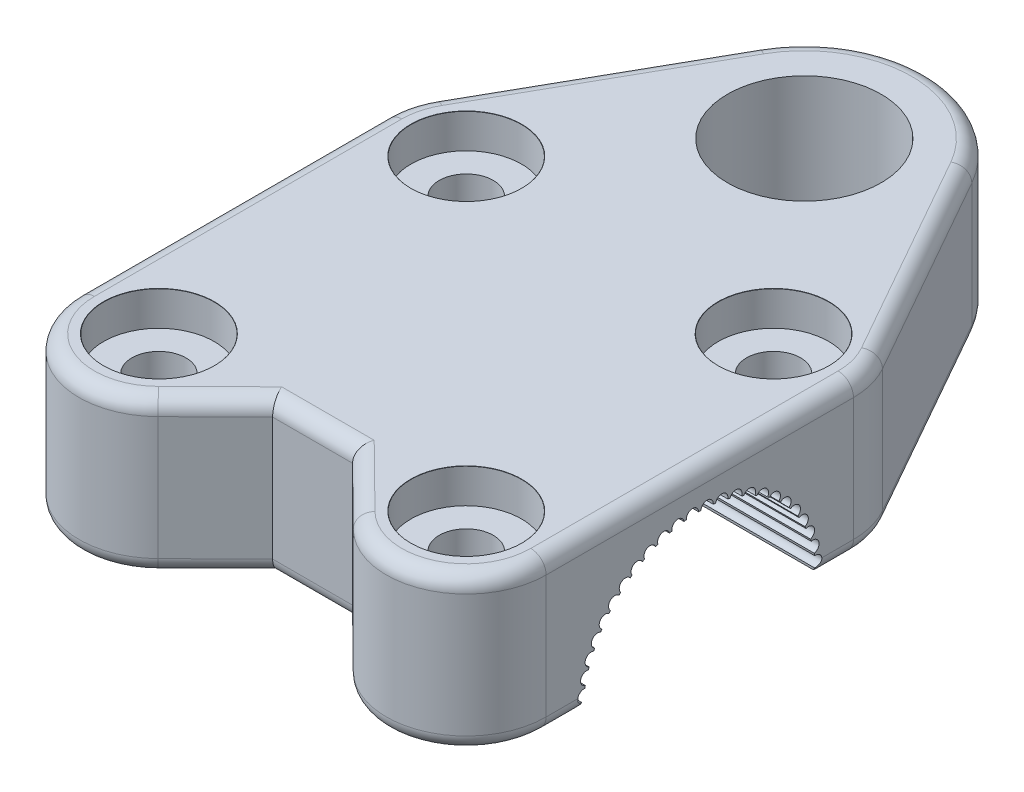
ISO-10303-21;
HEADER;
FILE_DESCRIPTION(('STEP AP214'),'2;1');
FILE_NAME('part.step','',(''),(''),'','','');
FILE_SCHEMA(('AUTOMOTIVE_DESIGN { 1 0 10303 214 1 1 1 1 }'));
ENDSEC;
DATA;
#1=APPLICATION_CONTEXT('core data for automotive mechanical design processes');
#2=APPLICATION_PROTOCOL_DEFINITION('international standard','automotive_design',2000,#1);
#3=PRODUCT_CONTEXT('',#1,'mechanical');
#4=PRODUCT('Part','Part','',(#3));
#5=PRODUCT_RELATED_PRODUCT_CATEGORY('part','',(#4));
#6=PRODUCT_DEFINITION_FORMATION('','',#4);
#7=PRODUCT_DEFINITION_CONTEXT('part definition',#1,'design');
#8=PRODUCT_DEFINITION('design','',#6,#7);
#9=PRODUCT_DEFINITION_SHAPE('','',#8);
#10=(LENGTH_UNIT() NAMED_UNIT(*) SI_UNIT(.MILLI.,.METRE.));
#11=(NAMED_UNIT(*) PLANE_ANGLE_UNIT() SI_UNIT($,.RADIAN.));
#12=(NAMED_UNIT(*) SI_UNIT($,.STERADIAN.) SOLID_ANGLE_UNIT());
#13=UNCERTAINTY_MEASURE_WITH_UNIT(LENGTH_MEASURE(1.E-05),#10,'distance_accuracy_value','');
#14=(GEOMETRIC_REPRESENTATION_CONTEXT(3) GLOBAL_UNCERTAINTY_ASSIGNED_CONTEXT((#13)) GLOBAL_UNIT_ASSIGNED_CONTEXT((#10,
#11,#12)) REPRESENTATION_CONTEXT('',''));
#15=CARTESIAN_POINT('',(0.,0.,0.));
#16=DIRECTION('',(0.,0.,1.));
#17=DIRECTION('',(1.,0.,0.));
#18=AXIS2_PLACEMENT_3D('',#15,#16,#17);
#19=CARTESIAN_POINT('',(-38.,0.,-25.));
#20=DIRECTION('',(1.,0.,0.));
#21=DIRECTION('',(0.,0.,-1.));
#22=AXIS2_PLACEMENT_3D('',#19,#20,#21);
#23=CYLINDRICAL_SURFACE('',#22,19.);
#24=CARTESIAN_POINT('',(-38.,0.,-25.));
#25=DIRECTION('',(1.,0.,0.));
#26=DIRECTION('',(0.,0.,-1.));
#27=AXIS2_PLACEMENT_3D('',#24,#25,#26);
#28=CIRCLE('',#27,19.);
#29=CARTESIAN_POINT('',(-38.,15.2566781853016,-36.3240350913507));
#30=VERTEX_POINT('',#29);
#31=CARTESIAN_POINT('',(-38.,15.4843702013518,-36.0106439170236));
#32=VERTEX_POINT('',#31);
#33=EDGE_CURVE('E1673',#30,#32,#28,.T.);
#34=ORIENTED_EDGE('',*,*,#33,.F.);
#35=DIRECTION('',(1.,0.,0.));
#36=VECTOR('',#35,1.);
#37=CARTESIAN_POINT('',(0.,15.2566781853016,-36.3240350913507));
#38=LINE('',#37,#36);
#39=CARTESIAN_POINT('',(38.,15.2566781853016,-36.3240350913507));
#40=VERTEX_POINT('',#39);
#41=EDGE_CURVE('E965',#30,#40,#38,.T.);
#42=ORIENTED_EDGE('',*,*,#41,.T.);
#43=CARTESIAN_POINT('',(38.,0.,-25.));
#44=DIRECTION('',(1.,0.,0.));
#45=DIRECTION('',(0.,0.,-1.));
#46=AXIS2_PLACEMENT_3D('',#43,#44,#45);
#47=CIRCLE('',#46,19.);
#48=CARTESIAN_POINT('',(38.,15.4843702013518,-36.0106439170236));
#49=VERTEX_POINT('',#48);
#50=EDGE_CURVE('E2692',#40,#49,#47,.T.);
#51=ORIENTED_EDGE('',*,*,#50,.T.);
#52=DIRECTION('',(1.,0.,0.));
#53=VECTOR('',#52,1.);
#54=CARTESIAN_POINT('',(0.,15.4843702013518,-36.0106439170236));
#55=LINE('',#54,#53);
#56=EDGE_CURVE('E945',#49,#32,#55,.F.);
#57=ORIENTED_EDGE('',*,*,#56,.T.);
#58=EDGE_LOOP('',(#34,#42,#51,#57));
#59=FACE_BOUND('',#58,.T.);
#60=ADVANCED_FACE('F39',(#59),#23,.F.);
#61=CARTESIAN_POINT('',(38.,13.717096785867,-38.1469105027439));
#62=VERTEX_POINT('',#61);
#63=CARTESIAN_POINT('',(38.,13.9822717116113,-37.8645278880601));
#64=VERTEX_POINT('',#63);
#65=EDGE_CURVE('E2696',#62,#64,#47,.T.);
#66=ORIENTED_EDGE('',*,*,#65,.T.);
#67=DIRECTION('',(1.,0.,0.));
#68=VECTOR('',#67,1.);
#69=CARTESIAN_POINT('',(0.,13.9822717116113,-37.8645278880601));
#70=LINE('',#69,#68);
#71=CARTESIAN_POINT('',(-38.,13.9822717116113,-37.8645278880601));
#72=VERTEX_POINT('',#71);
#73=EDGE_CURVE('E961',#64,#72,#70,.F.);
#74=ORIENTED_EDGE('',*,*,#73,.T.);
#75=CARTESIAN_POINT('',(-38.,13.717096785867,-38.1469105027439));
#76=VERTEX_POINT('',#75);
#77=EDGE_CURVE('E1669',#76,#72,#28,.T.);
#78=ORIENTED_EDGE('',*,*,#77,.F.);
#79=DIRECTION('',(1.,0.,0.));
#80=VECTOR('',#79,1.);
#81=CARTESIAN_POINT('',(0.,13.717096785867,-38.1469105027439));
#82=LINE('',#81,#80);
#83=EDGE_CURVE('E957',#76,#62,#82,.T.);
#84=ORIENTED_EDGE('',*,*,#83,.T.);
#85=EDGE_LOOP('',(#66,#74,#78,#84));
#86=FACE_BOUND('',#85,.T.);
#87=ADVANCED_FACE('F1419',(#86),#23,.F.);
#88=CARTESIAN_POINT('',(-38.,16.5556526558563,-34.3225728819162));
#89=VERTEX_POINT('',#88);
#90=CARTESIAN_POINT('',(-38.,16.7422709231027,-33.9831155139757));
#91=VERTEX_POINT('',#90);
#92=EDGE_CURVE('E1677',#89,#91,#28,.T.);
#93=ORIENTED_EDGE('',*,*,#92,.F.);
#94=DIRECTION('',(1.,0.,0.));
#95=VECTOR('',#94,1.);
#96=CARTESIAN_POINT('',(0.,16.5556526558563,-34.3225728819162));
#97=LINE('',#96,#95);
#98=CARTESIAN_POINT('',(38.,16.5556526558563,-34.3225728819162));
#99=VERTEX_POINT('',#98);
#100=EDGE_CURVE('E949',#89,#99,#97,.T.);
#101=ORIENTED_EDGE('',*,*,#100,.T.);
#102=CARTESIAN_POINT('',(38.,16.7422709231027,-33.9831155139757));
#103=VERTEX_POINT('',#102);
#104=EDGE_CURVE('E2688',#99,#103,#47,.T.);
#105=ORIENTED_EDGE('',*,*,#104,.T.);
#106=DIRECTION('',(1.,0.,0.));
#107=VECTOR('',#106,1.);
#108=CARTESIAN_POINT('',(0.,16.7422709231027,-33.9831155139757));
#109=LINE('',#108,#107);
#110=EDGE_CURVE('E937',#103,#91,#109,.F.);
#111=ORIENTED_EDGE('',*,*,#110,.T.);
#112=EDGE_LOOP('',(#93,#101,#105,#111));
#113=FACE_BOUND('',#112,.T.);
#114=ADVANCED_FACE('F1424',(#113),#23,.F.);
#115=CARTESIAN_POINT('',(-38.,17.5935345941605,-32.1740881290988));
#116=VERTEX_POINT('',#115);
#117=CARTESIAN_POINT('',(-38.,17.7361360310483,-31.8139180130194));
#118=VERTEX_POINT('',#117);
#119=EDGE_CURVE('E1680',#116,#118,#28,.T.);
#120=ORIENTED_EDGE('',*,*,#119,.F.);
#121=DIRECTION('',(1.,0.,0.));
#122=VECTOR('',#121,1.);
#123=CARTESIAN_POINT('',(0.,17.5935345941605,-32.1740881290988));
#124=LINE('',#123,#122);
#125=CARTESIAN_POINT('',(38.,17.5935345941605,-32.1740881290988));
#126=VERTEX_POINT('',#125);
#127=EDGE_CURVE('E941',#116,#126,#124,.T.);
#128=ORIENTED_EDGE('',*,*,#127,.T.);
#129=CARTESIAN_POINT('',(38.,17.7361360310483,-31.8139180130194));
#130=VERTEX_POINT('',#129);
#131=EDGE_CURVE('E2684',#126,#130,#47,.T.);
#132=ORIENTED_EDGE('',*,*,#131,.T.);
#133=DIRECTION('',(1.,0.,0.));
#134=VECTOR('',#133,1.);
#135=CARTESIAN_POINT('',(0.,17.7361360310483,-31.8139180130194));
#136=LINE('',#135,#134);
#137=EDGE_CURVE('E898',#130,#118,#136,.F.);
#138=ORIENTED_EDGE('',*,*,#137,.T.);
#139=EDGE_LOOP('',(#120,#128,#132,#138));
#140=FACE_BOUND('',#139,.T.);
#141=ADVANCED_FACE('F2466',(#140),#23,.F.);
#142=CARTESIAN_POINT('',(38.,11.9611885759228,-39.7624512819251));
#143=VERTEX_POINT('',#142);
#144=CARTESIAN_POINT('',(38.,12.2596644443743,-39.5155305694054));
#145=VERTEX_POINT('',#144);
#146=EDGE_CURVE('E2700',#143,#145,#47,.T.);
#147=ORIENTED_EDGE('',*,*,#146,.T.);
#148=DIRECTION('',(1.,0.,0.));
#149=VECTOR('',#148,1.);
#150=CARTESIAN_POINT('',(0.,12.2596644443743,-39.5155305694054));
#151=LINE('',#150,#149);
#152=CARTESIAN_POINT('',(-38.,12.2596644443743,-39.5155305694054));
#153=VERTEX_POINT('',#152);
#154=EDGE_CURVE('E953',#145,#153,#151,.F.);
#155=ORIENTED_EDGE('',*,*,#154,.T.);
#156=CARTESIAN_POINT('',(-38.,11.9611885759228,-39.7624512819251));
#157=VERTEX_POINT('',#156);
#158=EDGE_CURVE('E1665',#157,#153,#28,.T.);
#159=ORIENTED_EDGE('',*,*,#158,.F.);
#160=DIRECTION('',(1.,0.,0.));
#161=VECTOR('',#160,1.);
#162=CARTESIAN_POINT('',(0.,11.9611885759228,-39.7624512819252));
#163=LINE('',#162,#161);
#164=EDGE_CURVE('E933',#157,#143,#163,.T.);
#165=ORIENTED_EDGE('',*,*,#164,.T.);
#166=EDGE_LOOP('',(#147,#155,#159,#165));
#167=FACE_BOUND('',#166,.T.);
#168=ADVANCED_FACE('F2475',(#167),#23,.F.);
#169=CARTESIAN_POINT('',(38.,10.0166452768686,-41.1451793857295));
#170=VERTEX_POINT('',#169);
#171=CARTESIAN_POINT('',(38.,10.3437149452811,-40.9376146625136));
#172=VERTEX_POINT('',#171);
#173=EDGE_CURVE('E2704',#170,#172,#47,.T.);
#174=ORIENTED_EDGE('',*,*,#173,.T.);
#175=DIRECTION('',(1.,0.,0.));
#176=VECTOR('',#175,1.);
#177=CARTESIAN_POINT('',(0.,10.3437149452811,-40.9376146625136));
#178=LINE('',#177,#176);
#179=CARTESIAN_POINT('',(-38.,10.3437149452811,-40.9376146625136));
#180=VERTEX_POINT('',#179);
#181=EDGE_CURVE('E929',#172,#180,#178,.F.);
#182=ORIENTED_EDGE('',*,*,#181,.T.);
#183=CARTESIAN_POINT('',(-38.,10.0166452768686,-41.1451793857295));
#184=VERTEX_POINT('',#183);
#185=EDGE_CURVE('E1661',#184,#180,#28,.T.);
#186=ORIENTED_EDGE('',*,*,#185,.F.);
#187=DIRECTION('',(1.,0.,0.));
#188=VECTOR('',#187,1.);
#189=CARTESIAN_POINT('',(0.,10.0166452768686,-41.1451793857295));
#190=LINE('',#189,#188);
#191=EDGE_CURVE('E925',#184,#170,#190,.T.);
#192=ORIENTED_EDGE('',*,*,#191,.T.);
#193=EDGE_LOOP('',(#174,#182,#186,#192));
#194=FACE_BOUND('',#193,.T.);
#195=ADVANCED_FACE('F2484',(#194),#23,.F.);
#196=CARTESIAN_POINT('',(38.,7.91413349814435,-42.2732883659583));
#197=VERTEX_POINT('',#196);
#198=CARTESIAN_POINT('',(38.,8.26463888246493,-42.1083530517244));
#199=VERTEX_POINT('',#198);
#200=EDGE_CURVE('E572',#197,#199,#47,.T.);
#201=ORIENTED_EDGE('',*,*,#200,.T.);
#202=DIRECTION('',(1.,0.,0.));
#203=VECTOR('',#202,1.);
#204=CARTESIAN_POINT('',(0.,8.26463888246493,-42.1083530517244));
#205=LINE('',#204,#203);
#206=CARTESIAN_POINT('',(-38.,8.26463888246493,-42.1083530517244));
#207=VERTEX_POINT('',#206);
#208=EDGE_CURVE('E921',#199,#207,#205,.F.);
#209=ORIENTED_EDGE('',*,*,#208,.T.);
#210=CARTESIAN_POINT('',(-38.,7.91413349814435,-42.2732883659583));
#211=VERTEX_POINT('',#210);
#212=EDGE_CURVE('E1658',#211,#207,#28,.T.);
#213=ORIENTED_EDGE('',*,*,#212,.F.);
#214=DIRECTION('',(1.,0.,0.));
#215=VECTOR('',#214,1.);
#216=CARTESIAN_POINT('',(0.,7.91413349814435,-42.2732883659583));
#217=LINE('',#216,#215);
#218=EDGE_CURVE('E917',#211,#197,#217,.T.);
#219=ORIENTED_EDGE('',*,*,#218,.T.);
#220=EDGE_LOOP('',(#201,#209,#213,#219));
#221=FACE_BOUND('',#220,.T.);
#222=ADVANCED_FACE('F2493',(#221),#23,.F.);
#223=CARTESIAN_POINT('',(38.,5.68681110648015,-43.1289872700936));
#224=VERTEX_POINT('',#223);
#225=CARTESIAN_POINT('',(38.,6.05522452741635,-43.0092824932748));
#226=VERTEX_POINT('',#225);
#227=EDGE_CURVE('E563',#224,#226,#47,.T.);
#228=ORIENTED_EDGE('',*,*,#227,.T.);
#229=DIRECTION('',(1.,0.,0.));
#230=VECTOR('',#229,1.);
#231=CARTESIAN_POINT('',(0.,6.05522452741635,-43.0092824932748));
#232=LINE('',#231,#230);
#233=CARTESIAN_POINT('',(-38.,6.05522452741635,-43.0092824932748));
#234=VERTEX_POINT('',#233);
#235=EDGE_CURVE('E913',#226,#234,#232,.F.);
#236=ORIENTED_EDGE('',*,*,#235,.T.);
#237=CARTESIAN_POINT('',(-38.,5.68681110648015,-43.1289872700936));
#238=VERTEX_POINT('',#237);
#239=EDGE_CURVE('E1652',#238,#234,#28,.T.);
#240=ORIENTED_EDGE('',*,*,#239,.F.);
#241=DIRECTION('',(1.,0.,0.));
#242=VECTOR('',#241,1.);
#243=CARTESIAN_POINT('',(0.,5.68681110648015,-43.1289872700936));
#244=LINE('',#243,#242);
#245=EDGE_CURVE('E909',#238,#224,#244,.T.);
#246=ORIENTED_EDGE('',*,*,#245,.T.);
#247=EDGE_LOOP('',(#228,#236,#240,#246));
#248=FACE_BOUND('',#247,.T.);
#249=ADVANCED_FACE('F2502',(#248),#23,.F.);
#250=CARTESIAN_POINT('',(-38.,18.3539559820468,-29.912463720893));
#251=VERTEX_POINT('',#250);
#252=CARTESIAN_POINT('',(-38.,18.4502916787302,-29.5372609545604));
#253=VERTEX_POINT('',#252);
#254=EDGE_CURVE('E1684',#251,#253,#28,.T.);
#255=ORIENTED_EDGE('',*,*,#254,.F.);
#256=DIRECTION('',(1.,0.,0.));
#257=VECTOR('',#256,1.);
#258=CARTESIAN_POINT('',(0.,18.3539559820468,-29.912463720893));
#259=LINE('',#258,#257);
#260=CARTESIAN_POINT('',(38.,18.3539559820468,-29.912463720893));
#261=VERTEX_POINT('',#260);
#262=EDGE_CURVE('E902',#251,#261,#259,.T.);
#263=ORIENTED_EDGE('',*,*,#262,.T.);
#264=CARTESIAN_POINT('',(38.,18.4502916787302,-29.5372609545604));
#265=VERTEX_POINT('',#264);
#266=EDGE_CURVE('E2680',#261,#265,#47,.T.);
#267=ORIENTED_EDGE('',*,*,#266,.T.);
#268=DIRECTION('',(1.,0.,0.));
#269=VECTOR('',#268,1.);
#270=CARTESIAN_POINT('',(0.,18.4502916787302,-29.5372609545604));
#271=LINE('',#270,#269);
#272=EDGE_CURVE('E890',#265,#253,#271,.F.);
#273=ORIENTED_EDGE('',*,*,#272,.T.);
#274=EDGE_LOOP('',(#255,#263,#267,#273));
#275=FACE_BOUND('',#274,.T.);
#276=ADVANCED_FACE('F2511',(#275),#23,.F.);
#277=CARTESIAN_POINT('',(-38.,18.8249245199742,-27.5733668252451));
#278=VERTEX_POINT('',#277);
#279=CARTESIAN_POINT('',(-38.,18.8734752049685,-27.1890485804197));
#280=VERTEX_POINT('',#279);
#281=EDGE_CURVE('E1688',#278,#280,#28,.T.);
#282=ORIENTED_EDGE('',*,*,#281,.F.);
#283=DIRECTION('',(1.,0.,0.));
#284=VECTOR('',#283,1.);
#285=CARTESIAN_POINT('',(0.,18.8249245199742,-27.5733668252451));
#286=LINE('',#285,#284);
#287=CARTESIAN_POINT('',(38.,18.8249245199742,-27.5733668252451));
#288=VERTEX_POINT('',#287);
#289=EDGE_CURVE('E894',#278,#288,#286,.T.);
#290=ORIENTED_EDGE('',*,*,#289,.T.);
#291=CARTESIAN_POINT('',(38.,18.8734752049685,-27.1890485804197));
#292=VERTEX_POINT('',#291);
#293=EDGE_CURVE('E2676',#288,#292,#47,.T.);
#294=ORIENTED_EDGE('',*,*,#293,.T.);
#295=DIRECTION('',(1.,0.,0.));
#296=VECTOR('',#295,1.);
#297=CARTESIAN_POINT('',(0.,18.8734752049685,-27.1890485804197));
#298=LINE('',#297,#296);
#299=EDGE_CURVE('E882',#292,#280,#298,.F.);
#300=ORIENTED_EDGE('',*,*,#299,.T.);
#301=EDGE_LOOP('',(#282,#290,#294,#300));
#302=FACE_BOUND('',#301,.T.);
#303=ADVANCED_FACE('F2520',(#302),#23,.F.);
#304=CARTESIAN_POINT('',(-38.,18.9990127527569,-25.1936863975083));
#305=VERTEX_POINT('',#304);
#306=CARTESIAN_POINT('',(-38.,18.9990127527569,-24.8063136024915));
#307=VERTEX_POINT('',#306);
#308=EDGE_CURVE('E1692',#305,#307,#28,.T.);
#309=ORIENTED_EDGE('',*,*,#308,.F.);
#310=DIRECTION('',(1.,0.,0.));
#311=VECTOR('',#310,1.);
#312=CARTESIAN_POINT('',(0.,18.9990127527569,-25.1936863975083));
#313=LINE('',#312,#311);
#314=CARTESIAN_POINT('',(38.,18.9990127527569,-25.1936863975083));
#315=VERTEX_POINT('',#314);
#316=EDGE_CURVE('E886',#305,#315,#313,.T.);
#317=ORIENTED_EDGE('',*,*,#316,.T.);
#318=CARTESIAN_POINT('',(38.,18.9990127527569,-24.8063136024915));
#319=VERTEX_POINT('',#318);
#320=EDGE_CURVE('E2672',#315,#319,#47,.T.);
#321=ORIENTED_EDGE('',*,*,#320,.T.);
#322=DIRECTION('',(1.,0.,0.));
#323=VECTOR('',#322,1.);
#324=CARTESIAN_POINT('',(0.,18.9990127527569,-24.8063136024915));
#325=LINE('',#324,#323);
#326=EDGE_CURVE('E874',#319,#307,#325,.F.);
#327=ORIENTED_EDGE('',*,*,#326,.T.);
#328=EDGE_LOOP('',(#309,#317,#321,#327));
#329=FACE_BOUND('',#328,.T.);
#330=ADVANCED_FACE('F2529',(#329),#23,.F.);
#331=CARTESIAN_POINT('',(-38.,18.8734752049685,-22.8109514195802));
#332=VERTEX_POINT('',#331);
#333=CARTESIAN_POINT('',(-38.,18.8249245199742,-22.4266331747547));
#334=VERTEX_POINT('',#333);
#335=EDGE_CURVE('E1696',#332,#334,#28,.T.);
#336=ORIENTED_EDGE('',*,*,#335,.F.);
#337=DIRECTION('',(1.,0.,0.));
#338=VECTOR('',#337,1.);
#339=CARTESIAN_POINT('',(0.,18.8734752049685,-22.8109514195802));
#340=LINE('',#339,#338);
#341=CARTESIAN_POINT('',(38.,18.8734752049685,-22.8109514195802));
#342=VERTEX_POINT('',#341);
#343=EDGE_CURVE('E878',#332,#342,#340,.T.);
#344=ORIENTED_EDGE('',*,*,#343,.T.);
#345=CARTESIAN_POINT('',(38.,18.8249245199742,-22.4266331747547));
#346=VERTEX_POINT('',#345);
#347=EDGE_CURVE('E2668',#342,#346,#47,.T.);
#348=ORIENTED_EDGE('',*,*,#347,.T.);
#349=DIRECTION('',(1.,0.,0.));
#350=VECTOR('',#349,1.);
#351=CARTESIAN_POINT('',(0.,18.8249245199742,-22.4266331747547));
#352=LINE('',#351,#350);
#353=EDGE_CURVE('E866',#346,#334,#352,.F.);
#354=ORIENTED_EDGE('',*,*,#353,.T.);
#355=EDGE_LOOP('',(#336,#344,#348,#354));
#356=FACE_BOUND('',#355,.T.);
#357=ADVANCED_FACE('F2538',(#356),#23,.F.);
#358=CARTESIAN_POINT('',(-38.,18.4502916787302,-20.4627390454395));
#359=VERTEX_POINT('',#358);
#360=CARTESIAN_POINT('',(-38.,18.3539559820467,-20.0875362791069));
#361=VERTEX_POINT('',#360);
#362=EDGE_CURVE('E1700',#359,#361,#28,.T.);
#363=ORIENTED_EDGE('',*,*,#362,.F.);
#364=DIRECTION('',(1.,0.,0.));
#365=VECTOR('',#364,1.);
#366=CARTESIAN_POINT('',(0.,18.4502916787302,-20.4627390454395));
#367=LINE('',#366,#365);
#368=CARTESIAN_POINT('',(38.,18.4502916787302,-20.4627390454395));
#369=VERTEX_POINT('',#368);
#370=EDGE_CURVE('E870',#359,#369,#367,.T.);
#371=ORIENTED_EDGE('',*,*,#370,.T.);
#372=CARTESIAN_POINT('',(38.,18.3539559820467,-20.0875362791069));
#373=VERTEX_POINT('',#372);
#374=EDGE_CURVE('E2664',#369,#373,#47,.T.);
#375=ORIENTED_EDGE('',*,*,#374,.T.);
#376=DIRECTION('',(1.,0.,0.));
#377=VECTOR('',#376,1.);
#378=CARTESIAN_POINT('',(0.,18.3539559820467,-20.0875362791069));
#379=LINE('',#378,#377);
#380=EDGE_CURVE('E858',#373,#361,#379,.F.);
#381=ORIENTED_EDGE('',*,*,#380,.T.);
#382=EDGE_LOOP('',(#363,#371,#375,#381));
#383=FACE_BOUND('',#382,.T.);
#384=ADVANCED_FACE('F2547',(#383),#23,.F.);
#385=CARTESIAN_POINT('',(-38.,17.7361360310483,-18.1860819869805));
#386=VERTEX_POINT('',#385);
#387=CARTESIAN_POINT('',(-38.,17.5935345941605,-17.8259118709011));
#388=VERTEX_POINT('',#387);
#389=EDGE_CURVE('E1704',#386,#388,#28,.T.);
#390=ORIENTED_EDGE('',*,*,#389,.F.);
#391=DIRECTION('',(1.,0.,0.));
#392=VECTOR('',#391,1.);
#393=CARTESIAN_POINT('',(0.,17.7361360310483,-18.1860819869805));
#394=LINE('',#393,#392);
#395=CARTESIAN_POINT('',(38.,17.7361360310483,-18.1860819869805));
#396=VERTEX_POINT('',#395);
#397=EDGE_CURVE('E862',#386,#396,#394,.T.);
#398=ORIENTED_EDGE('',*,*,#397,.T.);
#399=CARTESIAN_POINT('',(38.,17.5935345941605,-17.8259118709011));
#400=VERTEX_POINT('',#399);
#401=EDGE_CURVE('E2661',#396,#400,#47,.T.);
#402=ORIENTED_EDGE('',*,*,#401,.T.);
#403=DIRECTION('',(1.,0.,0.));
#404=VECTOR('',#403,1.);
#405=CARTESIAN_POINT('',(0.,17.5935345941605,-17.8259118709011));
#406=LINE('',#405,#404);
#407=EDGE_CURVE('E850',#400,#388,#406,.F.);
#408=ORIENTED_EDGE('',*,*,#407,.T.);
#409=EDGE_LOOP('',(#390,#398,#402,#408));
#410=FACE_BOUND('',#409,.T.);
#411=ADVANCED_FACE('F2556',(#410),#23,.F.);
#412=CARTESIAN_POINT('',(-38.,16.7422709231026,-16.0168844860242));
#413=VERTEX_POINT('',#412);
#414=CARTESIAN_POINT('',(-38.,16.5556526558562,-15.6774271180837));
#415=VERTEX_POINT('',#414);
#416=EDGE_CURVE('E1708',#413,#415,#28,.T.);
#417=ORIENTED_EDGE('',*,*,#416,.F.);
#418=DIRECTION('',(1.,0.,0.));
#419=VECTOR('',#418,1.);
#420=CARTESIAN_POINT('',(0.,16.7422709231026,-16.0168844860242));
#421=LINE('',#420,#419);
#422=CARTESIAN_POINT('',(38.,16.7422709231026,-16.0168844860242));
#423=VERTEX_POINT('',#422);
#424=EDGE_CURVE('E854',#413,#423,#421,.T.);
#425=ORIENTED_EDGE('',*,*,#424,.T.);
#426=CARTESIAN_POINT('',(38.,16.5556526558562,-15.6774271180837));
#427=VERTEX_POINT('',#426);
#428=EDGE_CURVE('E2659',#423,#427,#47,.T.);
#429=ORIENTED_EDGE('',*,*,#428,.T.);
#430=DIRECTION('',(1.,0.,0.));
#431=VECTOR('',#430,1.);
#432=CARTESIAN_POINT('',(0.,16.5556526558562,-15.6774271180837));
#433=LINE('',#432,#431);
#434=EDGE_CURVE('E842',#427,#415,#433,.F.);
#435=ORIENTED_EDGE('',*,*,#434,.T.);
#436=EDGE_LOOP('',(#417,#425,#429,#435));
#437=FACE_BOUND('',#436,.T.);
#438=ADVANCED_FACE('F2565',(#437),#23,.F.);
#439=CARTESIAN_POINT('',(-38.,15.4843702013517,-13.9893560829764));
#440=VERTEX_POINT('',#439);
#441=CARTESIAN_POINT('',(-38.,15.2566781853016,-13.6759649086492));
#442=VERTEX_POINT('',#441);
#443=EDGE_CURVE('E1712',#440,#442,#28,.T.);
#444=ORIENTED_EDGE('',*,*,#443,.F.);
#445=DIRECTION('',(1.,0.,0.));
#446=VECTOR('',#445,1.);
#447=CARTESIAN_POINT('',(0.,15.4843702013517,-13.9893560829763));
#448=LINE('',#447,#446);
#449=CARTESIAN_POINT('',(38.,15.4843702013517,-13.9893560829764));
#450=VERTEX_POINT('',#449);
#451=EDGE_CURVE('E846',#440,#450,#448,.T.);
#452=ORIENTED_EDGE('',*,*,#451,.T.);
#453=CARTESIAN_POINT('',(38.,15.2566781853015,-13.6759649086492));
#454=VERTEX_POINT('',#453);
#455=EDGE_CURVE('E1738',#450,#454,#47,.T.);
#456=ORIENTED_EDGE('',*,*,#455,.T.);
#457=DIRECTION('',(1.,0.,0.));
#458=VECTOR('',#457,1.);
#459=CARTESIAN_POINT('',(0.,15.2566781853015,-13.6759649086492));
#460=LINE('',#459,#458);
#461=EDGE_CURVE('E823',#454,#442,#460,.F.);
#462=ORIENTED_EDGE('',*,*,#461,.T.);
#463=EDGE_LOOP('',(#444,#452,#456,#462));
#464=FACE_BOUND('',#463,.T.);
#465=ADVANCED_FACE('F2574',(#464),#23,.F.);
#466=CARTESIAN_POINT('',(-38.,8.26463888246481,-7.89164694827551));
#467=VERTEX_POINT('',#466);
#468=CARTESIAN_POINT('',(-38.,7.91413349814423,-7.72671163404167));
#469=VERTEX_POINT('',#468);
#470=EDGE_CURVE('E778',#467,#469,#28,.T.);
#471=ORIENTED_EDGE('',*,*,#470,.F.);
#472=DIRECTION('',(1.,0.,0.));
#473=VECTOR('',#472,1.);
#474=CARTESIAN_POINT('',(0.,8.26463888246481,-7.89164694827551));
#475=LINE('',#474,#473);
#476=CARTESIAN_POINT('',(38.,8.26463888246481,-7.89164694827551));
#477=VERTEX_POINT('',#476);
#478=EDGE_CURVE('E838',#467,#477,#475,.T.);
#479=ORIENTED_EDGE('',*,*,#478,.T.);
#480=CARTESIAN_POINT('',(38.,7.91413349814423,-7.72671163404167));
#481=VERTEX_POINT('',#480);
#482=EDGE_CURVE('E585',#477,#481,#47,.T.);
#483=ORIENTED_EDGE('',*,*,#482,.T.);
#484=DIRECTION('',(1.,0.,0.));
#485=VECTOR('',#484,1.);
#486=CARTESIAN_POINT('',(0.,7.91413349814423,-7.72671163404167));
#487=LINE('',#486,#485);
#488=EDGE_CURVE('E803',#481,#469,#487,.F.);
#489=ORIENTED_EDGE('',*,*,#488,.T.);
#490=EDGE_LOOP('',(#471,#479,#483,#489));
#491=FACE_BOUND('',#490,.T.);
#492=ADVANCED_FACE('F1743',(#491),#23,.F.);
#493=CARTESIAN_POINT('',(38.,10.343714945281,-9.06238533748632));
#494=VERTEX_POINT('',#493);
#495=CARTESIAN_POINT('',(38.,10.0166452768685,-8.85482061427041));
#496=VERTEX_POINT('',#495);
#497=EDGE_CURVE('E1735',#494,#496,#47,.T.);
#498=ORIENTED_EDGE('',*,*,#497,.T.);
#499=DIRECTION('',(1.,0.,0.));
#500=VECTOR('',#499,1.);
#501=CARTESIAN_POINT('',(0.,10.0166452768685,-8.85482061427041));
#502=LINE('',#501,#500);
#503=CARTESIAN_POINT('',(-38.,10.0166452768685,-8.85482061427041));
#504=VERTEX_POINT('',#503);
#505=EDGE_CURVE('E776',#496,#504,#502,.F.);
#506=ORIENTED_EDGE('',*,*,#505,.T.);
#507=CARTESIAN_POINT('',(-38.,10.343714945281,-9.06238533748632));
#508=VERTEX_POINT('',#507);
#509=EDGE_CURVE('E764',#508,#504,#28,.T.);
#510=ORIENTED_EDGE('',*,*,#509,.F.);
#511=DIRECTION('',(1.,0.,0.));
#512=VECTOR('',#511,1.);
#513=CARTESIAN_POINT('',(0.,10.343714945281,-9.06238533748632));
#514=LINE('',#513,#512);
#515=EDGE_CURVE('E774',#508,#494,#514,.T.);
#516=ORIENTED_EDGE('',*,*,#515,.T.);
#517=EDGE_LOOP('',(#498,#506,#510,#516));
#518=FACE_BOUND('',#517,.T.);
#519=ADVANCED_FACE('F773',(#518),#23,.F.);
#520=CARTESIAN_POINT('',(-38.,13.9822717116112,-12.1354721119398));
#521=VERTEX_POINT('',#520);
#522=CARTESIAN_POINT('',(-38.,13.7170967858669,-11.853089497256));
#523=VERTEX_POINT('',#522);
#524=EDGE_CURVE('E781',#521,#523,#28,.T.);
#525=ORIENTED_EDGE('',*,*,#524,.F.);
#526=DIRECTION('',(1.,0.,0.));
#527=VECTOR('',#526,1.);
#528=CARTESIAN_POINT('',(0.,13.9822717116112,-12.1354721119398));
#529=LINE('',#528,#527);
#530=CARTESIAN_POINT('',(38.,13.9822717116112,-12.1354721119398));
#531=VERTEX_POINT('',#530);
#532=EDGE_CURVE('E827',#521,#531,#529,.T.);
#533=ORIENTED_EDGE('',*,*,#532,.T.);
#534=CARTESIAN_POINT('',(38.,13.7170967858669,-11.853089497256));
#535=VERTEX_POINT('',#534);
#536=EDGE_CURVE('E1724',#531,#535,#47,.T.);
#537=ORIENTED_EDGE('',*,*,#536,.T.);
#538=DIRECTION('',(1.,0.,0.));
#539=VECTOR('',#538,1.);
#540=CARTESIAN_POINT('',(0.,13.7170967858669,-11.853089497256));
#541=LINE('',#540,#539);
#542=EDGE_CURVE('E815',#535,#523,#541,.F.);
#543=ORIENTED_EDGE('',*,*,#542,.T.);
#544=EDGE_LOOP('',(#525,#533,#537,#543));
#545=FACE_BOUND('',#544,.T.);
#546=ADVANCED_FACE('F1721',(#545),#23,.F.);
#547=CARTESIAN_POINT('',(38.,12.2596644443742,-10.4844694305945));
#548=VERTEX_POINT('',#547);
#549=CARTESIAN_POINT('',(38.,11.9611885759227,-10.2375487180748));
#550=VERTEX_POINT('',#549);
#551=EDGE_CURVE('E1732',#548,#550,#47,.T.);
#552=ORIENTED_EDGE('',*,*,#551,.T.);
#553=DIRECTION('',(1.,0.,0.));
#554=VECTOR('',#553,1.);
#555=CARTESIAN_POINT('',(0.,11.9611885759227,-10.2375487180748));
#556=LINE('',#555,#554);
#557=CARTESIAN_POINT('',(-38.,11.9611885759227,-10.2375487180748));
#558=VERTEX_POINT('',#557);
#559=EDGE_CURVE('E831',#550,#558,#556,.F.);
#560=ORIENTED_EDGE('',*,*,#559,.T.);
#561=CARTESIAN_POINT('',(-38.,12.2596644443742,-10.4844694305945));
#562=VERTEX_POINT('',#561);
#563=EDGE_CURVE('E766',#562,#558,#28,.T.);
#564=ORIENTED_EDGE('',*,*,#563,.F.);
#565=DIRECTION('',(1.,0.,0.));
#566=VECTOR('',#565,1.);
#567=CARTESIAN_POINT('',(0.,12.2596644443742,-10.4844694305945));
#568=LINE('',#567,#566);
#569=EDGE_CURVE('E819',#562,#548,#568,.T.);
#570=ORIENTED_EDGE('',*,*,#569,.T.);
#571=EDGE_LOOP('',(#552,#560,#564,#570));
#572=FACE_BOUND('',#571,.T.);
#573=ADVANCED_FACE('F2605',(#572),#23,.F.);
#574=CARTESIAN_POINT('',(-38.,6.05522452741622,-6.99071750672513));
#575=VERTEX_POINT('',#574);
#576=CARTESIAN_POINT('',(-38.,5.68681110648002,-6.87101272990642));
#577=VERTEX_POINT('',#576);
#578=EDGE_CURVE('E569',#575,#577,#28,.T.);
#579=ORIENTED_EDGE('',*,*,#578,.F.);
#580=DIRECTION('',(1.,0.,0.));
#581=VECTOR('',#580,1.);
#582=CARTESIAN_POINT('',(0.,6.05522452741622,-6.99071750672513));
#583=LINE('',#582,#581);
#584=CARTESIAN_POINT('',(38.,6.05522452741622,-6.99071750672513));
#585=VERTEX_POINT('',#584);
#586=EDGE_CURVE('E792',#575,#585,#583,.T.);
#587=ORIENTED_EDGE('',*,*,#586,.T.);
#588=CARTESIAN_POINT('',(38.,5.68681110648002,-6.87101272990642));
#589=VERTEX_POINT('',#588);
#590=EDGE_CURVE('E576',#585,#589,#47,.T.);
#591=ORIENTED_EDGE('',*,*,#590,.T.);
#592=DIRECTION('',(1.,0.,0.));
#593=VECTOR('',#592,1.);
#594=CARTESIAN_POINT('',(0.,5.68681110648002,-6.87101272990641));
#595=LINE('',#594,#593);
#596=EDGE_CURVE('E794',#589,#577,#595,.F.);
#597=ORIENTED_EDGE('',*,*,#596,.T.);
#598=EDGE_LOOP('',(#579,#587,#591,#597));
#599=FACE_BOUND('',#598,.T.);
#600=ADVANCED_FACE('F791',(#599),#23,.F.);
#601=CARTESIAN_POINT('',(-38.,3.75031566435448,-6.37380520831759));
#602=VERTEX_POINT('',#601);
#603=CARTESIAN_POINT('',(-38.,3.36980430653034,-6.30121878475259));
#604=VERTEX_POINT('',#603);
#605=EDGE_CURVE('E562',#602,#604,#28,.T.);
#606=ORIENTED_EDGE('',*,*,#605,.F.);
#607=DIRECTION('',(1.,0.,0.));
#608=VECTOR('',#607,1.);
#609=CARTESIAN_POINT('',(0.,3.75031566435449,-6.37380520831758));
#610=LINE('',#609,#608);
#611=CARTESIAN_POINT('',(38.,3.75031566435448,-6.37380520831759));
#612=VERTEX_POINT('',#611);
#613=EDGE_CURVE('E798',#602,#612,#610,.T.);
#614=ORIENTED_EDGE('',*,*,#613,.T.);
#615=CARTESIAN_POINT('',(38.,3.36980430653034,-6.30121878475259));
#616=VERTEX_POINT('',#615);
#617=EDGE_CURVE('E565',#612,#616,#47,.T.);
#618=ORIENTED_EDGE('',*,*,#617,.T.);
#619=DIRECTION('',(1.,0.,0.));
#620=VECTOR('',#619,1.);
#621=CARTESIAN_POINT('',(0.,3.36980430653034,-6.30121878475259));
#622=LINE('',#621,#620);
#623=EDGE_CURVE('E806',#616,#604,#622,.F.);
#624=ORIENTED_EDGE('',*,*,#623,.T.);
#625=EDGE_LOOP('',(#606,#614,#618,#624));
#626=FACE_BOUND('',#625,.T.);
#627=ADVANCED_FACE('F1084',(#626),#23,.F.);
#628=DIRECTION('',(1.,0.,0.));
#629=VECTOR('',#628,1.);
#630=CARTESIAN_POINT('',(0.,1.38626208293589,-6.05063912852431));
#631=LINE('',#630,#629);
#632=CARTESIAN_POINT('',(-37.7382108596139,1.38626208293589,-6.05063912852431));
#633=VERTEX_POINT('',#632);
#634=CARTESIAN_POINT('',(37.7382108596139,1.38626208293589,-6.05063912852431));
#635=VERTEX_POINT('',#634);
#636=EDGE_CURVE('E799',#633,#635,#631,.T.);
#637=ORIENTED_EDGE('',*,*,#636,.T.);
#638=CARTESIAN_POINT('',(37.7382108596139,1.38626208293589,-6.05063912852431));
#639=CARTESIAN_POINT('',(37.7213186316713,1.35231334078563,-6.04815537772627));
#640=CARTESIAN_POINT('',(37.7036493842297,1.3187425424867,-6.0457913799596));
#641=CARTESIAN_POINT('',(37.666833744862,1.25249702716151,-6.04129885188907));
#642=CARTESIAN_POINT('',(37.6476905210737,1.2198205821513,-6.03916983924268));
#643=CARTESIAN_POINT('',(37.6079328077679,1.15536131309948,-6.03513292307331));
#644=CARTESIAN_POINT('',(37.5873183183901,1.12357848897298,-6.03322501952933));
#645=CARTESIAN_POINT('',(37.5446164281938,1.06090819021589,-6.02961617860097));
#646=CARTESIAN_POINT('',(37.5225260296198,1.0300227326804,-6.02791568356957));
#647=CARTESIAN_POINT('',(37.4997402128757,0.999653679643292,-6.02631578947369));
#648=B_SPLINE_CURVE_WITH_KNOTS('',3,(#638,#639,#640,#641,#642,#643,#644,#645,#646,#647),
.UNSPECIFIED.,.F.,.F.,(4,2,2,2,4),(0.,0.113991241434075,0.227743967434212,0.341496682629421,
0.455487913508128),.UNSPECIFIED.);
#649=CARTESIAN_POINT('',(37.4997402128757,0.999653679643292,-6.02631578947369));
#650=VERTEX_POINT('',#649);
#651=EDGE_CURVE('E1449',#635,#650,#648,.T.);
#652=ORIENTED_EDGE('',*,*,#651,.T.);
#653=DIRECTION('',(1.,0.,0.));
#654=VECTOR('',#653,1.);
#655=CARTESIAN_POINT('',(0.,0.999653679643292,-6.02631578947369));
#656=LINE('',#655,#654);
#657=CARTESIAN_POINT('',(-37.4997402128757,0.999653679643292,-6.02631578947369));
#658=VERTEX_POINT('',#657);
#659=EDGE_CURVE('E553',#650,#658,#656,.F.);
#660=ORIENTED_EDGE('',*,*,#659,.T.);
#661=CARTESIAN_POINT('',(-37.4997402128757,0.999653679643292,-6.02631578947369));
#662=CARTESIAN_POINT('',(-37.5225260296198,1.0300227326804,-6.02791568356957));
#663=CARTESIAN_POINT('',(-37.5446164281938,1.06090819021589,-6.02961617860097));
#664=CARTESIAN_POINT('',(-37.5873183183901,1.12357848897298,-6.03322501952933));
#665=CARTESIAN_POINT('',(-37.6079328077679,1.15536131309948,-6.03513292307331));
#666=CARTESIAN_POINT('',(-37.6476905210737,1.2198205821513,-6.03916983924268));
#667=CARTESIAN_POINT('',(-37.666833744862,1.2524970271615,-6.04129885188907));
#668=CARTESIAN_POINT('',(-37.7036493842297,1.31874254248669,-6.0457913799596));
#669=CARTESIAN_POINT('',(-37.7213186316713,1.35231334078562,-6.04815537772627));
#670=CARTESIAN_POINT('',(-37.7382108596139,1.3862620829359,-6.05063912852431));
#671=B_SPLINE_CURVE_WITH_KNOTS('',3,(#661,#662,#663,#664,#665,#666,#667,#668,#669,#670),
.UNSPECIFIED.,.F.,.F.,(4,2,2,2,4),(0.,0.113991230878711,0.227743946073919,0.341496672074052,
0.455487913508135),.UNSPECIFIED.);
#672=EDGE_CURVE('E1451',#658,#633,#671,.T.);
#673=ORIENTED_EDGE('',*,*,#672,.T.);
#674=EDGE_LOOP('',(#637,#652,#660,#673));
#675=FACE_BOUND('',#674,.T.);
#676=ADVANCED_FACE('F1436',(#675),#23,.F.);
#677=CARTESIAN_POINT('',(38.,3.36980430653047,-43.6987812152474));
#678=VERTEX_POINT('',#677);
#679=CARTESIAN_POINT('',(38.,3.75031566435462,-43.6261947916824));
#680=VERTEX_POINT('',#679);
#681=EDGE_CURVE('E549',#678,#680,#47,.T.);
#682=ORIENTED_EDGE('',*,*,#681,.T.);
#683=DIRECTION('',(1.,0.,0.));
#684=VECTOR('',#683,1.);
#685=CARTESIAN_POINT('',(0.,3.75031566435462,-43.6261947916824));
#686=LINE('',#685,#684);
#687=CARTESIAN_POINT('',(-38.,3.75031566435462,-43.6261947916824));
#688=VERTEX_POINT('',#687);
#689=EDGE_CURVE('E906',#680,#688,#686,.F.);
#690=ORIENTED_EDGE('',*,*,#689,.T.);
#691=CARTESIAN_POINT('',(-38.,3.36980430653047,-43.6987812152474));
#692=VERTEX_POINT('',#691);
#693=EDGE_CURVE('E551',#692,#688,#28,.T.);
#694=ORIENTED_EDGE('',*,*,#693,.F.);
#695=DIRECTION('',(1.,0.,0.));
#696=VECTOR('',#695,1.);
#697=CARTESIAN_POINT('',(0.,3.36980430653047,-43.6987812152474));
#698=LINE('',#697,#696);
#699=EDGE_CURVE('E533',#692,#678,#698,.T.);
#700=ORIENTED_EDGE('',*,*,#699,.T.);
#701=EDGE_LOOP('',(#682,#690,#694,#700));
#702=FACE_BOUND('',#701,.T.);
#703=ADVANCED_FACE('F547',(#702),#23,.F.);
#704=CARTESIAN_POINT('',(25.,0.,0.));
#705=DIRECTION('',(0.,1.,0.));
#706=DIRECTION('',(0.,0.,1.));
#707=AXIS2_PLACEMENT_3D('',#704,#705,#706);
#708=PLANE('',#707);
#709=DIRECTION('',(1.,0.,0.));
#710=VECTOR('',#709,1.);
#711=CARTESIAN_POINT('',(-38.,0.,-5.00000000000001));
#712=LINE('',#711,#710);
#713=CARTESIAN_POINT('',(-35.5,0.,-5.00000000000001));
#714=VERTEX_POINT('',#713);
#715=CARTESIAN_POINT('',(35.5,0.,-5.00000000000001));
#716=VERTEX_POINT('',#715);
#717=EDGE_CURVE('E587',#714,#716,#712,.T.);
#718=ORIENTED_EDGE('',*,*,#717,.T.);
#719=DIRECTION('',(0.,0.,-1.));
#720=VECTOR('',#719,1.);
#721=CARTESIAN_POINT('',(35.5,0.,0.));
#722=LINE('',#721,#720);
#723=CARTESIAN_POINT('',(35.5,0.,0.));
#724=VERTEX_POINT('',#723);
#725=EDGE_CURVE('E1490',#716,#724,#722,.F.);
#726=ORIENTED_EDGE('',*,*,#725,.T.);
#727=CARTESIAN_POINT('',(25.,0.,0.));
#728=DIRECTION('',(0.,1.,0.));
#729=DIRECTION('',(0.,0.,1.));
#730=AXIS2_PLACEMENT_3D('',#727,#728,#729);
#731=CIRCLE('',#730,10.5);
#732=CARTESIAN_POINT('',(17.6216216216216,0.,7.47057778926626));
#733=VERTEX_POINT('',#732);
#734=EDGE_CURVE('E1184',#724,#733,#731,.F.);
#735=ORIENTED_EDGE('',*,*,#734,.T.);
#736=DIRECTION('',(0.71148359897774,0.,0.702702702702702));
#737=VECTOR('',#736,1.);
#738=CARTESIAN_POINT('',(17.6216216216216,0.,7.47057778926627));
#739=LINE('',#738,#737);
#740=CARTESIAN_POINT('',(7.52645258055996,0.,-2.5));
#741=VERTEX_POINT('',#740);
#742=EDGE_CURVE('E1495',#733,#741,#739,.F.);
#743=ORIENTED_EDGE('',*,*,#742,.T.);
#744=DIRECTION('',(1.,0.,0.));
#745=VECTOR('',#744,1.);
#746=CARTESIAN_POINT('',(25.,0.,-2.50000000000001));
#747=LINE('',#746,#745);
#748=CARTESIAN_POINT('',(-7.52645258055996,0.,-2.5));
#749=VERTEX_POINT('',#748);
#750=EDGE_CURVE('E1498',#741,#749,#747,.F.);
#751=ORIENTED_EDGE('',*,*,#750,.T.);
#752=DIRECTION('',(0.71148359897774,0.,-0.702702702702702));
#753=VECTOR('',#752,1.);
#754=CARTESIAN_POINT('',(7.68882395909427,0.,-17.5274946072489));
#755=LINE('',#754,#753);
#756=CARTESIAN_POINT('',(-17.6216216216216,0.,7.47057778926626));
#757=VERTEX_POINT('',#756);
#758=EDGE_CURVE('E1503',#749,#757,#755,.F.);
#759=ORIENTED_EDGE('',*,*,#758,.T.);
#760=CARTESIAN_POINT('',(-25.,0.,0.));
#761=DIRECTION('',(0.,1.,0.));
#762=DIRECTION('',(0.,0.,1.));
#763=AXIS2_PLACEMENT_3D('',#760,#761,#762);
#764=CIRCLE('',#763,10.5);
#765=CARTESIAN_POINT('',(-35.5,0.,0.));
#766=VERTEX_POINT('',#765);
#767=EDGE_CURVE('E1506',#757,#766,#764,.F.);
#768=ORIENTED_EDGE('',*,*,#767,.T.);
#769=DIRECTION('',(0.,0.,1.));
#770=VECTOR('',#769,1.);
#771=CARTESIAN_POINT('',(-35.5,0.,0.));
#772=LINE('',#771,#770);
#773=EDGE_CURVE('E1100',#766,#714,#772,.F.);
#774=ORIENTED_EDGE('',*,*,#773,.T.);
#775=EDGE_LOOP('',(#718,#726,#735,#743,#751,#759,#768,#774));
#776=FACE_BOUND('',#775,.T.);
#777=CARTESIAN_POINT('',(-25.,0.,0.));
#778=DIRECTION('',(0.,1.,0.));
#779=DIRECTION('',(0.,0.,1.));
#780=AXIS2_PLACEMENT_3D('',#777,#778,#779);
#781=CIRCLE('',#780,4.39999999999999);
#782=CARTESIAN_POINT('',(-25.,0.,4.39999999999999));
#783=VERTEX_POINT('',#782);
#784=EDGE_CURVE('E2235',#783,#783,#781,.T.);
#785=ORIENTED_EDGE('',*,*,#784,.T.);
#786=EDGE_LOOP('',(#785));
#787=FACE_BOUND('',#786,.T.);
#788=CARTESIAN_POINT('',(25.,0.,0.));
#789=DIRECTION('',(0.,1.,0.));
#790=DIRECTION('',(0.,0.,1.));
#791=AXIS2_PLACEMENT_3D('',#788,#789,#790);
#792=CIRCLE('',#791,4.39999999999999);
#793=CARTESIAN_POINT('',(25.,0.,4.39999999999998));
#794=VERTEX_POINT('',#793);
#795=EDGE_CURVE('E2238',#794,#794,#792,.T.);
#796=ORIENTED_EDGE('',*,*,#795,.T.);
#797=EDGE_LOOP('',(#796));
#798=FACE_BOUND('',#797,.T.);
#799=ADVANCED_FACE('F1435',(#776,#787,#798),#708,.F.);
#800=CARTESIAN_POINT('',(6.5,25.,0.));
#801=DIRECTION('',(0.702702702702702,0.,-0.71148359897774));
#802=DIRECTION('',(-0.71148359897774,0.,-0.702702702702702));
#803=AXIS2_PLACEMENT_3D('',#800,#801,#802);
#804=PLANE('',#803);
#805=DIRECTION('',(0.,-1.,0.));
#806=VECTOR('',#805,1.);
#807=CARTESIAN_POINT('',(6.5,25.,0.));
#808=LINE('',#807,#806);
#809=CARTESIAN_POINT('',(6.5,22.5,0.));
#810=VERTEX_POINT('',#809);
#811=CARTESIAN_POINT('',(6.5,2.5,0.));
#812=VERTEX_POINT('',#811);
#813=EDGE_CURVE('E1132',#810,#812,#808,.T.);
#814=ORIENTED_EDGE('',*,*,#813,.T.);
#815=DIRECTION('',(0.71148359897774,0.,0.702702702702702));
#816=VECTOR('',#815,1.);
#817=CARTESIAN_POINT('',(6.5,2.5,0.));
#818=LINE('',#817,#816);
#819=CARTESIAN_POINT('',(15.8648648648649,2.5,9.24928678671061));
#820=VERTEX_POINT('',#819);
#821=EDGE_CURVE('E1509',#812,#820,#818,.T.);
#822=ORIENTED_EDGE('',*,*,#821,.T.);
#823=DIRECTION('',(0.,-1.,0.));
#824=VECTOR('',#823,1.);
#825=CARTESIAN_POINT('',(15.8648648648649,25.,9.24928678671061));
#826=LINE('',#825,#824);
#827=CARTESIAN_POINT('',(15.8648648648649,22.5,9.24928678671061));
#828=VERTEX_POINT('',#827);
#829=EDGE_CURVE('E1073',#828,#820,#826,.T.);
#830=ORIENTED_EDGE('',*,*,#829,.F.);
#831=DIRECTION('',(0.71148359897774,0.,0.702702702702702));
#832=VECTOR('',#831,1.);
#833=CARTESIAN_POINT('',(6.5,22.5,0.));
#834=LINE('',#833,#832);
#835=EDGE_CURVE('E1512',#828,#810,#834,.F.);
#836=ORIENTED_EDGE('',*,*,#835,.T.);
#837=EDGE_LOOP('',(#814,#822,#830,#836));
#838=FACE_BOUND('',#837,.T.);
#839=ADVANCED_FACE('F1040',(#838),#804,.F.);
#840=CARTESIAN_POINT('',(25.,25.,0.));
#841=DIRECTION('',(0.,-1.,0.));
#842=DIRECTION('',(0.,0.,-1.));
#843=AXIS2_PLACEMENT_3D('',#840,#841,#842);
#844=CYLINDRICAL_SURFACE('',#843,13.);
#845=DIRECTION('',(0.,-1.,0.));
#846=VECTOR('',#845,1.);
#847=CARTESIAN_POINT('',(38.,25.,0.));
#848=LINE('',#847,#846);
#849=CARTESIAN_POINT('',(38.,22.5,0.));
#850=VERTEX_POINT('',#849);
#851=CARTESIAN_POINT('',(38.,2.5,0.));
#852=VERTEX_POINT('',#851);
#853=EDGE_CURVE('E1077',#850,#852,#848,.T.);
#854=ORIENTED_EDGE('',*,*,#853,.F.);
#855=CARTESIAN_POINT('',(25.,22.5,0.));
#856=DIRECTION('',(0.,1.,0.));
#857=DIRECTION('',(0.,0.,1.));
#858=AXIS2_PLACEMENT_3D('',#855,#856,#857);
#859=CIRCLE('',#858,13.);
#860=EDGE_CURVE('E1283',#850,#828,#859,.F.);
#861=ORIENTED_EDGE('',*,*,#860,.T.);
#862=ORIENTED_EDGE('',*,*,#829,.T.);
#863=CARTESIAN_POINT('',(25.,2.5,0.));
#864=DIRECTION('',(0.,1.,0.));
#865=DIRECTION('',(0.,0.,1.));
#866=AXIS2_PLACEMENT_3D('',#863,#864,#865);
#867=CIRCLE('',#866,13.);
#868=EDGE_CURVE('E1182',#820,#852,#867,.T.);
#869=ORIENTED_EDGE('',*,*,#868,.T.);
#870=EDGE_LOOP('',(#854,#861,#862,#869));
#871=FACE_BOUND('',#870,.T.);
#872=ADVANCED_FACE('F1595',(#871),#844,.T.);
#873=CARTESIAN_POINT('',(38.,25.,0.));
#874=DIRECTION('',(-1.,0.,0.));
#875=DIRECTION('',(0.,0.,1.));
#876=AXIS2_PLACEMENT_3D('',#873,#874,#875);
#877=PLANE('',#876);
#878=ORIENTED_EDGE('',*,*,#853,.T.);
#879=DIRECTION('',(0.,0.,-1.));
#880=VECTOR('',#879,1.);
#881=CARTESIAN_POINT('',(38.,2.5,0.));
#882=LINE('',#881,#880);
#883=CARTESIAN_POINT('',(38.,2.5,-5.1568867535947));
#884=VERTEX_POINT('',#883);
#885=EDGE_CURVE('E1160',#852,#884,#882,.T.);
#886=ORIENTED_EDGE('',*,*,#885,.T.);
#887=CARTESIAN_POINT('',(38.,2.38133143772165,-6.14982067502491));
#888=DIRECTION('',(1.,0.,0.));
#889=DIRECTION('',(0.,0.125333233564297,0.992114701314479));
#890=AXIS2_PLACEMENT_3D('',#887,#888,#889);
#891=CIRCLE('',#890,0.999999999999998);
#892=EDGE_CURVE('E709',#616,#884,#891,.T.);
#893=ORIENTED_EDGE('',*,*,#892,.F.);
#894=ORIENTED_EDGE('',*,*,#617,.F.);
#895=CARTESIAN_POINT('',(38.,4.72510785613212,-6.59691993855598));
#896=DIRECTION('',(1.,0.,0.));
#897=DIRECTION('',(0.,0.248689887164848,0.968583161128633));
#898=AXIS2_PLACEMENT_3D('',#895,#896,#897);
#899=CIRCLE('',#898,0.999999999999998);
#900=EDGE_CURVE('E718',#589,#612,#899,.T.);
#901=ORIENTED_EDGE('',*,*,#900,.F.);
#902=ORIENTED_EDGE('',*,*,#590,.F.);
#903=CARTESIAN_POINT('',(38.,6.99436650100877,-7.33424676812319));
#904=DIRECTION('',(1.,0.,0.));
#905=DIRECTION('',(0.,0.368124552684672,0.929776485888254));
#906=AXIS2_PLACEMENT_3D('',#903,#904,#905);
#907=CIRCLE('',#906,0.999999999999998);
#908=EDGE_CURVE('E725',#481,#585,#907,.T.);
#909=ORIENTED_EDGE('',*,*,#908,.F.);
#910=ORIENTED_EDGE('',*,*,#482,.F.);
#911=CARTESIAN_POINT('',(38.,9.15331980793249,-8.35017307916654));
#912=DIRECTION('',(1.,0.,0.));
#913=DIRECTION('',(0.,0.48175367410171,0.876306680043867));
#914=AXIS2_PLACEMENT_3D('',#911,#912,#913);
#915=CIRCLE('',#914,0.999999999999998);
#916=EDGE_CURVE('E732',#496,#477,#915,.T.);
#917=ORIENTED_EDGE('',*,*,#916,.F.);
#918=ORIENTED_EDGE('',*,*,#497,.F.);
#919=CARTESIAN_POINT('',(38.,11.1679197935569,-9.62867710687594));
#920=DIRECTION('',(1.,0.,0.));
#921=DIRECTION('',(0.,0.587785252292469,0.809016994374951));
#922=AXIS2_PLACEMENT_3D('',#919,#920,#921);
#923=CIRCLE('',#922,0.999999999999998);
#924=EDGE_CURVE('E753',#550,#494,#923,.T.);
#925=ORIENTED_EDGE('',*,*,#924,.F.);
#926=ORIENTED_EDGE('',*,*,#551,.F.);
#927=CARTESIAN_POINT('',(38.,13.006395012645,-11.1495960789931));
#928=DIRECTION('',(1.,0.,0.));
#929=DIRECTION('',(0.,0.684547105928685,0.728968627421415));
#930=AXIS2_PLACEMENT_3D('',#927,#928,#929);
#931=CIRCLE('',#930,0.999999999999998);
#932=EDGE_CURVE('E740',#535,#548,#931,.T.);
#933=ORIENTED_EDGE('',*,*,#932,.F.);
#934=ORIENTED_EDGE('',*,*,#536,.F.);
#935=CARTESIAN_POINT('',(38.,14.6397516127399,-12.8889441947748));
#936=DIRECTION('',(1.,0.,0.));
#937=DIRECTION('',(0.,0.770513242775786,0.637423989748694));
#938=AXIS2_PLACEMENT_3D('',#935,#936,#937);
#939=CIRCLE('',#938,0.999999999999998);
#940=EDGE_CURVE('E733',#454,#531,#939,.T.);
#941=ORIENTED_EDGE('',*,*,#940,.F.);
#942=ORIENTED_EDGE('',*,*,#455,.F.);
#943=CARTESIAN_POINT('',(38.,16.0422305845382,-14.819290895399));
#944=DIRECTION('',(1.,0.,0.));
#945=DIRECTION('',(0.,0.844327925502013,0.535826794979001));
#946=AXIS2_PLACEMENT_3D('',#943,#944,#945);
#947=CIRCLE('',#946,0.999999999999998);
#948=EDGE_CURVE('E598',#427,#450,#947,.T.);
#949=ORIENTED_EDGE('',*,*,#948,.F.);
#950=ORIENTED_EDGE('',*,*,#428,.F.);
#951=CARTESIAN_POINT('',(38.,17.1917139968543,-16.9101934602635));
#952=DIRECTION('',(1.,0.,0.));
#953=DIRECTION('',(0.,0.904827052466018,0.425779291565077));
#954=AXIS2_PLACEMENT_3D('',#951,#952,#953);
#955=CIRCLE('',#954,0.999999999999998);
#956=EDGE_CURVE('E606',#400,#423,#955,.T.);
#957=ORIENTED_EDGE('',*,*,#956,.F.);
#958=ORIENTED_EDGE('',*,*,#401,.F.);
#959=CARTESIAN_POINT('',(38.,18.0700738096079,-19.1286771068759));
#960=DIRECTION('',(1.,0.,0.));
#961=DIRECTION('',(0.,0.951056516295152,0.309016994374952));
#962=AXIS2_PLACEMENT_3D('',#959,#960,#961);
#963=CIRCLE('',#962,0.999999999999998);
#964=EDGE_CURVE('E613',#373,#396,#963,.T.);
#965=ORIENTED_EDGE('',*,*,#964,.F.);
#966=ORIENTED_EDGE('',*,*,#374,.F.);
#967=CARTESIAN_POINT('',(38.,18.6634577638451,-21.4397550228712));
#968=DIRECTION('',(1.,0.,0.));
#969=DIRECTION('',(0.,0.982287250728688,0.187381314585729));
#970=AXIS2_PLACEMENT_3D('',#967,#968,#969);
#971=CIRCLE('',#970,0.999999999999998);
#972=EDGE_CURVE('E620',#346,#369,#971,.T.);
#973=ORIENTED_EDGE('',*,*,#972,.F.);
#974=ORIENTED_EDGE('',*,*,#347,.F.);
#975=CARTESIAN_POINT('',(38.,18.9625078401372,-23.806980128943));
#976=DIRECTION('',(1.,0.,0.));
#977=DIRECTION('',(0.,0.998026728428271,0.0627905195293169));
#978=AXIS2_PLACEMENT_3D('',#975,#976,#977);
#979=CIRCLE('',#978,0.999999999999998);
#980=EDGE_CURVE('E627',#319,#342,#979,.T.);
#981=ORIENTED_EDGE('',*,*,#980,.F.);
#982=ORIENTED_EDGE('',*,*,#320,.F.);
#983=CARTESIAN_POINT('',(38.,18.9625078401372,-26.1930198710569));
#984=DIRECTION('',(1.,0.,0.));
#985=DIRECTION('',(0.,0.998026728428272,-0.06279051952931));
#986=AXIS2_PLACEMENT_3D('',#983,#984,#985);
#987=CIRCLE('',#986,0.999999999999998);
#988=EDGE_CURVE('E634',#292,#315,#987,.T.);
#989=ORIENTED_EDGE('',*,*,#988,.F.);
#990=ORIENTED_EDGE('',*,*,#293,.F.);
#991=CARTESIAN_POINT('',(38.,18.6634577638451,-28.5602449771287));
#992=DIRECTION('',(1.,0.,0.));
#993=DIRECTION('',(0.,0.982287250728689,-0.187381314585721));
#994=AXIS2_PLACEMENT_3D('',#991,#992,#993);
#995=CIRCLE('',#994,0.999999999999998);
#996=EDGE_CURVE('E641',#265,#288,#995,.T.);
#997=ORIENTED_EDGE('',*,*,#996,.F.);
#998=ORIENTED_EDGE('',*,*,#266,.F.);
#999=CARTESIAN_POINT('',(38.,18.0700738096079,-30.871322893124));
#1000=DIRECTION('',(1.,0.,0.));
#1001=DIRECTION('',(0.,0.951056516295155,-0.309016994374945));
#1002=AXIS2_PLACEMENT_3D('',#999,#1000,#1001);
#1003=CIRCLE('',#1002,0.999999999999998);
#1004=EDGE_CURVE('E648',#130,#261,#1003,.T.);
#1005=ORIENTED_EDGE('',*,*,#1004,.F.);
#1006=ORIENTED_EDGE('',*,*,#131,.F.);
#1007=CARTESIAN_POINT('',(38.,17.1917139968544,-33.0898065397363));
#1008=DIRECTION('',(1.,0.,0.));
#1009=DIRECTION('',(0.,0.904827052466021,-0.42577929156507));
#1010=AXIS2_PLACEMENT_3D('',#1007,#1008,#1009);
#1011=CIRCLE('',#1010,0.999999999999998);
#1012=EDGE_CURVE('E655',#103,#126,#1011,.T.);
#1013=ORIENTED_EDGE('',*,*,#1012,.F.);
#1014=ORIENTED_EDGE('',*,*,#104,.F.);
#1015=CARTESIAN_POINT('',(38.,16.0422305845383,-35.1807091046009));
#1016=DIRECTION('',(1.,0.,0.));
#1017=DIRECTION('',(0.,0.844327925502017,-0.535826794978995));
#1018=AXIS2_PLACEMENT_3D('',#1015,#1016,#1017);
#1019=CIRCLE('',#1018,0.999999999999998);
#1020=EDGE_CURVE('E703',#49,#99,#1019,.T.);
#1021=ORIENTED_EDGE('',*,*,#1020,.F.);
#1022=ORIENTED_EDGE('',*,*,#50,.F.);
#1023=CARTESIAN_POINT('',(38.,14.63975161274,-37.1110558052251));
#1024=DIRECTION('',(1.,0.,0.));
#1025=DIRECTION('',(0.,0.77051324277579,-0.637423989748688));
#1026=AXIS2_PLACEMENT_3D('',#1023,#1024,#1025);
#1027=CIRCLE('',#1026,0.999999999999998);
#1028=EDGE_CURVE('E690',#64,#40,#1027,.T.);
#1029=ORIENTED_EDGE('',*,*,#1028,.F.);
#1030=ORIENTED_EDGE('',*,*,#65,.F.);
#1031=CARTESIAN_POINT('',(38.,13.0063950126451,-38.8504039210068));
#1032=DIRECTION('',(1.,0.,0.));
#1033=DIRECTION('',(0.,0.68454710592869,-0.72896862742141));
#1034=AXIS2_PLACEMENT_3D('',#1031,#1032,#1033);
#1035=CIRCLE('',#1034,0.999999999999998);
#1036=EDGE_CURVE('E683',#145,#62,#1035,.T.);
#1037=ORIENTED_EDGE('',*,*,#1036,.F.);
#1038=ORIENTED_EDGE('',*,*,#146,.F.);
#1039=CARTESIAN_POINT('',(38.,11.167919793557,-40.371322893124));
#1040=DIRECTION('',(1.,0.,0.));
#1041=DIRECTION('',(0.,0.587785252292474,-0.809016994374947));
#1042=AXIS2_PLACEMENT_3D('',#1039,#1040,#1041);
#1043=CIRCLE('',#1042,0.999999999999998);
#1044=EDGE_CURVE('E656',#172,#143,#1043,.T.);
#1045=ORIENTED_EDGE('',*,*,#1044,.F.);
#1046=ORIENTED_EDGE('',*,*,#173,.F.);
#1047=CARTESIAN_POINT('',(38.,9.15331980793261,-41.6498269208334));
#1048=DIRECTION('',(1.,0.,0.));
#1049=DIRECTION('',(0.,0.481753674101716,-0.876306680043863));
#1050=AXIS2_PLACEMENT_3D('',#1047,#1048,#1049);
#1051=CIRCLE('',#1050,0.999999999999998);
#1052=EDGE_CURVE('E664',#199,#170,#1051,.T.);
#1053=ORIENTED_EDGE('',*,*,#1052,.F.);
#1054=ORIENTED_EDGE('',*,*,#200,.F.);
#1055=CARTESIAN_POINT('',(38.,6.9943665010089,-42.6657532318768));
#1056=DIRECTION('',(1.,0.,0.));
#1057=DIRECTION('',(0.,0.368124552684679,-0.929776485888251));
#1058=AXIS2_PLACEMENT_3D('',#1055,#1056,#1057);
#1059=CIRCLE('',#1058,0.999999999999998);
#1060=EDGE_CURVE('E671',#226,#197,#1059,.T.);
#1061=ORIENTED_EDGE('',*,*,#1060,.F.);
#1062=ORIENTED_EDGE('',*,*,#227,.F.);
#1063=CARTESIAN_POINT('',(38.,4.72510785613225,-43.403080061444));
#1064=DIRECTION('',(1.,0.,0.));
#1065=DIRECTION('',(0.,0.248689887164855,-0.968583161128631));
#1066=AXIS2_PLACEMENT_3D('',#1063,#1064,#1065);
#1067=CIRCLE('',#1066,0.999999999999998);
#1068=EDGE_CURVE('E560',#680,#224,#1067,.T.);
#1069=ORIENTED_EDGE('',*,*,#1068,.F.);
#1070=ORIENTED_EDGE('',*,*,#681,.F.);
#1071=CARTESIAN_POINT('',(38.,2.38133143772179,-43.8501793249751));
#1072=DIRECTION('',(1.,0.,0.));
#1073=DIRECTION('',(0.,0.125333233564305,-0.992114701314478));
#1074=AXIS2_PLACEMENT_3D('',#1071,#1072,#1073);
#1075=CIRCLE('',#1074,0.999999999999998);
#1076=CARTESIAN_POINT('',(38.,2.5,-44.8431132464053));
#1077=VERTEX_POINT('',#1076);
#1078=EDGE_CURVE('E529',#1077,#678,#1075,.T.);
#1079=ORIENTED_EDGE('',*,*,#1078,.F.);
#1080=DIRECTION('',(0.,0.,-1.));
#1081=VECTOR('',#1080,1.);
#1082=CARTESIAN_POINT('',(38.,2.5,0.));
#1083=LINE('',#1082,#1081);
#1084=CARTESIAN_POINT('',(38.,2.5,-50.));
#1085=VERTEX_POINT('',#1084);
#1086=EDGE_CURVE('E1487',#1077,#1085,#1083,.T.);
#1087=ORIENTED_EDGE('',*,*,#1086,.T.);
#1088=DIRECTION('',(0.,-1.,0.));
#1089=VECTOR('',#1088,1.);
#1090=CARTESIAN_POINT('',(38.,25.,-50.));
#1091=LINE('',#1090,#1089);
#1092=CARTESIAN_POINT('',(38.,22.5,-50.));
#1093=VERTEX_POINT('',#1092);
#1094=EDGE_CURVE('E1154',#1093,#1085,#1091,.T.);
#1095=ORIENTED_EDGE('',*,*,#1094,.F.);
#1096=DIRECTION('',(0.,0.,-1.));
#1097=VECTOR('',#1096,1.);
#1098=CARTESIAN_POINT('',(38.,22.5,0.));
#1099=LINE('',#1098,#1097);
#1100=EDGE_CURVE('E1163',#1093,#850,#1099,.F.);
#1101=ORIENTED_EDGE('',*,*,#1100,.T.);
#1102=EDGE_LOOP('',(#878,#886,#893,#894,#901,#902,#909,#910,#917,#918,#925,#926,#933,#934,#941,
#942,#949,#950,#957,#958,#965,#966,#973,#974,#981,#982,#989,#990,#997,#998,#1005,#1006,#1013,
#1014,#1021,#1022,#1029,#1030,#1037,#1038,#1045,#1046,#1053,#1054,#1061,#1062,#1069,#1070,#1079,
#1087,#1095,#1101));
#1103=FACE_BOUND('',#1102,.T.);
#1104=ADVANCED_FACE('F558',(#1103),#877,.F.);
#1105=CARTESIAN_POINT('',(25.,25.,-50.));
#1106=DIRECTION('',(0.,-1.,0.));
#1107=DIRECTION('',(0.,0.,-1.));
#1108=AXIS2_PLACEMENT_3D('',#1105,#1106,#1107);
#1109=CYLINDRICAL_SURFACE('',#1108,13.);
#1110=ORIENTED_EDGE('',*,*,#1094,.T.);
#1111=CARTESIAN_POINT('',(25.,2.5,-50.));
#1112=DIRECTION('',(0.,1.,0.));
#1113=DIRECTION('',(0.,0.,1.));
#1114=AXIS2_PLACEMENT_3D('',#1111,#1112,#1113);
#1115=CIRCLE('',#1114,13.);
#1116=CARTESIAN_POINT('',(36.3169250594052,2.5,-56.3974375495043));
#1117=VERTEX_POINT('',#1116);
#1118=EDGE_CURVE('E1516',#1085,#1117,#1115,.T.);
#1119=ORIENTED_EDGE('',*,*,#1118,.T.);
#1120=DIRECTION('',(0.,-1.,0.));
#1121=VECTOR('',#1120,1.);
#1122=CARTESIAN_POINT('',(36.3169250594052,25.,-56.3974375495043));
#1123=LINE('',#1122,#1121);
#1124=CARTESIAN_POINT('',(36.3169250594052,22.5,-56.3974375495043));
#1125=VERTEX_POINT('',#1124);
#1126=EDGE_CURVE('E1150',#1125,#1117,#1123,.T.);
#1127=ORIENTED_EDGE('',*,*,#1126,.F.);
#1128=CARTESIAN_POINT('',(25.,22.5,-50.));
#1129=DIRECTION('',(0.,1.,0.));
#1130=DIRECTION('',(0.,0.,1.));
#1131=AXIS2_PLACEMENT_3D('',#1128,#1129,#1130);
#1132=CIRCLE('',#1131,13.);
#1133=EDGE_CURVE('E1519',#1125,#1093,#1132,.F.);
#1134=ORIENTED_EDGE('',*,*,#1133,.T.);
#1135=EDGE_LOOP('',(#1110,#1119,#1127,#1134));
#1136=FACE_BOUND('',#1135,.T.);
#1137=ADVANCED_FACE('F1573',(#1136),#1109,.T.);
#1138=CARTESIAN_POINT('',(36.3169250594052,25.,-56.3974375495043));
#1139=DIRECTION('',(-0.87053269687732,0.,0.4921105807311));
#1140=DIRECTION('',(0.4921105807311,0.,0.87053269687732));
#1141=AXIS2_PLACEMENT_3D('',#1138,#1139,#1140);
#1142=PLANE('',#1141);
#1143=ORIENTED_EDGE('',*,*,#1126,.T.);
#1144=DIRECTION('',(-0.4921105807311,0.,-0.87053269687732));
#1145=VECTOR('',#1144,1.);
#1146=CARTESIAN_POINT('',(36.3169250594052,2.5,-56.3974375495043));
#1147=LINE('',#1146,#1145);
#1148=CARTESIAN_POINT('',(17.4106539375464,2.5,-89.842211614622));
#1149=VERTEX_POINT('',#1148);
#1150=EDGE_CURVE('E1522',#1117,#1149,#1147,.T.);
#1151=ORIENTED_EDGE('',*,*,#1150,.T.);
#1152=DIRECTION('',(0.,-1.,0.));
#1153=VECTOR('',#1152,1.);
#1154=CARTESIAN_POINT('',(17.4106539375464,25.,-89.842211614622));
#1155=LINE('',#1154,#1153);
#1156=CARTESIAN_POINT('',(17.4106539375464,22.5,-89.842211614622));
#1157=VERTEX_POINT('',#1156);
#1158=EDGE_CURVE('E1146',#1157,#1149,#1155,.T.);
#1159=ORIENTED_EDGE('',*,*,#1158,.F.);
#1160=DIRECTION('',(-0.4921105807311,0.,-0.87053269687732));
#1161=VECTOR('',#1160,1.);
#1162=CARTESIAN_POINT('',(36.3169250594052,22.5,-56.3974375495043));
#1163=LINE('',#1162,#1161);
#1164=EDGE_CURVE('E1525',#1157,#1125,#1163,.F.);
#1165=ORIENTED_EDGE('',*,*,#1164,.T.);
#1166=EDGE_LOOP('',(#1143,#1151,#1159,#1165));
#1167=FACE_BOUND('',#1166,.T.);
#1168=ADVANCED_FACE('F1576',(#1167),#1142,.F.);
#1169=CARTESIAN_POINT('',(0.,25.,-80.));
#1170=DIRECTION('',(0.,-1.,0.));
#1171=DIRECTION('',(0.,0.,-1.));
#1172=AXIS2_PLACEMENT_3D('',#1169,#1170,#1171);
#1173=CYLINDRICAL_SURFACE('',#1172,20.);
#1174=ORIENTED_EDGE('',*,*,#1158,.T.);
#1175=CARTESIAN_POINT('',(0.,2.5,-80.));
#1176=DIRECTION('',(0.,1.,0.));
#1177=DIRECTION('',(0.,0.,1.));
#1178=AXIS2_PLACEMENT_3D('',#1175,#1176,#1177);
#1179=CIRCLE('',#1178,20.);
#1180=CARTESIAN_POINT('',(-17.4106539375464,2.5,-89.842211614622));
#1181=VERTEX_POINT('',#1180);
#1182=EDGE_CURVE('E1528',#1149,#1181,#1179,.T.);
#1183=ORIENTED_EDGE('',*,*,#1182,.T.);
#1184=DIRECTION('',(0.,-1.,0.));
#1185=VECTOR('',#1184,1.);
#1186=CARTESIAN_POINT('',(-17.4106539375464,25.,-89.842211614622));
#1187=LINE('',#1186,#1185);
#1188=CARTESIAN_POINT('',(-17.4106539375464,22.5,-89.842211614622));
#1189=VERTEX_POINT('',#1188);
#1190=EDGE_CURVE('E1142',#1189,#1181,#1187,.T.);
#1191=ORIENTED_EDGE('',*,*,#1190,.F.);
#1192=CARTESIAN_POINT('',(0.,22.5,-80.));
#1193=DIRECTION('',(0.,1.,0.));
#1194=DIRECTION('',(0.,0.,1.));
#1195=AXIS2_PLACEMENT_3D('',#1192,#1193,#1194);
#1196=CIRCLE('',#1195,20.);
#1197=EDGE_CURVE('E1531',#1189,#1157,#1196,.F.);
#1198=ORIENTED_EDGE('',*,*,#1197,.T.);
#1199=EDGE_LOOP('',(#1174,#1183,#1191,#1198));
#1200=FACE_BOUND('',#1199,.T.);
#1201=ADVANCED_FACE('F1634',(#1200),#1173,.T.);
#1202=CARTESIAN_POINT('',(-36.3169250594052,25.,-56.3974375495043));
#1203=DIRECTION('',(0.87053269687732,0.,0.4921105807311));
#1204=DIRECTION('',(0.4921105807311,0.,-0.87053269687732));
#1205=AXIS2_PLACEMENT_3D('',#1202,#1203,#1204);
#1206=PLANE('',#1205);
#1207=ORIENTED_EDGE('',*,*,#1190,.T.);
#1208=DIRECTION('',(-0.4921105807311,0.,0.87053269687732));
#1209=VECTOR('',#1208,1.);
#1210=CARTESIAN_POINT('',(-36.3169250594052,2.5,-56.3974375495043));
#1211=LINE('',#1210,#1209);
#1212=CARTESIAN_POINT('',(-36.3169250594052,2.5,-56.3974375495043));
#1213=VERTEX_POINT('',#1212);
#1214=EDGE_CURVE('E1534',#1181,#1213,#1211,.T.);
#1215=ORIENTED_EDGE('',*,*,#1214,.T.);
#1216=DIRECTION('',(0.,-1.,0.));
#1217=VECTOR('',#1216,1.);
#1218=CARTESIAN_POINT('',(-36.3169250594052,25.,-56.3974375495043));
#1219=LINE('',#1218,#1217);
#1220=CARTESIAN_POINT('',(-36.3169250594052,22.5,-56.3974375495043));
#1221=VERTEX_POINT('',#1220);
#1222=EDGE_CURVE('E1138',#1221,#1213,#1219,.T.);
#1223=ORIENTED_EDGE('',*,*,#1222,.F.);
#1224=DIRECTION('',(-0.4921105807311,0.,0.87053269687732));
#1225=VECTOR('',#1224,1.);
#1226=CARTESIAN_POINT('',(-17.4106539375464,22.5,-89.842211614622));
#1227=LINE('',#1226,#1225);
#1228=EDGE_CURVE('E1537',#1221,#1189,#1227,.F.);
#1229=ORIENTED_EDGE('',*,*,#1228,.T.);
#1230=EDGE_LOOP('',(#1207,#1215,#1223,#1229));
#1231=FACE_BOUND('',#1230,.T.);
#1232=ADVANCED_FACE('F1627',(#1231),#1206,.F.);
#1233=CARTESIAN_POINT('',(-25.,25.,-50.));
#1234=DIRECTION('',(0.,-1.,0.));
#1235=DIRECTION('',(0.,0.,-1.));
#1236=AXIS2_PLACEMENT_3D('',#1233,#1234,#1235);
#1237=CYLINDRICAL_SURFACE('',#1236,13.);
#1238=ORIENTED_EDGE('',*,*,#1222,.T.);
#1239=CARTESIAN_POINT('',(-25.,2.5,-50.));
#1240=DIRECTION('',(0.,1.,0.));
#1241=DIRECTION('',(0.,0.,1.));
#1242=AXIS2_PLACEMENT_3D('',#1239,#1240,#1241);
#1243=CIRCLE('',#1242,13.);
#1244=CARTESIAN_POINT('',(-38.,2.5,-50.));
#1245=VERTEX_POINT('',#1244);
#1246=EDGE_CURVE('E1540',#1213,#1245,#1243,.T.);
#1247=ORIENTED_EDGE('',*,*,#1246,.T.);
#1248=DIRECTION('',(0.,-1.,0.));
#1249=VECTOR('',#1248,1.);
#1250=CARTESIAN_POINT('',(-38.,25.,-50.));
#1251=LINE('',#1250,#1249);
#1252=CARTESIAN_POINT('',(-38.,22.5,-50.));
#1253=VERTEX_POINT('',#1252);
#1254=EDGE_CURVE('E1130',#1253,#1245,#1251,.T.);
#1255=ORIENTED_EDGE('',*,*,#1254,.F.);
#1256=CARTESIAN_POINT('',(-25.,22.5,-50.));
#1257=DIRECTION('',(0.,1.,0.));
#1258=DIRECTION('',(0.,0.,1.));
#1259=AXIS2_PLACEMENT_3D('',#1256,#1257,#1258);
#1260=CIRCLE('',#1259,13.);
#1261=EDGE_CURVE('E1543',#1253,#1221,#1260,.F.);
#1262=ORIENTED_EDGE('',*,*,#1261,.T.);
#1263=EDGE_LOOP('',(#1238,#1247,#1255,#1262));
#1264=FACE_BOUND('',#1263,.T.);
#1265=ADVANCED_FACE('F1623',(#1264),#1237,.T.);
#1266=CARTESIAN_POINT('',(-38.,25.,0.));
#1267=DIRECTION('',(1.,0.,0.));
#1268=DIRECTION('',(0.,0.,-1.));
#1269=AXIS2_PLACEMENT_3D('',#1266,#1267,#1268);
#1270=PLANE('',#1269);
#1271=ORIENTED_EDGE('',*,*,#1254,.T.);
#1272=DIRECTION('',(0.,0.,1.));
#1273=VECTOR('',#1272,1.);
#1274=CARTESIAN_POINT('',(-38.,2.5,0.));
#1275=LINE('',#1274,#1273);
#1276=CARTESIAN_POINT('',(-38.,2.5,-44.8431132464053));
#1277=VERTEX_POINT('',#1276);
#1278=EDGE_CURVE('E975',#1245,#1277,#1275,.T.);
#1279=ORIENTED_EDGE('',*,*,#1278,.T.);
#1280=CARTESIAN_POINT('',(-38.,2.38133143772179,-43.8501793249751));
#1281=DIRECTION('',(1.,0.,0.));
#1282=DIRECTION('',(0.,0.125333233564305,-0.992114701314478));
#1283=AXIS2_PLACEMENT_3D('',#1280,#1281,#1282);
#1284=CIRCLE('',#1283,0.999999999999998);
#1285=EDGE_CURVE('E542',#1277,#692,#1284,.T.);
#1286=ORIENTED_EDGE('',*,*,#1285,.T.);
#1287=ORIENTED_EDGE('',*,*,#693,.T.);
#1288=CARTESIAN_POINT('',(-38.,4.72510785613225,-43.403080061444));
#1289=DIRECTION('',(1.,0.,0.));
#1290=DIRECTION('',(0.,0.248689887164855,-0.968583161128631));
#1291=AXIS2_PLACEMENT_3D('',#1288,#1289,#1290);
#1292=CIRCLE('',#1291,0.999999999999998);
#1293=EDGE_CURVE('E543',#688,#238,#1292,.T.);
#1294=ORIENTED_EDGE('',*,*,#1293,.T.);
#1295=ORIENTED_EDGE('',*,*,#239,.T.);
#1296=CARTESIAN_POINT('',(-38.,6.9943665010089,-42.6657532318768));
#1297=DIRECTION('',(1.,0.,0.));
#1298=DIRECTION('',(0.,0.368124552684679,-0.929776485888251));
#1299=AXIS2_PLACEMENT_3D('',#1296,#1297,#1298);
#1300=CIRCLE('',#1299,0.999999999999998);
#1301=EDGE_CURVE('E674',#234,#211,#1300,.T.);
#1302=ORIENTED_EDGE('',*,*,#1301,.T.);
#1303=ORIENTED_EDGE('',*,*,#212,.T.);
#1304=CARTESIAN_POINT('',(-38.,9.15331980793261,-41.6498269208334));
#1305=DIRECTION('',(1.,0.,0.));
#1306=DIRECTION('',(0.,0.481753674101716,-0.876306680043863));
#1307=AXIS2_PLACEMENT_3D('',#1304,#1305,#1306);
#1308=CIRCLE('',#1307,0.999999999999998);
#1309=EDGE_CURVE('E667',#207,#184,#1308,.T.);
#1310=ORIENTED_EDGE('',*,*,#1309,.T.);
#1311=ORIENTED_EDGE('',*,*,#185,.T.);
#1312=CARTESIAN_POINT('',(-38.,11.167919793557,-40.371322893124));
#1313=DIRECTION('',(1.,0.,0.));
#1314=DIRECTION('',(0.,0.587785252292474,-0.809016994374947));
#1315=AXIS2_PLACEMENT_3D('',#1312,#1313,#1314);
#1316=CIRCLE('',#1315,0.999999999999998);
#1317=EDGE_CURVE('E659',#180,#157,#1316,.T.);
#1318=ORIENTED_EDGE('',*,*,#1317,.T.);
#1319=ORIENTED_EDGE('',*,*,#158,.T.);
#1320=CARTESIAN_POINT('',(-38.,13.0063950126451,-38.8504039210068));
#1321=DIRECTION('',(1.,0.,0.));
#1322=DIRECTION('',(0.,0.68454710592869,-0.72896862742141));
#1323=AXIS2_PLACEMENT_3D('',#1320,#1321,#1322);
#1324=CIRCLE('',#1323,0.999999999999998);
#1325=EDGE_CURVE('E660',#153,#76,#1324,.T.);
#1326=ORIENTED_EDGE('',*,*,#1325,.T.);
#1327=ORIENTED_EDGE('',*,*,#77,.T.);
#1328=CARTESIAN_POINT('',(-38.,14.63975161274,-37.1110558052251));
#1329=DIRECTION('',(1.,0.,0.));
#1330=DIRECTION('',(0.,0.77051324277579,-0.637423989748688));
#1331=AXIS2_PLACEMENT_3D('',#1328,#1329,#1330);
#1332=CIRCLE('',#1331,0.999999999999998);
#1333=EDGE_CURVE('E686',#72,#30,#1332,.T.);
#1334=ORIENTED_EDGE('',*,*,#1333,.T.);
#1335=ORIENTED_EDGE('',*,*,#33,.T.);
#1336=CARTESIAN_POINT('',(-38.,16.0422305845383,-35.1807091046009));
#1337=DIRECTION('',(1.,0.,0.));
#1338=DIRECTION('',(0.,0.844327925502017,-0.535826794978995));
#1339=AXIS2_PLACEMENT_3D('',#1336,#1337,#1338);
#1340=CIRCLE('',#1339,0.999999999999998);
#1341=EDGE_CURVE('E693',#32,#89,#1340,.T.);
#1342=ORIENTED_EDGE('',*,*,#1341,.T.);
#1343=ORIENTED_EDGE('',*,*,#92,.T.);
#1344=CARTESIAN_POINT('',(-38.,17.1917139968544,-33.0898065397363));
#1345=DIRECTION('',(1.,0.,0.));
#1346=DIRECTION('',(0.,0.904827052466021,-0.42577929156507));
#1347=AXIS2_PLACEMENT_3D('',#1344,#1345,#1346);
#1348=CIRCLE('',#1347,0.999999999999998);
#1349=EDGE_CURVE('E699',#91,#116,#1348,.T.);
#1350=ORIENTED_EDGE('',*,*,#1349,.T.);
#1351=ORIENTED_EDGE('',*,*,#119,.T.);
#1352=CARTESIAN_POINT('',(-38.,18.0700738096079,-30.871322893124));
#1353=DIRECTION('',(1.,0.,0.));
#1354=DIRECTION('',(0.,0.951056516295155,-0.309016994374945));
#1355=AXIS2_PLACEMENT_3D('',#1352,#1353,#1354);
#1356=CIRCLE('',#1355,0.999999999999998);
#1357=EDGE_CURVE('E651',#118,#251,#1356,.T.);
#1358=ORIENTED_EDGE('',*,*,#1357,.T.);
#1359=ORIENTED_EDGE('',*,*,#254,.T.);
#1360=CARTESIAN_POINT('',(-38.,18.6634577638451,-28.5602449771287));
#1361=DIRECTION('',(1.,0.,0.));
#1362=DIRECTION('',(0.,0.982287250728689,-0.187381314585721));
#1363=AXIS2_PLACEMENT_3D('',#1360,#1361,#1362);
#1364=CIRCLE('',#1363,0.999999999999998);
#1365=EDGE_CURVE('E644',#253,#278,#1364,.T.);
#1366=ORIENTED_EDGE('',*,*,#1365,.T.);
#1367=ORIENTED_EDGE('',*,*,#281,.T.);
#1368=CARTESIAN_POINT('',(-38.,18.9625078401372,-26.1930198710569));
#1369=DIRECTION('',(1.,0.,0.));
#1370=DIRECTION('',(0.,0.998026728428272,-0.06279051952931));
#1371=AXIS2_PLACEMENT_3D('',#1368,#1369,#1370);
#1372=CIRCLE('',#1371,0.999999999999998);
#1373=EDGE_CURVE('E637',#280,#305,#1372,.T.);
#1374=ORIENTED_EDGE('',*,*,#1373,.T.);
#1375=ORIENTED_EDGE('',*,*,#308,.T.);
#1376=CARTESIAN_POINT('',(-38.,18.9625078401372,-23.806980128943));
#1377=DIRECTION('',(1.,0.,0.));
#1378=DIRECTION('',(0.,0.998026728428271,0.0627905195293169));
#1379=AXIS2_PLACEMENT_3D('',#1376,#1377,#1378);
#1380=CIRCLE('',#1379,0.999999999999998);
#1381=EDGE_CURVE('E630',#307,#332,#1380,.T.);
#1382=ORIENTED_EDGE('',*,*,#1381,.T.);
#1383=ORIENTED_EDGE('',*,*,#335,.T.);
#1384=CARTESIAN_POINT('',(-38.,18.6634577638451,-21.4397550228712));
#1385=DIRECTION('',(1.,0.,0.));
#1386=DIRECTION('',(0.,0.982287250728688,0.187381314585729));
#1387=AXIS2_PLACEMENT_3D('',#1384,#1385,#1386);
#1388=CIRCLE('',#1387,0.999999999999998);
#1389=EDGE_CURVE('E623',#334,#359,#1388,.T.);
#1390=ORIENTED_EDGE('',*,*,#1389,.T.);
#1391=ORIENTED_EDGE('',*,*,#362,.T.);
#1392=CARTESIAN_POINT('',(-38.,18.0700738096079,-19.1286771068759));
#1393=DIRECTION('',(1.,0.,0.));
#1394=DIRECTION('',(0.,0.951056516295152,0.309016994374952));
#1395=AXIS2_PLACEMENT_3D('',#1392,#1393,#1394);
#1396=CIRCLE('',#1395,0.999999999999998);
#1397=EDGE_CURVE('E616',#361,#386,#1396,.T.);
#1398=ORIENTED_EDGE('',*,*,#1397,.T.);
#1399=ORIENTED_EDGE('',*,*,#389,.T.);
#1400=CARTESIAN_POINT('',(-38.,17.1917139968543,-16.9101934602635));
#1401=DIRECTION('',(1.,0.,0.));
#1402=DIRECTION('',(0.,0.904827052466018,0.425779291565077));
#1403=AXIS2_PLACEMENT_3D('',#1400,#1401,#1402);
#1404=CIRCLE('',#1403,0.999999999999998);
#1405=EDGE_CURVE('E609',#388,#413,#1404,.T.);
#1406=ORIENTED_EDGE('',*,*,#1405,.T.);
#1407=ORIENTED_EDGE('',*,*,#416,.T.);
#1408=CARTESIAN_POINT('',(-38.,16.0422305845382,-14.819290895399));
#1409=DIRECTION('',(1.,0.,0.));
#1410=DIRECTION('',(0.,0.844327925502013,0.535826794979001));
#1411=AXIS2_PLACEMENT_3D('',#1408,#1409,#1410);
#1412=CIRCLE('',#1411,0.999999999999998);
#1413=EDGE_CURVE('E601',#415,#440,#1412,.T.);
#1414=ORIENTED_EDGE('',*,*,#1413,.T.);
#1415=ORIENTED_EDGE('',*,*,#443,.T.);
#1416=CARTESIAN_POINT('',(-38.,14.6397516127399,-12.8889441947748));
#1417=DIRECTION('',(1.,0.,0.));
#1418=DIRECTION('',(0.,0.770513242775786,0.637423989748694));
#1419=AXIS2_PLACEMENT_3D('',#1416,#1417,#1418);
#1420=CIRCLE('',#1419,0.999999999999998);
#1421=EDGE_CURVE('E602',#442,#521,#1420,.T.);
#1422=ORIENTED_EDGE('',*,*,#1421,.T.);
#1423=ORIENTED_EDGE('',*,*,#524,.T.);
#1424=CARTESIAN_POINT('',(-38.,13.006395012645,-11.1495960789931));
#1425=DIRECTION('',(1.,0.,0.));
#1426=DIRECTION('',(0.,0.684547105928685,0.728968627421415));
#1427=AXIS2_PLACEMENT_3D('',#1424,#1425,#1426);
#1428=CIRCLE('',#1427,0.999999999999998);
#1429=EDGE_CURVE('E736',#523,#562,#1428,.T.);
#1430=ORIENTED_EDGE('',*,*,#1429,.T.);
#1431=ORIENTED_EDGE('',*,*,#563,.T.);
#1432=CARTESIAN_POINT('',(-38.,11.1679197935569,-9.62867710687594));
#1433=DIRECTION('',(1.,0.,0.));
#1434=DIRECTION('',(0.,0.587785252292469,0.809016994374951));
#1435=AXIS2_PLACEMENT_3D('',#1432,#1433,#1434);
#1436=CIRCLE('',#1435,0.999999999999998);
#1437=EDGE_CURVE('E743',#558,#508,#1436,.T.);
#1438=ORIENTED_EDGE('',*,*,#1437,.T.);
#1439=ORIENTED_EDGE('',*,*,#509,.T.);
#1440=CARTESIAN_POINT('',(-38.,9.15331980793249,-8.35017307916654));
#1441=DIRECTION('',(1.,0.,0.));
#1442=DIRECTION('',(0.,0.48175367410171,0.876306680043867));
#1443=AXIS2_PLACEMENT_3D('',#1440,#1441,#1442);
#1444=CIRCLE('',#1443,0.999999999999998);
#1445=EDGE_CURVE('E749',#504,#467,#1444,.T.);
#1446=ORIENTED_EDGE('',*,*,#1445,.T.);
#1447=ORIENTED_EDGE('',*,*,#470,.T.);
#1448=CARTESIAN_POINT('',(-38.,6.99436650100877,-7.33424676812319));
#1449=DIRECTION('',(1.,0.,0.));
#1450=DIRECTION('',(0.,0.368124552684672,0.929776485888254));
#1451=AXIS2_PLACEMENT_3D('',#1448,#1449,#1450);
#1452=CIRCLE('',#1451,0.999999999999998);
#1453=EDGE_CURVE('E728',#469,#575,#1452,.T.);
#1454=ORIENTED_EDGE('',*,*,#1453,.T.);
#1455=ORIENTED_EDGE('',*,*,#578,.T.);
#1456=CARTESIAN_POINT('',(-38.,4.72510785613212,-6.59691993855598));
#1457=DIRECTION('',(1.,0.,0.));
#1458=DIRECTION('',(0.,0.248689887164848,0.968583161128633));
#1459=AXIS2_PLACEMENT_3D('',#1456,#1457,#1458);
#1460=CIRCLE('',#1459,0.999999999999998);
#1461=EDGE_CURVE('E721',#577,#602,#1460,.T.);
#1462=ORIENTED_EDGE('',*,*,#1461,.T.);
#1463=ORIENTED_EDGE('',*,*,#605,.T.);
#1464=CARTESIAN_POINT('',(-38.,2.38133143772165,-6.14982067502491));
#1465=DIRECTION('',(1.,0.,0.));
#1466=DIRECTION('',(0.,0.125333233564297,0.992114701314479));
#1467=AXIS2_PLACEMENT_3D('',#1464,#1465,#1466);
#1468=CIRCLE('',#1467,0.999999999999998);
#1469=CARTESIAN_POINT('',(-38.,2.5,-5.1568867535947));
#1470=VERTEX_POINT('',#1469);
#1471=EDGE_CURVE('E713',#604,#1470,#1468,.T.);
#1472=ORIENTED_EDGE('',*,*,#1471,.T.);
#1473=DIRECTION('',(0.,0.,1.));
#1474=VECTOR('',#1473,1.);
#1475=CARTESIAN_POINT('',(-38.,2.5,0.));
#1476=LINE('',#1475,#1474);
#1477=CARTESIAN_POINT('',(-38.,2.5,0.));
#1478=VERTEX_POINT('',#1477);
#1479=EDGE_CURVE('E972',#1470,#1478,#1476,.T.);
#1480=ORIENTED_EDGE('',*,*,#1479,.T.);
#1481=DIRECTION('',(0.,-1.,0.));
#1482=VECTOR('',#1481,1.);
#1483=CARTESIAN_POINT('',(-38.,25.,0.));
#1484=LINE('',#1483,#1482);
#1485=CARTESIAN_POINT('',(-38.,22.5,0.));
#1486=VERTEX_POINT('',#1485);
#1487=EDGE_CURVE('E1117',#1486,#1478,#1484,.T.);
#1488=ORIENTED_EDGE('',*,*,#1487,.F.);
#1489=DIRECTION('',(0.,0.,1.));
#1490=VECTOR('',#1489,1.);
#1491=CARTESIAN_POINT('',(-38.,22.5,-50.));
#1492=LINE('',#1491,#1490);
#1493=EDGE_CURVE('E969',#1486,#1253,#1492,.F.);
#1494=ORIENTED_EDGE('',*,*,#1493,.T.);
#1495=EDGE_LOOP('',(#1271,#1279,#1286,#1287,#1294,#1295,#1302,#1303,#1310,#1311,#1318,#1319,
#1326,#1327,#1334,#1335,#1342,#1343,#1350,#1351,#1358,#1359,#1366,#1367,#1374,#1375,#1382,#1383,
#1390,#1391,#1398,#1399,#1406,#1407,#1414,#1415,#1422,#1423,#1430,#1431,#1438,#1439,#1446,#1447,
#1454,#1455,#1462,#1463,#1472,#1480,#1488,#1494));
#1496=FACE_BOUND('',#1495,.T.);
#1497=ADVANCED_FACE('F763',(#1496),#1270,.F.);
#1498=CARTESIAN_POINT('',(-25.,25.,0.));
#1499=DIRECTION('',(0.,-1.,0.));
#1500=DIRECTION('',(0.,0.,-1.));
#1501=AXIS2_PLACEMENT_3D('',#1498,#1499,#1500);
#1502=CYLINDRICAL_SURFACE('',#1501,13.);
#1503=ORIENTED_EDGE('',*,*,#1487,.T.);
#1504=CARTESIAN_POINT('',(-25.,2.5,0.));
#1505=DIRECTION('',(0.,1.,0.));
#1506=DIRECTION('',(0.,0.,1.));
#1507=AXIS2_PLACEMENT_3D('',#1504,#1505,#1506);
#1508=CIRCLE('',#1507,13.);
#1509=CARTESIAN_POINT('',(-15.8648648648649,2.5,9.24928678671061));
#1510=VERTEX_POINT('',#1509);
#1511=EDGE_CURVE('E11',#1478,#1510,#1508,.T.);
#1512=ORIENTED_EDGE('',*,*,#1511,.T.);
#1513=DIRECTION('',(0.,-1.,0.));
#1514=VECTOR('',#1513,1.);
#1515=CARTESIAN_POINT('',(-15.8648648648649,25.,9.24928678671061));
#1516=LINE('',#1515,#1514);
#1517=CARTESIAN_POINT('',(-15.8648648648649,22.5,9.24928678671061));
#1518=VERTEX_POINT('',#1517);
#1519=EDGE_CURVE('E1115',#1518,#1510,#1516,.T.);
#1520=ORIENTED_EDGE('',*,*,#1519,.F.);
#1521=CARTESIAN_POINT('',(-25.,22.5,0.));
#1522=DIRECTION('',(0.,1.,0.));
#1523=DIRECTION('',(0.,0.,1.));
#1524=AXIS2_PLACEMENT_3D('',#1521,#1522,#1523);
#1525=CIRCLE('',#1524,13.);
#1526=EDGE_CURVE('E49',#1518,#1486,#1525,.F.);
#1527=ORIENTED_EDGE('',*,*,#1526,.T.);
#1528=EDGE_LOOP('',(#1503,#1512,#1520,#1527));
#1529=FACE_BOUND('',#1528,.T.);
#1530=ADVANCED_FACE('F1114',(#1529),#1502,.T.);
#1531=CARTESIAN_POINT('',(-6.5,25.,0.));
#1532=DIRECTION('',(-0.702702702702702,0.,-0.71148359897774));
#1533=DIRECTION('',(-0.71148359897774,0.,0.702702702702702));
#1534=AXIS2_PLACEMENT_3D('',#1531,#1532,#1533);
#1535=PLANE('',#1534);
#1536=ORIENTED_EDGE('',*,*,#1519,.T.);
#1537=DIRECTION('',(0.71148359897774,0.,-0.702702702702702));
#1538=VECTOR('',#1537,1.);
#1539=CARTESIAN_POINT('',(-6.5,2.5,0.));
#1540=LINE('',#1539,#1538);
#1541=CARTESIAN_POINT('',(-6.5,2.5,0.));
#1542=VERTEX_POINT('',#1541);
#1543=EDGE_CURVE('E1121',#1510,#1542,#1540,.T.);
#1544=ORIENTED_EDGE('',*,*,#1543,.T.);
#1545=DIRECTION('',(0.,-1.,0.));
#1546=VECTOR('',#1545,1.);
#1547=CARTESIAN_POINT('',(-6.5,25.,0.));
#1548=LINE('',#1547,#1546);
#1549=CARTESIAN_POINT('',(-6.5,22.5,0.));
#1550=VERTEX_POINT('',#1549);
#1551=EDGE_CURVE('E1126',#1550,#1542,#1548,.T.);
#1552=ORIENTED_EDGE('',*,*,#1551,.F.);
#1553=DIRECTION('',(0.71148359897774,0.,-0.702702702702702));
#1554=VECTOR('',#1553,1.);
#1555=CARTESIAN_POINT('',(-15.8648648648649,22.5,9.24928678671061));
#1556=LINE('',#1555,#1554);
#1557=EDGE_CURVE('E1124',#1550,#1518,#1556,.F.);
#1558=ORIENTED_EDGE('',*,*,#1557,.T.);
#1559=EDGE_LOOP('',(#1536,#1544,#1552,#1558));
#1560=FACE_BOUND('',#1559,.T.);
#1561=ADVANCED_FACE('F1119',(#1560),#1535,.F.);
#1562=CARTESIAN_POINT('',(-6.5,25.,0.));
#1563=DIRECTION('',(0.,0.,-1.));
#1564=DIRECTION('',(-1.,0.,0.));
#1565=AXIS2_PLACEMENT_3D('',#1562,#1563,#1564);
#1566=PLANE('',#1565);
#1567=ORIENTED_EDGE('',*,*,#1551,.T.);
#1568=DIRECTION('',(1.,0.,0.));
#1569=VECTOR('',#1568,1.);
#1570=CARTESIAN_POINT('',(-6.5,2.5,0.));
#1571=LINE('',#1570,#1569);
#1572=EDGE_CURVE('E1277',#1542,#812,#1571,.T.);
#1573=ORIENTED_EDGE('',*,*,#1572,.T.);
#1574=ORIENTED_EDGE('',*,*,#813,.F.);
#1575=DIRECTION('',(1.,0.,0.));
#1576=VECTOR('',#1575,1.);
#1577=CARTESIAN_POINT('',(-6.5,22.5,0.));
#1578=LINE('',#1577,#1576);
#1579=EDGE_CURVE('E1280',#810,#1550,#1578,.F.);
#1580=ORIENTED_EDGE('',*,*,#1579,.T.);
#1581=EDGE_LOOP('',(#1567,#1573,#1574,#1580));
#1582=FACE_BOUND('',#1581,.T.);
#1583=ADVANCED_FACE('F1604',(#1582),#1566,.F.);
#1584=CARTESIAN_POINT('',(25.,25.,0.));
#1585=DIRECTION('',(0.,1.,0.));
#1586=DIRECTION('',(0.,0.,1.));
#1587=AXIS2_PLACEMENT_3D('',#1584,#1585,#1586);
#1588=PLANE('',#1587);
#1589=DIRECTION('',(0.71148359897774,0.,-0.702702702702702));
#1590=VECTOR('',#1589,1.);
#1591=CARTESIAN_POINT('',(-8.25675675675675,25.,-1.77870899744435));
#1592=LINE('',#1591,#1590);
#1593=CARTESIAN_POINT('',(-17.6216216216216,25.,7.47057778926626));
#1594=VERTEX_POINT('',#1593);
#1595=CARTESIAN_POINT('',(-7.52645258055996,25.,-2.5));
#1596=VERTEX_POINT('',#1595);
#1597=EDGE_CURVE('E1317',#1594,#1596,#1592,.T.);
#1598=ORIENTED_EDGE('',*,*,#1597,.T.);
#1599=DIRECTION('',(1.,0.,0.));
#1600=VECTOR('',#1599,1.);
#1601=CARTESIAN_POINT('',(6.5,25.,-2.5));
#1602=LINE('',#1601,#1600);
#1603=CARTESIAN_POINT('',(7.52645258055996,25.,-2.5));
#1604=VERTEX_POINT('',#1603);
#1605=EDGE_CURVE('E57',#1596,#1604,#1602,.T.);
#1606=ORIENTED_EDGE('',*,*,#1605,.T.);
#1607=DIRECTION('',(0.71148359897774,0.,0.702702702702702));
#1608=VECTOR('',#1607,1.);
#1609=CARTESIAN_POINT('',(17.6216216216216,25.,7.47057778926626));
#1610=LINE('',#1609,#1608);
#1611=CARTESIAN_POINT('',(17.6216216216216,25.,7.47057778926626));
#1612=VERTEX_POINT('',#1611);
#1613=EDGE_CURVE('E1290',#1604,#1612,#1610,.T.);
#1614=ORIENTED_EDGE('',*,*,#1613,.T.);
#1615=CARTESIAN_POINT('',(25.,25.,0.));
#1616=DIRECTION('',(0.,1.,0.));
#1617=DIRECTION('',(0.,0.,1.));
#1618=AXIS2_PLACEMENT_3D('',#1615,#1616,#1617);
#1619=CIRCLE('',#1618,10.5);
#1620=CARTESIAN_POINT('',(35.5,25.,0.));
#1621=VERTEX_POINT('',#1620);
#1622=EDGE_CURVE('E1293',#1612,#1621,#1619,.T.);
#1623=ORIENTED_EDGE('',*,*,#1622,.T.);
#1624=DIRECTION('',(0.,0.,-1.));
#1625=VECTOR('',#1624,1.);
#1626=CARTESIAN_POINT('',(35.5,25.,-50.));
#1627=LINE('',#1626,#1625);
#1628=CARTESIAN_POINT('',(35.5,25.,-50.));
#1629=VERTEX_POINT('',#1628);
#1630=EDGE_CURVE('E1296',#1621,#1629,#1627,.T.);
#1631=ORIENTED_EDGE('',*,*,#1630,.T.);
#1632=CARTESIAN_POINT('',(25.,25.,-50.));
#1633=DIRECTION('',(0.,1.,0.));
#1634=DIRECTION('',(0.,0.,1.));
#1635=AXIS2_PLACEMENT_3D('',#1632,#1633,#1634);
#1636=CIRCLE('',#1635,10.5);
#1637=CARTESIAN_POINT('',(34.1405933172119,25.,-55.1671610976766));
#1638=VERTEX_POINT('',#1637);
#1639=EDGE_CURVE('E1299',#1629,#1638,#1636,.T.);
#1640=ORIENTED_EDGE('',*,*,#1639,.T.);
#1641=DIRECTION('',(-0.4921105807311,0.,-0.87053269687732));
#1642=VECTOR('',#1641,1.);
#1643=CARTESIAN_POINT('',(15.2343221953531,25.,-88.6119351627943));
#1644=LINE('',#1643,#1642);
#1645=CARTESIAN_POINT('',(15.2343221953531,25.,-88.6119351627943));
#1646=VERTEX_POINT('',#1645);
#1647=EDGE_CURVE('E1302',#1638,#1646,#1644,.T.);
#1648=ORIENTED_EDGE('',*,*,#1647,.T.);
#1649=CARTESIAN_POINT('',(0.,25.,-80.));
#1650=DIRECTION('',(0.,1.,0.));
#1651=DIRECTION('',(0.,0.,1.));
#1652=AXIS2_PLACEMENT_3D('',#1649,#1650,#1651);
#1653=CIRCLE('',#1652,17.5);
#1654=CARTESIAN_POINT('',(-15.2343221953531,25.,-88.6119351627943));
#1655=VERTEX_POINT('',#1654);
#1656=EDGE_CURVE('E1305',#1646,#1655,#1653,.T.);
#1657=ORIENTED_EDGE('',*,*,#1656,.T.);
#1658=DIRECTION('',(-0.4921105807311,0.,0.87053269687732));
#1659=VECTOR('',#1658,1.);
#1660=CARTESIAN_POINT('',(-34.1405933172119,25.,-55.1671610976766));
#1661=LINE('',#1660,#1659);
#1662=CARTESIAN_POINT('',(-34.1405933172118,25.,-55.1671610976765));
#1663=VERTEX_POINT('',#1662);
#1664=EDGE_CURVE('E1308',#1655,#1663,#1661,.T.);
#1665=ORIENTED_EDGE('',*,*,#1664,.T.);
#1666=CARTESIAN_POINT('',(-25.,25.,-50.));
#1667=DIRECTION('',(0.,1.,0.));
#1668=DIRECTION('',(0.,0.,1.));
#1669=AXIS2_PLACEMENT_3D('',#1666,#1667,#1668);
#1670=CIRCLE('',#1669,10.5);
#1671=CARTESIAN_POINT('',(-35.5,25.,-50.));
#1672=VERTEX_POINT('',#1671);
#1673=EDGE_CURVE('E1311',#1663,#1672,#1670,.T.);
#1674=ORIENTED_EDGE('',*,*,#1673,.T.);
#1675=DIRECTION('',(0.,0.,1.));
#1676=VECTOR('',#1675,1.);
#1677=CARTESIAN_POINT('',(-35.5,25.,0.));
#1678=LINE('',#1677,#1676);
#1679=CARTESIAN_POINT('',(-35.5,25.,0.));
#1680=VERTEX_POINT('',#1679);
#1681=EDGE_CURVE('E1314',#1672,#1680,#1678,.T.);
#1682=ORIENTED_EDGE('',*,*,#1681,.T.);
#1683=CARTESIAN_POINT('',(-25.,25.,0.));
#1684=DIRECTION('',(0.,1.,0.));
#1685=DIRECTION('',(0.,0.,1.));
#1686=AXIS2_PLACEMENT_3D('',#1683,#1684,#1685);
#1687=CIRCLE('',#1686,10.5);
#1688=EDGE_CURVE('E1320',#1680,#1594,#1687,.T.);
#1689=ORIENTED_EDGE('',*,*,#1688,.T.);
#1690=EDGE_LOOP('',(#1598,#1606,#1614,#1623,#1631,#1640,#1648,#1657,#1665,#1674,#1682,#1689));
#1691=FACE_BOUND('',#1690,.T.);
#1692=CARTESIAN_POINT('',(0.,25.,-80.));
#1693=DIRECTION('',(0.,1.,0.));
#1694=DIRECTION('',(0.,0.,1.));
#1695=AXIS2_PLACEMENT_3D('',#1692,#1693,#1694);
#1696=CIRCLE('',#1695,12.5);
#1697=CARTESIAN_POINT('',(0.,25.,-67.5));
#1698=VERTEX_POINT('',#1697);
#1699=EDGE_CURVE('E1651',#1698,#1698,#1696,.T.);
#1700=ORIENTED_EDGE('',*,*,#1699,.F.);
#1701=EDGE_LOOP('',(#1700));
#1702=FACE_BOUND('',#1701,.T.);
#1703=CARTESIAN_POINT('',(25.,25.,-50.));
#1704=DIRECTION('',(0.,1.,0.));
#1705=DIRECTION('',(0.,0.,1.));
#1706=AXIS2_PLACEMENT_3D('',#1703,#1704,#1705);
#1707=CIRCLE('',#1706,9.03);
#1708=CARTESIAN_POINT('',(25.,25.,-40.97));
#1709=VERTEX_POINT('',#1708);
#1710=EDGE_CURVE('E2732',#1709,#1709,#1707,.T.);
#1711=ORIENTED_EDGE('',*,*,#1710,.F.);
#1712=EDGE_LOOP('',(#1711));
#1713=FACE_BOUND('',#1712,.T.);
#1714=CARTESIAN_POINT('',(25.,25.,0.));
#1715=DIRECTION('',(0.,1.,0.));
#1716=DIRECTION('',(0.,0.,1.));
#1717=AXIS2_PLACEMENT_3D('',#1714,#1715,#1716);
#1718=CIRCLE('',#1717,9.03);
#1719=CARTESIAN_POINT('',(25.,25.,9.02999999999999));
#1720=VERTEX_POINT('',#1719);
#1721=EDGE_CURVE('E2753',#1720,#1720,#1718,.T.);
#1722=ORIENTED_EDGE('',*,*,#1721,.F.);
#1723=EDGE_LOOP('',(#1722));
#1724=FACE_BOUND('',#1723,.T.);
#1725=CARTESIAN_POINT('',(-25.,25.,-50.));
#1726=DIRECTION('',(0.,1.,0.));
#1727=DIRECTION('',(0.,0.,1.));
#1728=AXIS2_PLACEMENT_3D('',#1725,#1726,#1727);
#1729=CIRCLE('',#1728,9.03);
#1730=CARTESIAN_POINT('',(-25.,25.,-40.97));
#1731=VERTEX_POINT('',#1730);
#1732=EDGE_CURVE('E2241',#1731,#1731,#1729,.T.);
#1733=ORIENTED_EDGE('',*,*,#1732,.F.);
#1734=EDGE_LOOP('',(#1733));
#1735=FACE_BOUND('',#1734,.T.);
#1736=CARTESIAN_POINT('',(-25.,25.,0.));
#1737=DIRECTION('',(0.,1.,0.));
#1738=DIRECTION('',(0.,0.,1.));
#1739=AXIS2_PLACEMENT_3D('',#1736,#1737,#1738);
#1740=CIRCLE('',#1739,9.03);
#1741=CARTESIAN_POINT('',(-25.,25.,9.03));
#1742=VERTEX_POINT('',#1741);
#1743=EDGE_CURVE('E2269',#1742,#1742,#1740,.T.);
#1744=ORIENTED_EDGE('',*,*,#1743,.F.);
#1745=EDGE_LOOP('',(#1744));
#1746=FACE_BOUND('',#1745,.T.);
#1747=ADVANCED_FACE('F1977',(#1691,#1702,#1713,#1724,#1735,#1746),#1588,.T.);
#1748=CARTESIAN_POINT('',(0.,0.,-80.));
#1749=DIRECTION('',(0.,1.,0.));
#1750=DIRECTION('',(0.,0.,1.));
#1751=AXIS2_PLACEMENT_3D('',#1748,#1749,#1750);
#1752=CIRCLE('',#1751,12.5);
#1753=CARTESIAN_POINT('',(0.,0.,-67.5));
#1754=VERTEX_POINT('',#1753);
#1755=EDGE_CURVE('E1656',#1754,#1754,#1752,.T.);
#1756=ORIENTED_EDGE('',*,*,#1755,.T.);
#1757=EDGE_LOOP('',(#1756));
#1758=FACE_BOUND('',#1757,.T.);
#1759=CARTESIAN_POINT('',(25.,0.,-50.));
#1760=DIRECTION('',(0.,1.,0.));
#1761=DIRECTION('',(0.,0.,1.));
#1762=AXIS2_PLACEMENT_3D('',#1759,#1760,#1761);
#1763=CIRCLE('',#1762,4.39999999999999);
#1764=CARTESIAN_POINT('',(25.,0.,-45.6));
#1765=VERTEX_POINT('',#1764);
#1766=EDGE_CURVE('E2749',#1765,#1765,#1763,.T.);
#1767=ORIENTED_EDGE('',*,*,#1766,.T.);
#1768=EDGE_LOOP('',(#1767));
#1769=FACE_BOUND('',#1768,.T.);
#1770=CARTESIAN_POINT('',(-25.,0.,-50.));
#1771=DIRECTION('',(0.,1.,0.));
#1772=DIRECTION('',(0.,0.,1.));
#1773=AXIS2_PLACEMENT_3D('',#1770,#1771,#1772);
#1774=CIRCLE('',#1773,4.39999999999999);
#1775=CARTESIAN_POINT('',(-25.,0.,-45.6));
#1776=VERTEX_POINT('',#1775);
#1777=EDGE_CURVE('E2265',#1776,#1776,#1774,.T.);
#1778=ORIENTED_EDGE('',*,*,#1777,.T.);
#1779=EDGE_LOOP('',(#1778));
#1780=FACE_BOUND('',#1779,.T.);
#1781=DIRECTION('',(1.,0.,0.));
#1782=VECTOR('',#1781,1.);
#1783=CARTESIAN_POINT('',(-38.,0.,-45.));
#1784=LINE('',#1783,#1782);
#1785=CARTESIAN_POINT('',(35.5,0.,-45.));
#1786=VERTEX_POINT('',#1785);
#1787=CARTESIAN_POINT('',(-35.5,0.,-45.));
#1788=VERTEX_POINT('',#1787);
#1789=EDGE_CURVE('E577',#1786,#1788,#1784,.F.);
#1790=ORIENTED_EDGE('',*,*,#1789,.T.);
#1791=DIRECTION('',(0.,0.,1.));
#1792=VECTOR('',#1791,1.);
#1793=CARTESIAN_POINT('',(-35.5,0.,0.));
#1794=LINE('',#1793,#1792);
#1795=CARTESIAN_POINT('',(-35.5,0.,-50.));
#1796=VERTEX_POINT('',#1795);
#1797=EDGE_CURVE('E1070',#1788,#1796,#1794,.F.);
#1798=ORIENTED_EDGE('',*,*,#1797,.T.);
#1799=CARTESIAN_POINT('',(-25.,0.,-50.));
#1800=DIRECTION('',(0.,1.,0.));
#1801=DIRECTION('',(0.,0.,1.));
#1802=AXIS2_PLACEMENT_3D('',#1799,#1800,#1801);
#1803=CIRCLE('',#1802,10.5);
#1804=CARTESIAN_POINT('',(-34.1405933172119,0.,-55.1671610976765));
#1805=VERTEX_POINT('',#1804);
#1806=EDGE_CURVE('E1548',#1796,#1805,#1803,.F.);
#1807=ORIENTED_EDGE('',*,*,#1806,.T.);
#1808=DIRECTION('',(-0.4921105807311,0.,0.87053269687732));
#1809=VECTOR('',#1808,1.);
#1810=CARTESIAN_POINT('',(-43.4518696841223,0.,-38.695719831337));
#1811=LINE('',#1810,#1809);
#1812=CARTESIAN_POINT('',(-15.2343221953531,0.,-88.6119351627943));
#1813=VERTEX_POINT('',#1812);
#1814=EDGE_CURVE('E1551',#1805,#1813,#1811,.F.);
#1815=ORIENTED_EDGE('',*,*,#1814,.T.);
#1816=CARTESIAN_POINT('',(0.,0.,-80.));
#1817=DIRECTION('',(0.,1.,0.));
#1818=DIRECTION('',(0.,0.,1.));
#1819=AXIS2_PLACEMENT_3D('',#1816,#1817,#1818);
#1820=CIRCLE('',#1819,17.5);
#1821=CARTESIAN_POINT('',(15.2343221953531,0.,-88.6119351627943));
#1822=VERTEX_POINT('',#1821);
#1823=EDGE_CURVE('E1554',#1813,#1822,#1820,.F.);
#1824=ORIENTED_EDGE('',*,*,#1823,.T.);
#1825=DIRECTION('',(-0.4921105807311,0.,-0.87053269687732));
#1826=VECTOR('',#1825,1.);
#1827=CARTESIAN_POINT('',(55.5605108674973,0.,-17.2758022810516));
#1828=LINE('',#1827,#1826);
#1829=CARTESIAN_POINT('',(34.1405933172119,0.,-55.1671610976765));
#1830=VERTEX_POINT('',#1829);
#1831=EDGE_CURVE('E1557',#1822,#1830,#1828,.F.);
#1832=ORIENTED_EDGE('',*,*,#1831,.T.);
#1833=CARTESIAN_POINT('',(25.,0.,-50.));
#1834=DIRECTION('',(0.,1.,0.));
#1835=DIRECTION('',(0.,0.,1.));
#1836=AXIS2_PLACEMENT_3D('',#1833,#1834,#1835);
#1837=CIRCLE('',#1836,10.5);
#1838=CARTESIAN_POINT('',(35.5,0.,-50.));
#1839=VERTEX_POINT('',#1838);
#1840=EDGE_CURVE('E1559',#1830,#1839,#1837,.F.);
#1841=ORIENTED_EDGE('',*,*,#1840,.T.);
#1842=DIRECTION('',(0.,0.,-1.));
#1843=VECTOR('',#1842,1.);
#1844=CARTESIAN_POINT('',(35.5,0.,0.));
#1845=LINE('',#1844,#1843);
#1846=EDGE_CURVE('E1030',#1839,#1786,#1845,.F.);
#1847=ORIENTED_EDGE('',*,*,#1846,.T.);
#1848=EDGE_LOOP('',(#1790,#1798,#1807,#1815,#1824,#1832,#1841,#1847));
#1849=FACE_BOUND('',#1848,.T.);
#1850=ADVANCED_FACE('F1443',(#1758,#1769,#1780,#1849),#708,.F.);
#1851=CARTESIAN_POINT('',(-25.,25.,0.));
#1852=DIRECTION('',(0.,1.,0.));
#1853=DIRECTION('',(0.,0.,1.));
#1854=AXIS2_PLACEMENT_3D('',#1851,#1852,#1853);
#1855=CYLINDRICAL_SURFACE('',#1854,4.4);
#1856=ORIENTED_EDGE('',*,*,#784,.F.);
#1857=EDGE_LOOP('',(#1856));
#1858=FACE_BOUND('',#1857,.T.);
#1859=CARTESIAN_POINT('',(-25.,19.4,0.));
#1860=DIRECTION('',(0.,1.,0.));
#1861=DIRECTION('',(0.,0.,1.));
#1862=AXIS2_PLACEMENT_3D('',#1859,#1860,#1861);
#1863=CIRCLE('',#1862,4.4);
#1864=CARTESIAN_POINT('',(-25.,19.4,4.4));
#1865=VERTEX_POINT('',#1864);
#1866=EDGE_CURVE('E2281',#1865,#1865,#1863,.T.);
#1867=ORIENTED_EDGE('',*,*,#1866,.T.);
#1868=EDGE_LOOP('',(#1867));
#1869=FACE_BOUND('',#1868,.T.);
#1870=ADVANCED_FACE('F1993',(#1858,#1869),#1855,.F.);
#1871=CARTESIAN_POINT('',(-16.,19.4,0.));
#1872=DIRECTION('',(0.,-1.,0.));
#1873=DIRECTION('',(0.,0.,-1.));
#1874=AXIS2_PLACEMENT_3D('',#1871,#1872,#1873);
#1875=PLANE('',#1874);
#1876=ORIENTED_EDGE('',*,*,#1866,.F.);
#1877=EDGE_LOOP('',(#1876));
#1878=FACE_BOUND('',#1877,.T.);
#1879=CARTESIAN_POINT('',(-25.,19.4,0.));
#1880=DIRECTION('',(0.,1.,0.));
#1881=DIRECTION('',(0.,0.,1.));
#1882=AXIS2_PLACEMENT_3D('',#1879,#1880,#1881);
#1883=CIRCLE('',#1882,9.);
#1884=CARTESIAN_POINT('',(-25.,19.4,9.));
#1885=VERTEX_POINT('',#1884);
#1886=EDGE_CURVE('E2277',#1885,#1885,#1883,.T.);
#1887=ORIENTED_EDGE('',*,*,#1886,.T.);
#1888=EDGE_LOOP('',(#1887));
#1889=FACE_BOUND('',#1888,.T.);
#1890=ADVANCED_FACE('F2290',(#1878,#1889),#1875,.F.);
#1891=CARTESIAN_POINT('',(-25.,25.,0.));
#1892=DIRECTION('',(0.,1.,0.));
#1893=DIRECTION('',(0.,0.,1.));
#1894=AXIS2_PLACEMENT_3D('',#1891,#1892,#1893);
#1895=CYLINDRICAL_SURFACE('',#1894,9.00000000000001);
#1896=ORIENTED_EDGE('',*,*,#1886,.F.);
#1897=EDGE_LOOP('',(#1896));
#1898=FACE_BOUND('',#1897,.T.);
#1899=CARTESIAN_POINT('',(-25.,24.97,0.));
#1900=DIRECTION('',(0.,1.,0.));
#1901=DIRECTION('',(0.,0.,1.));
#1902=AXIS2_PLACEMENT_3D('',#1899,#1900,#1901);
#1903=CIRCLE('',#1902,9.00000000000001);
#1904=CARTESIAN_POINT('',(-25.,24.97,9.00000000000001));
#1905=VERTEX_POINT('',#1904);
#1906=EDGE_CURVE('E2273',#1905,#1905,#1903,.T.);
#1907=ORIENTED_EDGE('',*,*,#1906,.T.);
#1908=EDGE_LOOP('',(#1907));
#1909=FACE_BOUND('',#1908,.T.);
#1910=ADVANCED_FACE('F2293',(#1898,#1909),#1895,.F.);
#1911=CARTESIAN_POINT('',(-25.,25.,0.));
#1912=DIRECTION('',(0.,1.,0.));
#1913=DIRECTION('',(0.,0.,1.));
#1914=AXIS2_PLACEMENT_3D('',#1911,#1912,#1913);
#1915=CONICAL_SURFACE('',#1914,9.03,0.785398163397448);
#1916=ORIENTED_EDGE('',*,*,#1906,.F.);
#1917=EDGE_LOOP('',(#1916));
#1918=FACE_BOUND('',#1917,.T.);
#1919=ORIENTED_EDGE('',*,*,#1743,.T.);
#1920=EDGE_LOOP('',(#1919));
#1921=FACE_BOUND('',#1920,.T.);
#1922=ADVANCED_FACE('F2299',(#1918,#1921),#1915,.F.);
#1923=CARTESIAN_POINT('',(-25.,25.,-50.));
#1924=DIRECTION('',(0.,1.,0.));
#1925=DIRECTION('',(0.,0.,1.));
#1926=AXIS2_PLACEMENT_3D('',#1923,#1924,#1925);
#1927=CYLINDRICAL_SURFACE('',#1926,4.4);
#1928=ORIENTED_EDGE('',*,*,#1777,.F.);
#1929=EDGE_LOOP('',(#1928));
#1930=FACE_BOUND('',#1929,.T.);
#1931=CARTESIAN_POINT('',(-25.,19.4,-50.));
#1932=DIRECTION('',(0.,1.,0.));
#1933=DIRECTION('',(0.,0.,1.));
#1934=AXIS2_PLACEMENT_3D('',#1931,#1932,#1933);
#1935=CIRCLE('',#1934,4.4);
#1936=CARTESIAN_POINT('',(-25.,19.4,-45.6));
#1937=VERTEX_POINT('',#1936);
#1938=EDGE_CURVE('E2261',#1937,#1937,#1935,.T.);
#1939=ORIENTED_EDGE('',*,*,#1938,.T.);
#1940=EDGE_LOOP('',(#1939));
#1941=FACE_BOUND('',#1940,.T.);
#1942=ADVANCED_FACE('F2305',(#1930,#1941),#1927,.F.);
#1943=CARTESIAN_POINT('',(-16.,19.4,-50.));
#1944=DIRECTION('',(0.,-1.,0.));
#1945=DIRECTION('',(0.,0.,-1.));
#1946=AXIS2_PLACEMENT_3D('',#1943,#1944,#1945);
#1947=PLANE('',#1946);
#1948=ORIENTED_EDGE('',*,*,#1938,.F.);
#1949=EDGE_LOOP('',(#1948));
#1950=FACE_BOUND('',#1949,.T.);
#1951=CARTESIAN_POINT('',(-25.,19.4,-50.));
#1952=DIRECTION('',(0.,1.,0.));
#1953=DIRECTION('',(0.,0.,1.));
#1954=AXIS2_PLACEMENT_3D('',#1951,#1952,#1953);
#1955=CIRCLE('',#1954,9.);
#1956=CARTESIAN_POINT('',(-25.,19.4,-41.));
#1957=VERTEX_POINT('',#1956);
#1958=EDGE_CURVE('E2257',#1957,#1957,#1955,.T.);
#1959=ORIENTED_EDGE('',*,*,#1958,.T.);
#1960=EDGE_LOOP('',(#1959));
#1961=FACE_BOUND('',#1960,.T.);
#1962=ADVANCED_FACE('F2312',(#1950,#1961),#1947,.F.);
#1963=CARTESIAN_POINT('',(-25.,25.,-50.));
#1964=DIRECTION('',(0.,1.,0.));
#1965=DIRECTION('',(0.,0.,1.));
#1966=AXIS2_PLACEMENT_3D('',#1963,#1964,#1965);
#1967=CYLINDRICAL_SURFACE('',#1966,9.00000000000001);
#1968=ORIENTED_EDGE('',*,*,#1958,.F.);
#1969=EDGE_LOOP('',(#1968));
#1970=FACE_BOUND('',#1969,.T.);
#1971=CARTESIAN_POINT('',(-25.,24.97,-50.));
#1972=DIRECTION('',(0.,1.,0.));
#1973=DIRECTION('',(0.,0.,1.));
#1974=AXIS2_PLACEMENT_3D('',#1971,#1972,#1973);
#1975=CIRCLE('',#1974,9.00000000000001);
#1976=CARTESIAN_POINT('',(-25.,24.97,-41.));
#1977=VERTEX_POINT('',#1976);
#1978=EDGE_CURVE('E2247',#1977,#1977,#1975,.T.);
#1979=ORIENTED_EDGE('',*,*,#1978,.T.);
#1980=EDGE_LOOP('',(#1979));
#1981=FACE_BOUND('',#1980,.T.);
#1982=ADVANCED_FACE('F2346',(#1970,#1981),#1967,.F.);
#1983=CARTESIAN_POINT('',(-25.,25.,-50.));
#1984=DIRECTION('',(0.,1.,0.));
#1985=DIRECTION('',(0.,0.,1.));
#1986=AXIS2_PLACEMENT_3D('',#1983,#1984,#1985);
#1987=CONICAL_SURFACE('',#1986,9.03,0.785398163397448);
#1988=ORIENTED_EDGE('',*,*,#1978,.F.);
#1989=EDGE_LOOP('',(#1988));
#1990=FACE_BOUND('',#1989,.T.);
#1991=ORIENTED_EDGE('',*,*,#1732,.T.);
#1992=EDGE_LOOP('',(#1991));
#1993=FACE_BOUND('',#1992,.T.);
#1994=ADVANCED_FACE('F2355',(#1990,#1993),#1987,.F.);
#1995=CARTESIAN_POINT('',(25.,25.,0.));
#1996=DIRECTION('',(0.,1.,0.));
#1997=DIRECTION('',(0.,0.,1.));
#1998=AXIS2_PLACEMENT_3D('',#1995,#1996,#1997);
#1999=CYLINDRICAL_SURFACE('',#1998,4.4);
#2000=ORIENTED_EDGE('',*,*,#795,.F.);
#2001=EDGE_LOOP('',(#2000));
#2002=FACE_BOUND('',#2001,.T.);
#2003=CARTESIAN_POINT('',(25.,19.4,0.));
#2004=DIRECTION('',(0.,1.,0.));
#2005=DIRECTION('',(0.,0.,1.));
#2006=AXIS2_PLACEMENT_3D('',#2003,#2004,#2005);
#2007=CIRCLE('',#2006,4.4);
#2008=CARTESIAN_POINT('',(25.,19.4,4.39999999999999));
#2009=VERTEX_POINT('',#2008);
#2010=EDGE_CURVE('E2242',#2009,#2009,#2007,.T.);
#2011=ORIENTED_EDGE('',*,*,#2010,.T.);
#2012=EDGE_LOOP('',(#2011));
#2013=FACE_BOUND('',#2012,.T.);
#2014=ADVANCED_FACE('F2365',(#2002,#2013),#1999,.F.);
#2015=CARTESIAN_POINT('',(34.,19.4,0.));
#2016=DIRECTION('',(0.,-1.,0.));
#2017=DIRECTION('',(0.,0.,-1.));
#2018=AXIS2_PLACEMENT_3D('',#2015,#2016,#2017);
#2019=PLANE('',#2018);
#2020=ORIENTED_EDGE('',*,*,#2010,.F.);
#2021=EDGE_LOOP('',(#2020));
#2022=FACE_BOUND('',#2021,.T.);
#2023=CARTESIAN_POINT('',(25.,19.4,0.));
#2024=DIRECTION('',(0.,1.,0.));
#2025=DIRECTION('',(0.,0.,1.));
#2026=AXIS2_PLACEMENT_3D('',#2023,#2024,#2025);
#2027=CIRCLE('',#2026,9.);
#2028=CARTESIAN_POINT('',(25.,19.4,8.99999999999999));
#2029=VERTEX_POINT('',#2028);
#2030=EDGE_CURVE('E2250',#2029,#2029,#2027,.T.);
#2031=ORIENTED_EDGE('',*,*,#2030,.T.);
#2032=EDGE_LOOP('',(#2031));
#2033=FACE_BOUND('',#2032,.T.);
#2034=ADVANCED_FACE('F2375',(#2022,#2033),#2019,.F.);
#2035=CARTESIAN_POINT('',(25.,25.,0.));
#2036=DIRECTION('',(0.,1.,0.));
#2037=DIRECTION('',(0.,0.,1.));
#2038=AXIS2_PLACEMENT_3D('',#2035,#2036,#2037);
#2039=CYLINDRICAL_SURFACE('',#2038,9.00000000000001);
#2040=ORIENTED_EDGE('',*,*,#2030,.F.);
#2041=EDGE_LOOP('',(#2040));
#2042=FACE_BOUND('',#2041,.T.);
#2043=CARTESIAN_POINT('',(25.,24.97,0.));
#2044=DIRECTION('',(0.,1.,0.));
#2045=DIRECTION('',(0.,0.,1.));
#2046=AXIS2_PLACEMENT_3D('',#2043,#2044,#2045);
#2047=CIRCLE('',#2046,9.00000000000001);
#2048=CARTESIAN_POINT('',(25.,24.97,9.));
#2049=VERTEX_POINT('',#2048);
#2050=EDGE_CURVE('E2757',#2049,#2049,#2047,.T.);
#2051=ORIENTED_EDGE('',*,*,#2050,.T.);
#2052=EDGE_LOOP('',(#2051));
#2053=FACE_BOUND('',#2052,.T.);
#2054=ADVANCED_FACE('F2384',(#2042,#2053),#2039,.F.);
#2055=CARTESIAN_POINT('',(25.,25.,0.));
#2056=DIRECTION('',(0.,1.,0.));
#2057=DIRECTION('',(0.,0.,1.));
#2058=AXIS2_PLACEMENT_3D('',#2055,#2056,#2057);
#2059=CONICAL_SURFACE('',#2058,9.03,0.785398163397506);
#2060=ORIENTED_EDGE('',*,*,#2050,.F.);
#2061=EDGE_LOOP('',(#2060));
#2062=FACE_BOUND('',#2061,.T.);
#2063=ORIENTED_EDGE('',*,*,#1721,.T.);
#2064=EDGE_LOOP('',(#2063));
#2065=FACE_BOUND('',#2064,.T.);
#2066=ADVANCED_FACE('F2394',(#2062,#2065),#2059,.F.);
#2067=CARTESIAN_POINT('',(25.,25.,-50.));
#2068=DIRECTION('',(0.,1.,0.));
#2069=DIRECTION('',(0.,0.,1.));
#2070=AXIS2_PLACEMENT_3D('',#2067,#2068,#2069);
#2071=CYLINDRICAL_SURFACE('',#2070,4.4);
#2072=ORIENTED_EDGE('',*,*,#1766,.F.);
#2073=EDGE_LOOP('',(#2072));
#2074=FACE_BOUND('',#2073,.T.);
#2075=CARTESIAN_POINT('',(25.,19.4,-50.));
#2076=DIRECTION('',(0.,1.,0.));
#2077=DIRECTION('',(0.,0.,1.));
#2078=AXIS2_PLACEMENT_3D('',#2075,#2076,#2077);
#2079=CIRCLE('',#2078,4.4);
#2080=CARTESIAN_POINT('',(25.,19.4,-45.6));
#2081=VERTEX_POINT('',#2080);
#2082=EDGE_CURVE('E2745',#2081,#2081,#2079,.T.);
#2083=ORIENTED_EDGE('',*,*,#2082,.T.);
#2084=EDGE_LOOP('',(#2083));
#2085=FACE_BOUND('',#2084,.T.);
#2086=ADVANCED_FACE('F2404',(#2074,#2085),#2071,.F.);
#2087=CARTESIAN_POINT('',(34.,19.4,-50.));
#2088=DIRECTION('',(0.,-1.,0.));
#2089=DIRECTION('',(0.,0.,-1.));
#2090=AXIS2_PLACEMENT_3D('',#2087,#2088,#2089);
#2091=PLANE('',#2090);
#2092=ORIENTED_EDGE('',*,*,#2082,.F.);
#2093=EDGE_LOOP('',(#2092));
#2094=FACE_BOUND('',#2093,.T.);
#2095=CARTESIAN_POINT('',(25.,19.4,-50.));
#2096=DIRECTION('',(0.,1.,0.));
#2097=DIRECTION('',(0.,0.,1.));
#2098=AXIS2_PLACEMENT_3D('',#2095,#2096,#2097);
#2099=CIRCLE('',#2098,9.);
#2100=CARTESIAN_POINT('',(25.,19.4,-41.));
#2101=VERTEX_POINT('',#2100);
#2102=EDGE_CURVE('E2738',#2101,#2101,#2099,.T.);
#2103=ORIENTED_EDGE('',*,*,#2102,.T.);
#2104=EDGE_LOOP('',(#2103));
#2105=FACE_BOUND('',#2104,.T.);
#2106=ADVANCED_FACE('F2414',(#2094,#2105),#2091,.F.);
#2107=CARTESIAN_POINT('',(25.,25.,-50.));
#2108=DIRECTION('',(0.,1.,0.));
#2109=DIRECTION('',(0.,0.,1.));
#2110=AXIS2_PLACEMENT_3D('',#2107,#2108,#2109);
#2111=CYLINDRICAL_SURFACE('',#2110,9.00000000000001);
#2112=ORIENTED_EDGE('',*,*,#2102,.F.);
#2113=EDGE_LOOP('',(#2112));
#2114=FACE_BOUND('',#2113,.T.);
#2115=CARTESIAN_POINT('',(25.,24.97,-50.));
#2116=DIRECTION('',(0.,1.,0.));
#2117=DIRECTION('',(0.,0.,1.));
#2118=AXIS2_PLACEMENT_3D('',#2115,#2116,#2117);
#2119=CIRCLE('',#2118,9.00000000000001);
#2120=CARTESIAN_POINT('',(25.,24.97,-41.));
#2121=VERTEX_POINT('',#2120);
#2122=EDGE_CURVE('E2729',#2121,#2121,#2119,.T.);
#2123=ORIENTED_EDGE('',*,*,#2122,.T.);
#2124=EDGE_LOOP('',(#2123));
#2125=FACE_BOUND('',#2124,.T.);
#2126=ADVANCED_FACE('F2424',(#2114,#2125),#2111,.F.);
#2127=CARTESIAN_POINT('',(25.,25.,-50.));
#2128=DIRECTION('',(0.,1.,0.));
#2129=DIRECTION('',(0.,0.,1.));
#2130=AXIS2_PLACEMENT_3D('',#2127,#2128,#2129);
#2131=CONICAL_SURFACE('',#2130,9.03,0.78539816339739);
#2132=ORIENTED_EDGE('',*,*,#2122,.F.);
#2133=EDGE_LOOP('',(#2132));
#2134=FACE_BOUND('',#2133,.T.);
#2135=ORIENTED_EDGE('',*,*,#1710,.T.);
#2136=EDGE_LOOP('',(#2135));
#2137=FACE_BOUND('',#2136,.T.);
#2138=ADVANCED_FACE('F1432',(#2134,#2137),#2131,.F.);
#2139=CARTESIAN_POINT('',(0.,0.,-80.));
#2140=DIRECTION('',(0.,1.,0.));
#2141=DIRECTION('',(0.,0.,1.));
#2142=AXIS2_PLACEMENT_3D('',#2139,#2140,#2141);
#2143=CYLINDRICAL_SURFACE('',#2142,12.5);
#2144=ORIENTED_EDGE('',*,*,#1755,.F.);
#2145=EDGE_LOOP('',(#2144));
#2146=FACE_BOUND('',#2145,.T.);
#2147=ORIENTED_EDGE('',*,*,#1699,.T.);
#2148=EDGE_LOOP('',(#2147));
#2149=FACE_BOUND('',#2148,.T.);
#2150=ADVANCED_FACE('F1428',(#2146,#2149),#2143,.F.);
#2151=DIRECTION('',(1.,0.,0.));
#2152=VECTOR('',#2151,1.);
#2153=CARTESIAN_POINT('',(0.,1.38626208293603,-43.9493608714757));
#2154=LINE('',#2153,#2152);
#2155=CARTESIAN_POINT('',(37.738210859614,1.38626208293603,-43.9493608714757));
#2156=VERTEX_POINT('',#2155);
#2157=CARTESIAN_POINT('',(-37.738210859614,1.38626208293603,-43.9493608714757));
#2158=VERTEX_POINT('',#2157);
#2159=EDGE_CURVE('E554',#2156,#2158,#2154,.F.);
#2160=ORIENTED_EDGE('',*,*,#2159,.T.);
#2161=CARTESIAN_POINT('',(-37.738210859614,1.38626208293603,-43.9493608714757));
#2162=CARTESIAN_POINT('',(-37.7213186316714,1.35231334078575,-43.9518446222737));
#2163=CARTESIAN_POINT('',(-37.7036493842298,1.31874254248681,-43.9542086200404));
#2164=CARTESIAN_POINT('',(-37.6668337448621,1.25249702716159,-43.9587011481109));
#2165=CARTESIAN_POINT('',(-37.6476905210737,1.21982058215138,-43.9608301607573));
#2166=CARTESIAN_POINT('',(-37.6079328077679,1.15536131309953,-43.9648670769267));
#2167=CARTESIAN_POINT('',(-37.5873183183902,1.12357848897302,-43.9667749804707));
#2168=CARTESIAN_POINT('',(-37.5446164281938,1.06090819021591,-43.970383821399));
#2169=CARTESIAN_POINT('',(-37.5225260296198,1.03002273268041,-43.9720843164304));
#2170=CARTESIAN_POINT('',(-37.4997402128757,0.999653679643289,-43.9736842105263));
#2171=B_SPLINE_CURVE_WITH_KNOTS('',3,(#2161,#2162,#2163,#2164,#2165,#2166,#2167,#2168,#2169,
#2170),.UNSPECIFIED.,.F.,.F.,(4,2,2,2,4),(0.,0.113991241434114,0.227743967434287,
0.341496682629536,0.455487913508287),.UNSPECIFIED.);
#2172=CARTESIAN_POINT('',(-37.4997402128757,0.999653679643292,-43.9736842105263));
#2173=VERTEX_POINT('',#2172);
#2174=EDGE_CURVE('E1045',#2158,#2173,#2171,.T.);
#2175=ORIENTED_EDGE('',*,*,#2174,.T.);
#2176=DIRECTION('',(1.,0.,0.));
#2177=VECTOR('',#2176,1.);
#2178=CARTESIAN_POINT('',(0.,0.999653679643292,-43.9736842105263));
#2179=LINE('',#2178,#2177);
#2180=CARTESIAN_POINT('',(37.4997402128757,0.999653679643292,-43.9736842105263));
#2181=VERTEX_POINT('',#2180);
#2182=EDGE_CURVE('E1066',#2173,#2181,#2179,.T.);
#2183=ORIENTED_EDGE('',*,*,#2182,.T.);
#2184=CARTESIAN_POINT('',(37.4997402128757,0.999653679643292,-43.9736842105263));
#2185=CARTESIAN_POINT('',(37.5225260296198,1.03002273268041,-43.9720843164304));
#2186=CARTESIAN_POINT('',(37.5446164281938,1.06090819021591,-43.970383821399));
#2187=CARTESIAN_POINT('',(37.5873183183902,1.12357848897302,-43.9667749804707));
#2188=CARTESIAN_POINT('',(37.6079328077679,1.15536131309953,-43.9648670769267));
#2189=CARTESIAN_POINT('',(37.6476905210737,1.21982058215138,-43.9608301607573));
#2190=CARTESIAN_POINT('',(37.6668337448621,1.25249702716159,-43.9587011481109));
#2191=CARTESIAN_POINT('',(37.7036493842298,1.31874254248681,-43.9542086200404));
#2192=CARTESIAN_POINT('',(37.7213186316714,1.35231334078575,-43.9518446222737));
#2193=CARTESIAN_POINT('',(37.738210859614,1.38626208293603,-43.9493608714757));
#2194=B_SPLINE_CURVE_WITH_KNOTS('',3,(#2184,#2185,#2186,#2187,#2188,#2189,#2190,#2191,#2192,
#2193),.UNSPECIFIED.,.F.,.F.,(4,2,2,2,4),(0.,0.113991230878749,0.227743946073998,
0.341496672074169,0.455487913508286),.UNSPECIFIED.);
#2195=EDGE_CURVE('E1051',#2181,#2156,#2194,.T.);
#2196=ORIENTED_EDGE('',*,*,#2195,.T.);
#2197=EDGE_LOOP('',(#2160,#2175,#2183,#2196));
#2198=FACE_BOUND('',#2197,.T.);
#2199=ADVANCED_FACE('F1010',(#2198),#23,.F.);
#2200=CARTESIAN_POINT('',(-38.,0.,-44.));
#2201=DIRECTION('',(1.,0.,0.));
#2202=DIRECTION('',(0.,0.,-1.));
#2203=AXIS2_PLACEMENT_3D('',#2200,#2201,#2202);
#2204=CYLINDRICAL_SURFACE('',#2203,0.999999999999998);
#2205=ORIENTED_EDGE('',*,*,#2182,.F.);
#2206=CARTESIAN_POINT('',(-37.4997402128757,0.999653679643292,-43.9736842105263));
#2207=CARTESIAN_POINT('',(-37.5001955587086,1.00026386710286,-43.9968005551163));
#2208=CARTESIAN_POINT('',(-37.5000510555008,1.00006820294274,-44.0199384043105));
#2209=CARTESIAN_POINT('',(-37.498559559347,0.998080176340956,-44.0661025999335));
#2210=CARTESIAN_POINT('',(-37.4972127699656,0.996288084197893,-44.0891289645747));
#2211=CARTESIAN_POINT('',(-37.4913796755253,0.988559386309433,-44.1576451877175));
#2212=CARTESIAN_POINT('',(-37.4851041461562,0.980274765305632,-44.2027518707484));
#2213=CARTESIAN_POINT('',(-37.4678025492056,0.95794002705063,-44.2905263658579));
#2214=CARTESIAN_POINT('',(-37.456776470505,0.943889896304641,-44.3331941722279));
#2215=CARTESIAN_POINT('',(-37.4300634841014,0.910879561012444,-44.4150238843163));
#2216=CARTESIAN_POINT('',(-37.4143758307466,0.891918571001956,-44.4541852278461));
#2217=CARTESIAN_POINT('',(-37.3781292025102,0.849722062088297,-44.5290181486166));
#2218=CARTESIAN_POINT('',(-37.3574678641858,0.826399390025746,-44.5645904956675));
#2219=CARTESIAN_POINT('',(-37.3118229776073,0.777086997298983,-44.6307468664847));
#2220=CARTESIAN_POINT('',(-37.2868371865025,0.751095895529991,-44.6613282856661));
#2221=CARTESIAN_POINT('',(-37.2229450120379,0.687778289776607,-44.7278613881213));
#2222=CARTESIAN_POINT('',(-37.1823184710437,0.64983291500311,-44.7615763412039));
#2223=CARTESIAN_POINT('',(-37.0950595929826,0.574085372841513,-44.8202024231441));
#2224=CARTESIAN_POINT('',(-37.0484173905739,0.536283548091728,-44.8450988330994));
#2225=CARTESIAN_POINT('',(-36.9299848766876,0.447530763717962,-44.8962873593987));
#2226=CARTESIAN_POINT('',(-36.8558021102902,0.39764817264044,-44.9188552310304));
#2227=CARTESIAN_POINT('',(-36.7006329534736,0.305301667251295,-44.9535393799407));
#2228=CARTESIAN_POINT('',(-36.6196286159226,0.262858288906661,-44.9656270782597));
#2229=CARTESIAN_POINT('',(-36.4766553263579,0.197729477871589,-44.9806485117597));
#2230=CARTESIAN_POINT('',(-36.4158220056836,0.172857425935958,-44.985207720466));
#2231=CARTESIAN_POINT('',(-36.292241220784,0.127938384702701,-44.9920433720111));
#2232=CARTESIAN_POINT('',(-36.229492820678,0.10789379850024,-44.9943186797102));
#2233=CARTESIAN_POINT('',(-36.1026353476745,0.072828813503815,-44.9974994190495));
#2234=CARTESIAN_POINT('',(-36.0385273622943,0.05780454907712,-44.9984059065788));
#2235=CARTESIAN_POINT('',(-35.9093512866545,0.0328649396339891,-44.9995377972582));
#2236=CARTESIAN_POINT('',(-35.8442837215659,0.0229468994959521,-44.9997635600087));
#2237=CARTESIAN_POINT('',(-35.7325845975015,0.0104055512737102,-44.9999594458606));
#2238=CARTESIAN_POINT('',(-35.6860929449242,0.00649975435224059,-44.9999848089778));
#2239=CARTESIAN_POINT('',(-35.5930686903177,0.00129944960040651,-44.9999999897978));
#2240=CARTESIAN_POINT('',(-35.5465364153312,-9.09110588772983E-07,-44.9999898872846));
#2241=CARTESIAN_POINT('',(-35.5,0.,-45.));
#2242=B_SPLINE_CURVE_WITH_KNOTS('',3,(#2206,#2207,#2208,#2209,#2210,#2211,#2212,#2213,#2214,
#2215,#2216,#2217,#2218,#2219,#2220,#2221,#2222,#2223,#2224,#2225,#2226,#2227,#2228,#2229,#2230,
#2231,#2232,#2233,#2234,#2235,#2236,#2237,#2238,#2239,#2240,#2241),.UNSPECIFIED.,.F.,.F.,(4,2,2,
2,2,2,2,2,2,2,2,2,2,2,2,2,2,4),(0.,0.0693420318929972,0.138672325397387,0.276800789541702,
0.414929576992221,0.553080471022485,0.694363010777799,0.835719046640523,1.02967976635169,
1.22396271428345,1.49903100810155,1.77484706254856,1.97224764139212,2.16974628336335,
2.36709249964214,2.56433444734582,2.70423183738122,2.84381471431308),.UNSPECIFIED.);
#2243=EDGE_CURVE('E1023',#2173,#1788,#2242,.T.);
#2244=ORIENTED_EDGE('',*,*,#2243,.T.);
#2245=ORIENTED_EDGE('',*,*,#1789,.F.);
#2246=CARTESIAN_POINT('',(35.5,0.,-45.));
#2247=CARTESIAN_POINT('',(35.5349462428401,-5.97405147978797E-08,-44.9999974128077));
#2248=CARTESIAN_POINT('',(35.5698885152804,0.000732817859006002,-45.0000003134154));
#2249=CARTESIAN_POINT('',(35.6397109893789,0.00366230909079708,-44.9999948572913));
#2250=CARTESIAN_POINT('',(35.674591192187,0.00585889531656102,-44.9999865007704));
#2251=CARTESIAN_POINT('',(35.7790857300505,0.0146432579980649,-44.9999111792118));
#2252=CARTESIAN_POINT('',(35.8485275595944,0.0234256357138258,-44.9997939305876));
#2253=CARTESIAN_POINT('',(35.9869649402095,0.0468733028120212,-44.998970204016));
#2254=CARTESIAN_POINT('',(36.0559527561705,0.0615840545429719,-44.9982591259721));
#2255=CARTESIAN_POINT('',(36.1923721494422,0.0967545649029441,-44.9954632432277));
#2256=CARTESIAN_POINT('',(36.2598043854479,0.117211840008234,-44.9933790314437));
#2257=CARTESIAN_POINT('',(36.4229035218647,0.174338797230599,-44.9852880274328));
#2258=CARTESIAN_POINT('',(36.5174598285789,0.214150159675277,-44.977928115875));
#2259=CARTESIAN_POINT('',(36.6541730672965,0.281786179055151,-44.9597550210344));
#2260=CARTESIAN_POINT('',(36.6988272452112,0.305609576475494,-44.9525246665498));
#2261=CARTESIAN_POINT('',(36.7861557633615,0.355627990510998,-44.9350041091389));
#2262=CARTESIAN_POINT('',(36.828830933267,0.381821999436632,-44.9247152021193));
#2263=CARTESIAN_POINT('',(36.9266104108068,0.445906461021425,-44.8959933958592));
#2264=CARTESIAN_POINT('',(36.9807205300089,0.484637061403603,-44.8759647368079));
#2265=CARTESIAN_POINT('',(37.0831833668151,0.564098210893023,-44.8270192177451));
#2266=CARTESIAN_POINT('',(37.1315430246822,0.604826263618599,-44.7981132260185));
#2267=CARTESIAN_POINT('',(37.21197035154,0.677505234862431,-44.7367288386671));
#2268=CARTESIAN_POINT('',(37.2453588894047,0.709574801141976,-44.706136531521));
#2269=CARTESIAN_POINT('',(37.3066659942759,0.771459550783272,-44.6379383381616));
#2270=CARTESIAN_POINT('',(37.3345875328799,0.801275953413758,-44.6003362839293));
#2271=CARTESIAN_POINT('',(37.3844711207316,0.856778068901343,-44.5180808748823));
#2272=CARTESIAN_POINT('',(37.4063852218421,0.882429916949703,-44.4733750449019));
#2273=CARTESIAN_POINT('',(37.4434825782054,0.927191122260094,-44.3782538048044));
#2274=CARTESIAN_POINT('',(37.4586696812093,0.94630421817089,-44.327841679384));
#2275=CARTESIAN_POINT('',(37.4811457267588,0.975083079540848,-44.2273983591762));
#2276=CARTESIAN_POINT('',(37.4889825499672,0.985397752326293,-44.177678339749));
#2277=CARTESIAN_POINT('',(37.4963399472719,0.995127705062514,-44.1018755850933));
#2278=CARTESIAN_POINT('',(37.498058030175,0.99741228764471,-44.0763312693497));
#2279=CARTESIAN_POINT('',(37.5000112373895,1.00001512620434,-44.0250774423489));
#2280=CARTESIAN_POINT('',(37.5002458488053,1.00033270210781,-43.9993678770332));
#2281=CARTESIAN_POINT('',(37.4997402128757,0.999653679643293,-43.9736842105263));
#2282=B_SPLINE_CURVE_WITH_KNOTS('',3,(#2246,#2247,#2248,#2249,#2250,#2251,#2252,#2253,#2254,
#2255,#2256,#2257,#2258,#2259,#2260,#2261,#2262,#2263,#2264,#2265,#2266,#2267,#2268,#2269,#2270,
#2271,#2272,#2273,#2274,#2275,#2276,#2277,#2278,#2279,#2280,#2281),.UNSPECIFIED.,.F.,.F.,(4,2,2,
2,2,2,2,2,2,2,2,2,2,2,2,2,2,4),(0.,0.104823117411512,0.209644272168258,0.41936563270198,
0.630726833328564,0.841996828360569,1.14937685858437,1.30260640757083,1.45577112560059,
1.66355176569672,1.871079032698,2.03689052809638,2.20261164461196,2.36961930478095,
2.53653131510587,2.68968392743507,2.76669084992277,2.8437243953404),.UNSPECIFIED.);
#2283=EDGE_CURVE('E1016',#1786,#2181,#2282,.T.);
#2284=ORIENTED_EDGE('',*,*,#2283,.T.);
#2285=EDGE_LOOP('',(#2205,#2244,#2245,#2284));
#2286=FACE_BOUND('',#2285,.T.);
#2287=ADVANCED_FACE('F1003',(#2286),#2204,.F.);
#2288=CARTESIAN_POINT('',(-38.,2.38133143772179,-43.8501793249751));
#2289=DIRECTION('',(1.,0.,0.));
#2290=DIRECTION('',(0.,0.,-1.));
#2291=AXIS2_PLACEMENT_3D('',#2288,#2289,#2290);
#2292=CYLINDRICAL_SURFACE('',#2291,0.999999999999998);
#2293=ORIENTED_EDGE('',*,*,#1285,.F.);
#2294=CARTESIAN_POINT('',(-38.,2.5,-44.8431132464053));
#2295=CARTESIAN_POINT('',(-38.0000021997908,2.473392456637,-44.8462940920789));
#2296=CARTESIAN_POINT('',(-37.9995746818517,2.44666971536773,-44.8484013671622));
#2297=CARTESIAN_POINT('',(-37.997859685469,2.39317490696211,-44.8504674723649));
#2298=CARTESIAN_POINT('',(-37.9965724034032,2.36640285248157,-44.8504267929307));
#2299=CARTESIAN_POINT('',(-37.9914346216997,2.28649587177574,-44.8470919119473));
#2300=CARTESIAN_POINT('',(-37.9863081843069,2.23353804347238,-44.8406121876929));
#2301=CARTESIAN_POINT('',(-37.9729858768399,2.12974976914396,-44.8194657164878));
#2302=CARTESIAN_POINT('',(-37.9647911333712,2.07891854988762,-44.8048019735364));
#2303=CARTESIAN_POINT('',(-37.9459547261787,1.98056291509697,-44.7678643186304));
#2304=CARTESIAN_POINT('',(-37.9353116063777,1.93304048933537,-44.7455858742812));
#2305=CARTESIAN_POINT('',(-37.911951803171,1.84056603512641,-44.6930972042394));
#2306=CARTESIAN_POINT('',(-37.8991701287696,1.79578810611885,-44.6626099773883));
#2307=CARTESIAN_POINT('',(-37.872910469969,1.71181557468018,-44.5949340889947));
#2308=CARTESIAN_POINT('',(-37.85943199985,1.67262494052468,-44.5577407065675));
#2309=CARTESIAN_POINT('',(-37.8320607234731,1.59824151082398,-44.4747427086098));
#2310=CARTESIAN_POINT('',(-37.8182006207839,1.56349222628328,-44.428528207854));
#2311=CARTESIAN_POINT('',(-37.792532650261,1.50230543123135,-44.3304372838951));
#2312=CARTESIAN_POINT('',(-37.780721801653,1.47585580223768,-44.2785692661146));
#2313=CARTESIAN_POINT('',(-37.7625768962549,1.4364532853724,-44.1809475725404));
#2314=CARTESIAN_POINT('',(-37.755624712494,1.42187697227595,-44.1359620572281));
#2315=CARTESIAN_POINT('',(-37.744595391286,1.3991281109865,-44.0439433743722));
#2316=CARTESIAN_POINT('',(-37.7405258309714,1.39097243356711,-43.9969051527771));
#2317=CARTESIAN_POINT('',(-37.738210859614,1.38626208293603,-43.9493608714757));
#2318=B_SPLINE_CURVE_WITH_KNOTS('',3,(#2294,#2295,#2296,#2297,#2298,#2299,#2300,#2301,#2302,
#2303,#2304,#2305,#2306,#2307,#2308,#2309,#2310,#2311,#2312,#2313,#2314,#2315,#2316,#2317),
.UNSPECIFIED.,.F.,.F.,(4,2,2,2,2,2,2,2,2,2,2,4),(0.,0.0803400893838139,0.160661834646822,
0.320613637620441,0.480506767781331,0.640495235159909,0.806763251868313,0.973148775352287,
1.15067725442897,1.32794530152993,1.47079504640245,1.61401890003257),.UNSPECIFIED.);
#2319=EDGE_CURVE('E987',#1277,#2158,#2318,.T.);
#2320=ORIENTED_EDGE('',*,*,#2319,.T.);
#2321=ORIENTED_EDGE('',*,*,#2159,.F.);
#2322=CARTESIAN_POINT('',(37.738210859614,1.38626208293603,-43.9493608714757));
#2323=CARTESIAN_POINT('',(37.739550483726,1.38896051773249,-43.9764475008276));
#2324=CARTESIAN_POINT('',(37.7414402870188,1.39276383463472,-44.0033796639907));
#2325=CARTESIAN_POINT('',(37.7462360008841,1.40252268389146,-44.0567431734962));
#2326=CARTESIAN_POINT('',(37.7491413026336,1.40847692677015,-44.0831748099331));
#2327=CARTESIAN_POINT('',(37.7592216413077,1.42941182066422,-44.1612008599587));
#2328=CARTESIAN_POINT('',(37.7677772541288,1.44749477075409,-44.2118195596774));
#2329=CARTESIAN_POINT('',(37.7875438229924,1.49118286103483,-44.3089522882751));
#2330=CARTESIAN_POINT('',(37.7987496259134,1.51677342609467,-44.3554740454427));
#2331=CARTESIAN_POINT('',(37.822700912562,1.57477303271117,-44.4436884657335));
#2332=CARTESIAN_POINT('',(37.83544840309,1.60719100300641,-44.4853746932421));
#2333=CARTESIAN_POINT('',(37.862216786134,1.68051578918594,-44.5657309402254));
#2334=CARTESIAN_POINT('',(37.8762652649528,1.72185048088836,-44.6040019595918));
#2335=CARTESIAN_POINT('',(37.903493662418,1.81053083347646,-44.6731912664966));
#2336=CARTESIAN_POINT('',(37.9166735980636,1.85787637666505,-44.7041096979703));
#2337=CARTESIAN_POINT('',(37.9412642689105,1.95872132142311,-44.7583393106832));
#2338=CARTESIAN_POINT('',(37.9526253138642,2.01234055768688,-44.7814514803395));
#2339=CARTESIAN_POINT('',(37.972096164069,2.12329933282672,-44.8180759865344));
#2340=CARTESIAN_POINT('',(37.9802095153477,2.18063473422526,-44.831598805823));
#2341=CARTESIAN_POINT('',(37.990846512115,2.28192945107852,-44.8461765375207));
#2342=CARTESIAN_POINT('',(37.9942766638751,2.32547071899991,-44.8495655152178));
#2343=CARTESIAN_POINT('',(37.9988673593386,2.41277973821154,-44.8506441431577));
#2344=CARTESIAN_POINT('',(38.0000258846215,2.45654765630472,-44.8483287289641));
#2345=CARTESIAN_POINT('',(38.,2.5,-44.8431132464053));
#2346=B_SPLINE_CURVE_WITH_KNOTS('',3,(#2322,#2323,#2324,#2325,#2326,#2327,#2328,#2329,#2330,
#2331,#2332,#2333,#2334,#2335,#2336,#2337,#2338,#2339,#2340,#2341,#2342,#2343,#2344,#2345),
.UNSPECIFIED.,.F.,.F.,(4,2,2,2,2,2,2,2,2,2,2,4),(0.,0.0817013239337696,0.163353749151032,
0.325785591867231,0.487904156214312,0.650236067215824,0.823627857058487,0.997016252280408,
1.17453979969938,1.35186898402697,1.48287820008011,1.61400376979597),.UNSPECIFIED.);
#2347=EDGE_CURVE('E537',#2156,#1077,#2346,.T.);
#2348=ORIENTED_EDGE('',*,*,#2347,.T.);
#2349=ORIENTED_EDGE('',*,*,#1078,.T.);
#2350=ORIENTED_EDGE('',*,*,#699,.F.);
#2351=EDGE_LOOP('',(#2293,#2320,#2321,#2348,#2349,#2350));
#2352=FACE_BOUND('',#2351,.T.);
#2353=ADVANCED_FACE('F532',(#2352),#2292,.F.);
#2354=CARTESIAN_POINT('',(-38.,0.,-6.00000000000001));
#2355=DIRECTION('',(1.,0.,0.));
#2356=DIRECTION('',(0.,0.,-1.));
#2357=AXIS2_PLACEMENT_3D('',#2354,#2355,#2356);
#2358=CYLINDRICAL_SURFACE('',#2357,0.999999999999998);
#2359=ORIENTED_EDGE('',*,*,#659,.F.);
#2360=CARTESIAN_POINT('',(37.4997402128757,0.999653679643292,-6.02631578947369));
#2361=CARTESIAN_POINT('',(37.5001955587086,1.00026386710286,-6.00319944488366));
#2362=CARTESIAN_POINT('',(37.5000510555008,1.00006820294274,-5.98006159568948));
#2363=CARTESIAN_POINT('',(37.498559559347,0.998080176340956,-5.93389740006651));
#2364=CARTESIAN_POINT('',(37.4972127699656,0.996288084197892,-5.91087103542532));
#2365=CARTESIAN_POINT('',(37.4913796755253,0.988559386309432,-5.84235481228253));
#2366=CARTESIAN_POINT('',(37.4851041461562,0.980274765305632,-5.79724812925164));
#2367=CARTESIAN_POINT('',(37.4678025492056,0.95794002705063,-5.70947363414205));
#2368=CARTESIAN_POINT('',(37.456776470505,0.94388989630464,-5.66680582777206));
#2369=CARTESIAN_POINT('',(37.4300634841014,0.910879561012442,-5.58497611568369));
#2370=CARTESIAN_POINT('',(37.4143758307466,0.891918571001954,-5.54581477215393));
#2371=CARTESIAN_POINT('',(37.3781292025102,0.849722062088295,-5.47098185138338));
#2372=CARTESIAN_POINT('',(37.3574678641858,0.826399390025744,-5.43540950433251));
#2373=CARTESIAN_POINT('',(37.3118229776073,0.777086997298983,-5.36925313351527));
#2374=CARTESIAN_POINT('',(37.2868371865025,0.751095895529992,-5.33867171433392));
#2375=CARTESIAN_POINT('',(37.2229450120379,0.687778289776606,-5.27213861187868));
#2376=CARTESIAN_POINT('',(37.1823184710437,0.649832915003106,-5.23842365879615));
#2377=CARTESIAN_POINT('',(37.0950595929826,0.574085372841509,-5.17979757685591));
#2378=CARTESIAN_POINT('',(37.0484173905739,0.536283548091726,-5.15490116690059));
#2379=CARTESIAN_POINT('',(36.9299848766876,0.44753076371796,-5.10371264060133));
#2380=CARTESIAN_POINT('',(36.8558021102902,0.397648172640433,-5.08114476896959));
#2381=CARTESIAN_POINT('',(36.7006329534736,0.305301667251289,-5.04646062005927));
#2382=CARTESIAN_POINT('',(36.6196286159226,0.262858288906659,-5.03437292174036));
#2383=CARTESIAN_POINT('',(36.4766553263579,0.197729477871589,-5.0193514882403));
#2384=CARTESIAN_POINT('',(36.4158220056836,0.172857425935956,-5.01479227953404));
#2385=CARTESIAN_POINT('',(36.292241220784,0.1279383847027,-5.00795662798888));
#2386=CARTESIAN_POINT('',(36.229492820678,0.107893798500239,-5.00568132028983));
#2387=CARTESIAN_POINT('',(36.1026353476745,0.0728288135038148,-5.00250058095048));
#2388=CARTESIAN_POINT('',(36.0385273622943,0.0578045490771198,-5.0015940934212));
#2389=CARTESIAN_POINT('',(35.9093512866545,0.0328649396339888,-5.00046220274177));
#2390=CARTESIAN_POINT('',(35.8442837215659,0.0229468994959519,-5.00023643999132));
#2391=CARTESIAN_POINT('',(35.7325845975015,0.0104055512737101,-5.0000405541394));
#2392=CARTESIAN_POINT('',(35.6860929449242,0.0064997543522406,-5.00001519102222));
#2393=CARTESIAN_POINT('',(35.5930686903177,0.00129944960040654,-5.0000000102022));
#2394=CARTESIAN_POINT('',(35.5465364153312,-9.09110588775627E-07,-5.00001011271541));
#2395=CARTESIAN_POINT('',(35.5,0.,-5.00000000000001));
#2396=B_SPLINE_CURVE_WITH_KNOTS('',3,(#2360,#2361,#2362,#2363,#2364,#2365,#2366,#2367,#2368,
#2369,#2370,#2371,#2372,#2373,#2374,#2375,#2376,#2377,#2378,#2379,#2380,#2381,#2382,#2383,#2384,
#2385,#2386,#2387,#2388,#2389,#2390,#2391,#2392,#2393,#2394,#2395),.UNSPECIFIED.,.F.,.F.,(4,2,2,
2,2,2,2,2,2,2,2,2,2,2,2,2,2,4),(0.,0.0693420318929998,0.138672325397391,0.276800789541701,
0.414929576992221,0.553080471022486,0.694363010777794,0.835719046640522,1.0296797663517,
1.22396271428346,1.49903100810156,1.77484706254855,1.97224764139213,2.16974628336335,
2.36709249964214,2.56433444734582,2.70423183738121,2.84381471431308),.UNSPECIFIED.);
#2397=EDGE_CURVE('E1327',#650,#716,#2396,.T.);
#2398=ORIENTED_EDGE('',*,*,#2397,.T.);
#2399=ORIENTED_EDGE('',*,*,#717,.F.);
#2400=CARTESIAN_POINT('',(-35.5,0.,-5.00000000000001));
#2401=CARTESIAN_POINT('',(-35.5349462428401,-5.97405147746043E-08,-5.00000258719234));
#2402=CARTESIAN_POINT('',(-35.5698885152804,0.000732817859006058,-4.99999968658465));
#2403=CARTESIAN_POINT('',(-35.6397109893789,0.0036623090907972,-5.00000514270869));
#2404=CARTESIAN_POINT('',(-35.674591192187,0.00585889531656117,-5.00001349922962));
#2405=CARTESIAN_POINT('',(-35.7790857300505,0.0146432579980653,-5.0000888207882));
#2406=CARTESIAN_POINT('',(-35.8485275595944,0.0234256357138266,-5.00020606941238));
#2407=CARTESIAN_POINT('',(-35.9869649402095,0.0468733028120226,-5.00102979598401));
#2408=CARTESIAN_POINT('',(-36.0559527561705,0.0615840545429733,-5.00174087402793));
#2409=CARTESIAN_POINT('',(-36.1923721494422,0.0967545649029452,-5.0045367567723));
#2410=CARTESIAN_POINT('',(-36.2598043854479,0.117211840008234,-5.00662096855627));
#2411=CARTESIAN_POINT('',(-36.4229035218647,0.174338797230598,-5.01471197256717));
#2412=CARTESIAN_POINT('',(-36.5174598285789,0.214150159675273,-5.02207188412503));
#2413=CARTESIAN_POINT('',(-36.6541730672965,0.281786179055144,-5.04024497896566));
#2414=CARTESIAN_POINT('',(-36.6988272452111,0.305609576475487,-5.04747533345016));
#2415=CARTESIAN_POINT('',(-36.7861557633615,0.355627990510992,-5.06499589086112));
#2416=CARTESIAN_POINT('',(-36.828830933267,0.381821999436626,-5.07528479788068));
#2417=CARTESIAN_POINT('',(-36.9266104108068,0.445906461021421,-5.10400660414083));
#2418=CARTESIAN_POINT('',(-36.9807205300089,0.4846370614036,-5.12403526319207));
#2419=CARTESIAN_POINT('',(-37.0831833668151,0.56409821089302,-5.17298078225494));
#2420=CARTESIAN_POINT('',(-37.1315430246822,0.604826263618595,-5.20188677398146));
#2421=CARTESIAN_POINT('',(-37.21197035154,0.677505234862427,-5.26327116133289));
#2422=CARTESIAN_POINT('',(-37.2453588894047,0.709574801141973,-5.29386346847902));
#2423=CARTESIAN_POINT('',(-37.3066659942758,0.77145955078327,-5.36206166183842));
#2424=CARTESIAN_POINT('',(-37.3345875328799,0.801275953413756,-5.39966371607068));
#2425=CARTESIAN_POINT('',(-37.3844711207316,0.856778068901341,-5.48191912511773));
#2426=CARTESIAN_POINT('',(-37.4063852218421,0.882429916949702,-5.52662495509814));
#2427=CARTESIAN_POINT('',(-37.4434825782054,0.927191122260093,-5.62174619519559));
#2428=CARTESIAN_POINT('',(-37.4586696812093,0.94630421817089,-5.67215832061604));
#2429=CARTESIAN_POINT('',(-37.4811457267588,0.975083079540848,-5.77260164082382));
#2430=CARTESIAN_POINT('',(-37.4889825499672,0.985397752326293,-5.82232166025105));
#2431=CARTESIAN_POINT('',(-37.4963399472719,0.995127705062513,-5.89812441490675));
#2432=CARTESIAN_POINT('',(-37.498058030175,0.99741228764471,-5.9236687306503));
#2433=CARTESIAN_POINT('',(-37.5000112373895,1.00001512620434,-5.97492255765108));
#2434=CARTESIAN_POINT('',(-37.5002458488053,1.00033270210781,-6.00063212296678));
#2435=CARTESIAN_POINT('',(-37.4997402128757,0.999653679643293,-6.02631578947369));
#2436=B_SPLINE_CURVE_WITH_KNOTS('',3,(#2400,#2401,#2402,#2403,#2404,#2405,#2406,#2407,#2408,
#2409,#2410,#2411,#2412,#2413,#2414,#2415,#2416,#2417,#2418,#2419,#2420,#2421,#2422,#2423,#2424,
#2425,#2426,#2427,#2428,#2429,#2430,#2431,#2432,#2433,#2434,#2435),.UNSPECIFIED.,.F.,.F.,(4,2,2,
2,2,2,2,2,2,2,2,2,2,2,2,2,2,4),(0.,0.104823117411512,0.209644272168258,0.419365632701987,
0.630726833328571,0.841996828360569,1.14937685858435,1.30260640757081,1.45577112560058,
1.66355176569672,1.871079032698,2.03689052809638,2.20261164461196,2.36961930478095,
2.53653131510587,2.68968392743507,2.76669084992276,2.8437243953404),.UNSPECIFIED.);
#2437=EDGE_CURVE('E1336',#714,#658,#2436,.T.);
#2438=ORIENTED_EDGE('',*,*,#2437,.T.);
#2439=EDGE_LOOP('',(#2359,#2398,#2399,#2438));
#2440=FACE_BOUND('',#2439,.T.);
#2441=ADVANCED_FACE('F1002',(#2440),#2358,.F.);
#2442=CARTESIAN_POINT('',(-38.,2.38133143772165,-6.14982067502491));
#2443=DIRECTION('',(1.,0.,0.));
#2444=DIRECTION('',(0.,0.,-1.));
#2445=AXIS2_PLACEMENT_3D('',#2442,#2443,#2444);
#2446=CYLINDRICAL_SURFACE('',#2445,0.999999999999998);
#2447=ORIENTED_EDGE('',*,*,#892,.T.);
#2448=CARTESIAN_POINT('',(38.,2.5,-5.1568867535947));
#2449=CARTESIAN_POINT('',(38.0000021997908,2.473392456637,-5.15370590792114));
#2450=CARTESIAN_POINT('',(37.9995746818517,2.44666971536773,-5.15159863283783));
#2451=CARTESIAN_POINT('',(37.997859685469,2.39317490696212,-5.14953252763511));
#2452=CARTESIAN_POINT('',(37.9965724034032,2.36640285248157,-5.14957320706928));
#2453=CARTESIAN_POINT('',(37.9914346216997,2.28649587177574,-5.15290808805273));
#2454=CARTESIAN_POINT('',(37.9863081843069,2.23353804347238,-5.15938781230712));
#2455=CARTESIAN_POINT('',(37.9729858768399,2.12974976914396,-5.1805342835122));
#2456=CARTESIAN_POINT('',(37.9647911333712,2.07891854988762,-5.19519802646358));
#2457=CARTESIAN_POINT('',(37.9459547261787,1.98056291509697,-5.23213568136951));
#2458=CARTESIAN_POINT('',(37.9353116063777,1.93304048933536,-5.25441412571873));
#2459=CARTESIAN_POINT('',(37.911951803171,1.84056603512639,-5.30690279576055));
#2460=CARTESIAN_POINT('',(37.8991701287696,1.79578810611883,-5.33739002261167));
#2461=CARTESIAN_POINT('',(37.872910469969,1.71181557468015,-5.40506591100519));
#2462=CARTESIAN_POINT('',(37.8594319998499,1.67262494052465,-5.44225929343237));
#2463=CARTESIAN_POINT('',(37.8320607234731,1.59824151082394,-5.5252572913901));
#2464=CARTESIAN_POINT('',(37.8182006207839,1.56349222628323,-5.57147179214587));
#2465=CARTESIAN_POINT('',(37.7925326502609,1.50230543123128,-5.66956271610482));
#2466=CARTESIAN_POINT('',(37.7807218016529,1.47585580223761,-5.72143073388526));
#2467=CARTESIAN_POINT('',(37.7625768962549,1.4364532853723,-5.81905242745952));
#2468=CARTESIAN_POINT('',(37.7556247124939,1.42187697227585,-5.86403794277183));
#2469=CARTESIAN_POINT('',(37.744595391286,1.39912811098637,-5.95605662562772));
#2470=CARTESIAN_POINT('',(37.7405258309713,1.39097243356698,-6.00309484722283));
#2471=CARTESIAN_POINT('',(37.7382108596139,1.38626208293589,-6.05063912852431));
#2472=B_SPLINE_CURVE_WITH_KNOTS('',3,(#2448,#2449,#2450,#2451,#2452,#2453,#2454,#2455,#2456,
#2457,#2458,#2459,#2460,#2461,#2462,#2463,#2464,#2465,#2466,#2467,#2468,#2469,#2470,#2471),
.UNSPECIFIED.,.F.,.F.,(4,2,2,2,2,2,2,2,2,2,2,4),(0.,0.0803400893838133,0.160661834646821,
0.320613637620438,0.480506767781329,0.640495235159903,0.806763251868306,0.973148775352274,
1.15067725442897,1.32794530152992,1.47079504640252,1.61401890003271),.UNSPECIFIED.);
#2473=EDGE_CURVE('E1175',#884,#635,#2472,.T.);
#2474=ORIENTED_EDGE('',*,*,#2473,.T.);
#2475=ORIENTED_EDGE('',*,*,#636,.F.);
#2476=CARTESIAN_POINT('',(-37.7382108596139,1.38626208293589,-6.05063912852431));
#2477=CARTESIAN_POINT('',(-37.739550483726,1.38896051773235,-6.02355249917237));
#2478=CARTESIAN_POINT('',(-37.7414402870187,1.39276383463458,-5.99662033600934));
#2479=CARTESIAN_POINT('',(-37.746236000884,1.40252268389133,-5.94325682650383));
#2480=CARTESIAN_POINT('',(-37.7491413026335,1.40847692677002,-5.91682519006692));
#2481=CARTESIAN_POINT('',(-37.7592216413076,1.42941182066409,-5.83879914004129));
#2482=CARTESIAN_POINT('',(-37.7677772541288,1.44749477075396,-5.78818044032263));
#2483=CARTESIAN_POINT('',(-37.7875438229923,1.4911828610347,-5.69104771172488));
#2484=CARTESIAN_POINT('',(-37.7987496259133,1.51677342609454,-5.64452595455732));
#2485=CARTESIAN_POINT('',(-37.822700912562,1.57477303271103,-5.55631153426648));
#2486=CARTESIAN_POINT('',(-37.8354484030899,1.60719100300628,-5.51462530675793));
#2487=CARTESIAN_POINT('',(-37.862216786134,1.6805157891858,-5.43426905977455));
#2488=CARTESIAN_POINT('',(-37.8762652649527,1.72185048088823,-5.39599804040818));
#2489=CARTESIAN_POINT('',(-37.903493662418,1.81053083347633,-5.32680873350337));
#2490=CARTESIAN_POINT('',(-37.9166735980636,1.85787637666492,-5.29589030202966));
#2491=CARTESIAN_POINT('',(-37.9412642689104,1.95872132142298,-5.24166068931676));
#2492=CARTESIAN_POINT('',(-37.9526253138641,2.01234055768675,-5.21854851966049));
#2493=CARTESIAN_POINT('',(-37.972096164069,2.12329933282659,-5.18192401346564));
#2494=CARTESIAN_POINT('',(-37.9802095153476,2.18063473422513,-5.16840119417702));
#2495=CARTESIAN_POINT('',(-37.990846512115,2.28192945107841,-5.15382346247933));
#2496=CARTESIAN_POINT('',(-37.9942766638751,2.32547071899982,-5.15043448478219));
#2497=CARTESIAN_POINT('',(-37.9988673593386,2.4127797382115,-5.1493558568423));
#2498=CARTESIAN_POINT('',(-38.0000258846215,2.4565476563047,-5.15167127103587));
#2499=CARTESIAN_POINT('',(-38.,2.5,-5.1568867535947));
#2500=B_SPLINE_CURVE_WITH_KNOTS('',3,(#2476,#2477,#2478,#2479,#2480,#2481,#2482,#2483,#2484,
#2485,#2486,#2487,#2488,#2489,#2490,#2491,#2492,#2493,#2494,#2495,#2496,#2497,#2498,#2499),
.UNSPECIFIED.,.F.,.F.,(4,2,2,2,2,2,2,2,2,2,2,4),(0.,0.0817013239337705,0.163353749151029,
0.325785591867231,0.487904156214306,0.650236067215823,0.823627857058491,0.997016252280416,
1.17453979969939,1.35186898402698,1.48287820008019,1.61400376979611),.UNSPECIFIED.);
#2501=EDGE_CURVE('E1095',#633,#1470,#2500,.T.);
#2502=ORIENTED_EDGE('',*,*,#2501,.T.);
#2503=ORIENTED_EDGE('',*,*,#1471,.F.);
#2504=ORIENTED_EDGE('',*,*,#623,.F.);
#2505=EDGE_LOOP('',(#2447,#2474,#2475,#2502,#2503,#2504));
#2506=FACE_BOUND('',#2505,.T.);
#2507=ADVANCED_FACE('F1350',(#2506),#2446,.F.);
#2508=CARTESIAN_POINT('',(-38.,4.72510785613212,-6.59691993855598));
#2509=DIRECTION('',(1.,0.,0.));
#2510=DIRECTION('',(0.,0.,-1.));
#2511=AXIS2_PLACEMENT_3D('',#2508,#2509,#2510);
#2512=CYLINDRICAL_SURFACE('',#2511,0.999999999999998);
#2513=ORIENTED_EDGE('',*,*,#1461,.F.);
#2514=ORIENTED_EDGE('',*,*,#596,.F.);
#2515=ORIENTED_EDGE('',*,*,#900,.T.);
#2516=ORIENTED_EDGE('',*,*,#613,.F.);
#2517=EDGE_LOOP('',(#2513,#2514,#2515,#2516));
#2518=FACE_BOUND('',#2517,.T.);
#2519=ADVANCED_FACE('F1749',(#2518),#2512,.F.);
#2520=CARTESIAN_POINT('',(-38.,6.99436650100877,-7.33424676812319));
#2521=DIRECTION('',(1.,0.,0.));
#2522=DIRECTION('',(0.,0.,-1.));
#2523=AXIS2_PLACEMENT_3D('',#2520,#2521,#2522);
#2524=CYLINDRICAL_SURFACE('',#2523,0.999999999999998);
#2525=ORIENTED_EDGE('',*,*,#1453,.F.);
#2526=ORIENTED_EDGE('',*,*,#488,.F.);
#2527=ORIENTED_EDGE('',*,*,#908,.T.);
#2528=ORIENTED_EDGE('',*,*,#586,.F.);
#2529=EDGE_LOOP('',(#2525,#2526,#2527,#2528));
#2530=FACE_BOUND('',#2529,.T.);
#2531=ADVANCED_FACE('F1747',(#2530),#2524,.F.);
#2532=CARTESIAN_POINT('',(-38.,13.006395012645,-11.1495960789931));
#2533=DIRECTION('',(1.,0.,0.));
#2534=DIRECTION('',(0.,0.,-1.));
#2535=AXIS2_PLACEMENT_3D('',#2532,#2533,#2534);
#2536=CYLINDRICAL_SURFACE('',#2535,0.999999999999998);
#2537=ORIENTED_EDGE('',*,*,#1429,.F.);
#2538=ORIENTED_EDGE('',*,*,#542,.F.);
#2539=ORIENTED_EDGE('',*,*,#932,.T.);
#2540=ORIENTED_EDGE('',*,*,#569,.F.);
#2541=EDGE_LOOP('',(#2537,#2538,#2539,#2540));
#2542=FACE_BOUND('',#2541,.T.);
#2543=ADVANCED_FACE('F1727',(#2542),#2536,.F.);
#2544=CARTESIAN_POINT('',(-38.,14.6397516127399,-12.8889441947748));
#2545=DIRECTION('',(1.,0.,0.));
#2546=DIRECTION('',(0.,0.,-1.));
#2547=AXIS2_PLACEMENT_3D('',#2544,#2545,#2546);
#2548=CYLINDRICAL_SURFACE('',#2547,0.999999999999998);
#2549=ORIENTED_EDGE('',*,*,#1421,.F.);
#2550=ORIENTED_EDGE('',*,*,#461,.F.);
#2551=ORIENTED_EDGE('',*,*,#940,.T.);
#2552=ORIENTED_EDGE('',*,*,#532,.F.);
#2553=EDGE_LOOP('',(#2549,#2550,#2551,#2552));
#2554=FACE_BOUND('',#2553,.T.);
#2555=ADVANCED_FACE('F1755',(#2554),#2548,.F.);
#2556=CARTESIAN_POINT('',(-38.,11.1679197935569,-9.62867710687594));
#2557=DIRECTION('',(1.,0.,0.));
#2558=DIRECTION('',(0.,0.,-1.));
#2559=AXIS2_PLACEMENT_3D('',#2556,#2557,#2558);
#2560=CYLINDRICAL_SURFACE('',#2559,0.999999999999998);
#2561=ORIENTED_EDGE('',*,*,#1437,.F.);
#2562=ORIENTED_EDGE('',*,*,#559,.F.);
#2563=ORIENTED_EDGE('',*,*,#924,.T.);
#2564=ORIENTED_EDGE('',*,*,#515,.F.);
#2565=EDGE_LOOP('',(#2561,#2562,#2563,#2564));
#2566=FACE_BOUND('',#2565,.T.);
#2567=ADVANCED_FACE('F1759',(#2566),#2560,.F.);
#2568=CARTESIAN_POINT('',(-38.,9.15331980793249,-8.35017307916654));
#2569=DIRECTION('',(1.,0.,0.));
#2570=DIRECTION('',(0.,0.,-1.));
#2571=AXIS2_PLACEMENT_3D('',#2568,#2569,#2570);
#2572=CYLINDRICAL_SURFACE('',#2571,0.999999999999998);
#2573=ORIENTED_EDGE('',*,*,#1445,.F.);
#2574=ORIENTED_EDGE('',*,*,#505,.F.);
#2575=ORIENTED_EDGE('',*,*,#916,.T.);
#2576=ORIENTED_EDGE('',*,*,#478,.F.);
#2577=EDGE_LOOP('',(#2573,#2574,#2575,#2576));
#2578=FACE_BOUND('',#2577,.T.);
#2579=ADVANCED_FACE('F1416',(#2578),#2572,.F.);
#2580=CARTESIAN_POINT('',(-38.,16.0422305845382,-14.819290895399));
#2581=DIRECTION('',(1.,0.,0.));
#2582=DIRECTION('',(0.,0.,-1.));
#2583=AXIS2_PLACEMENT_3D('',#2580,#2581,#2582);
#2584=CYLINDRICAL_SURFACE('',#2583,0.999999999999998);
#2585=ORIENTED_EDGE('',*,*,#1413,.F.);
#2586=ORIENTED_EDGE('',*,*,#434,.F.);
#2587=ORIENTED_EDGE('',*,*,#948,.T.);
#2588=ORIENTED_EDGE('',*,*,#451,.F.);
#2589=EDGE_LOOP('',(#2585,#2586,#2587,#2588));
#2590=FACE_BOUND('',#2589,.T.);
#2591=ADVANCED_FACE('F1004',(#2590),#2584,.F.);
#2592=CARTESIAN_POINT('',(-38.,17.1917139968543,-16.9101934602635));
#2593=DIRECTION('',(1.,0.,0.));
#2594=DIRECTION('',(0.,0.,-1.));
#2595=AXIS2_PLACEMENT_3D('',#2592,#2593,#2594);
#2596=CYLINDRICAL_SURFACE('',#2595,0.999999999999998);
#2597=ORIENTED_EDGE('',*,*,#1405,.F.);
#2598=ORIENTED_EDGE('',*,*,#407,.F.);
#2599=ORIENTED_EDGE('',*,*,#956,.T.);
#2600=ORIENTED_EDGE('',*,*,#424,.F.);
#2601=EDGE_LOOP('',(#2597,#2598,#2599,#2600));
#2602=FACE_BOUND('',#2601,.T.);
#2603=ADVANCED_FACE('F1409',(#2602),#2596,.F.);
#2604=CARTESIAN_POINT('',(-38.,18.0700738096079,-19.1286771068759));
#2605=DIRECTION('',(1.,0.,0.));
#2606=DIRECTION('',(0.,0.,-1.));
#2607=AXIS2_PLACEMENT_3D('',#2604,#2605,#2606);
#2608=CYLINDRICAL_SURFACE('',#2607,0.999999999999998);
#2609=ORIENTED_EDGE('',*,*,#1397,.F.);
#2610=ORIENTED_EDGE('',*,*,#380,.F.);
#2611=ORIENTED_EDGE('',*,*,#964,.T.);
#2612=ORIENTED_EDGE('',*,*,#397,.F.);
#2613=EDGE_LOOP('',(#2609,#2610,#2611,#2612));
#2614=FACE_BOUND('',#2613,.T.);
#2615=ADVANCED_FACE('F1406',(#2614),#2608,.F.);
#2616=CARTESIAN_POINT('',(-38.,18.6634577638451,-21.4397550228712));
#2617=DIRECTION('',(1.,0.,0.));
#2618=DIRECTION('',(0.,0.,-1.));
#2619=AXIS2_PLACEMENT_3D('',#2616,#2617,#2618);
#2620=CYLINDRICAL_SURFACE('',#2619,0.999999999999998);
#2621=ORIENTED_EDGE('',*,*,#1389,.F.);
#2622=ORIENTED_EDGE('',*,*,#353,.F.);
#2623=ORIENTED_EDGE('',*,*,#972,.T.);
#2624=ORIENTED_EDGE('',*,*,#370,.F.);
#2625=EDGE_LOOP('',(#2621,#2622,#2623,#2624));
#2626=FACE_BOUND('',#2625,.T.);
#2627=ADVANCED_FACE('F1402',(#2626),#2620,.F.);
#2628=CARTESIAN_POINT('',(-38.,18.9625078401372,-23.806980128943));
#2629=DIRECTION('',(1.,0.,0.));
#2630=DIRECTION('',(0.,0.,-1.));
#2631=AXIS2_PLACEMENT_3D('',#2628,#2629,#2630);
#2632=CYLINDRICAL_SURFACE('',#2631,0.999999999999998);
#2633=ORIENTED_EDGE('',*,*,#1381,.F.);
#2634=ORIENTED_EDGE('',*,*,#326,.F.);
#2635=ORIENTED_EDGE('',*,*,#980,.T.);
#2636=ORIENTED_EDGE('',*,*,#343,.F.);
#2637=EDGE_LOOP('',(#2633,#2634,#2635,#2636));
#2638=FACE_BOUND('',#2637,.T.);
#2639=ADVANCED_FACE('F1398',(#2638),#2632,.F.);
#2640=CARTESIAN_POINT('',(-38.,18.9625078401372,-26.1930198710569));
#2641=DIRECTION('',(1.,0.,0.));
#2642=DIRECTION('',(0.,0.,-1.));
#2643=AXIS2_PLACEMENT_3D('',#2640,#2641,#2642);
#2644=CYLINDRICAL_SURFACE('',#2643,0.999999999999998);
#2645=ORIENTED_EDGE('',*,*,#1373,.F.);
#2646=ORIENTED_EDGE('',*,*,#299,.F.);
#2647=ORIENTED_EDGE('',*,*,#988,.T.);
#2648=ORIENTED_EDGE('',*,*,#316,.F.);
#2649=EDGE_LOOP('',(#2645,#2646,#2647,#2648));
#2650=FACE_BOUND('',#2649,.T.);
#2651=ADVANCED_FACE('F1394',(#2650),#2644,.F.);
#2652=CARTESIAN_POINT('',(-38.,18.6634577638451,-28.5602449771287));
#2653=DIRECTION('',(1.,0.,0.));
#2654=DIRECTION('',(0.,0.,-1.));
#2655=AXIS2_PLACEMENT_3D('',#2652,#2653,#2654);
#2656=CYLINDRICAL_SURFACE('',#2655,0.999999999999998);
#2657=ORIENTED_EDGE('',*,*,#1365,.F.);
#2658=ORIENTED_EDGE('',*,*,#272,.F.);
#2659=ORIENTED_EDGE('',*,*,#996,.T.);
#2660=ORIENTED_EDGE('',*,*,#289,.F.);
#2661=EDGE_LOOP('',(#2657,#2658,#2659,#2660));
#2662=FACE_BOUND('',#2661,.T.);
#2663=ADVANCED_FACE('F1390',(#2662),#2656,.F.);
#2664=CARTESIAN_POINT('',(-38.,18.0700738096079,-30.871322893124));
#2665=DIRECTION('',(1.,0.,0.));
#2666=DIRECTION('',(0.,0.,-1.));
#2667=AXIS2_PLACEMENT_3D('',#2664,#2665,#2666);
#2668=CYLINDRICAL_SURFACE('',#2667,0.999999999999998);
#2669=ORIENTED_EDGE('',*,*,#1357,.F.);
#2670=ORIENTED_EDGE('',*,*,#137,.F.);
#2671=ORIENTED_EDGE('',*,*,#1004,.T.);
#2672=ORIENTED_EDGE('',*,*,#262,.F.);
#2673=EDGE_LOOP('',(#2669,#2670,#2671,#2672));
#2674=FACE_BOUND('',#2673,.T.);
#2675=ADVANCED_FACE('F1376',(#2674),#2668,.F.);
#2676=CARTESIAN_POINT('',(-38.,4.72510785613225,-43.403080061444));
#2677=DIRECTION('',(1.,0.,0.));
#2678=DIRECTION('',(0.,0.,-1.));
#2679=AXIS2_PLACEMENT_3D('',#2676,#2677,#2678);
#2680=CYLINDRICAL_SURFACE('',#2679,0.999999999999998);
#2681=ORIENTED_EDGE('',*,*,#1293,.F.);
#2682=ORIENTED_EDGE('',*,*,#689,.F.);
#2683=ORIENTED_EDGE('',*,*,#1068,.T.);
#2684=ORIENTED_EDGE('',*,*,#245,.F.);
#2685=EDGE_LOOP('',(#2681,#2682,#2683,#2684));
#2686=FACE_BOUND('',#2685,.T.);
#2687=ADVANCED_FACE('F1372',(#2686),#2680,.F.);
#2688=CARTESIAN_POINT('',(-38.,6.9943665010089,-42.6657532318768));
#2689=DIRECTION('',(1.,0.,0.));
#2690=DIRECTION('',(0.,0.,-1.));
#2691=AXIS2_PLACEMENT_3D('',#2688,#2689,#2690);
#2692=CYLINDRICAL_SURFACE('',#2691,0.999999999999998);
#2693=ORIENTED_EDGE('',*,*,#1301,.F.);
#2694=ORIENTED_EDGE('',*,*,#235,.F.);
#2695=ORIENTED_EDGE('',*,*,#1060,.T.);
#2696=ORIENTED_EDGE('',*,*,#218,.F.);
#2697=EDGE_LOOP('',(#2693,#2694,#2695,#2696));
#2698=FACE_BOUND('',#2697,.T.);
#2699=ADVANCED_FACE('F1375',(#2698),#2692,.F.);
#2700=CARTESIAN_POINT('',(-38.,9.15331980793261,-41.6498269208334));
#2701=DIRECTION('',(1.,0.,0.));
#2702=DIRECTION('',(0.,0.,-1.));
#2703=AXIS2_PLACEMENT_3D('',#2700,#2701,#2702);
#2704=CYLINDRICAL_SURFACE('',#2703,0.999999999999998);
#2705=ORIENTED_EDGE('',*,*,#1309,.F.);
#2706=ORIENTED_EDGE('',*,*,#208,.F.);
#2707=ORIENTED_EDGE('',*,*,#1052,.T.);
#2708=ORIENTED_EDGE('',*,*,#191,.F.);
#2709=EDGE_LOOP('',(#2705,#2706,#2707,#2708));
#2710=FACE_BOUND('',#2709,.T.);
#2711=ADVANCED_FACE('F1380',(#2710),#2704,.F.);
#2712=CARTESIAN_POINT('',(-38.,11.167919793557,-40.371322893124));
#2713=DIRECTION('',(1.,0.,0.));
#2714=DIRECTION('',(0.,0.,-1.));
#2715=AXIS2_PLACEMENT_3D('',#2712,#2713,#2714);
#2716=CYLINDRICAL_SURFACE('',#2715,0.999999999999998);
#2717=ORIENTED_EDGE('',*,*,#1317,.F.);
#2718=ORIENTED_EDGE('',*,*,#181,.F.);
#2719=ORIENTED_EDGE('',*,*,#1044,.T.);
#2720=ORIENTED_EDGE('',*,*,#164,.F.);
#2721=EDGE_LOOP('',(#2717,#2718,#2719,#2720));
#2722=FACE_BOUND('',#2721,.T.);
#2723=ADVANCED_FACE('F1363',(#2722),#2716,.F.);
#2724=CARTESIAN_POINT('',(-38.,17.1917139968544,-33.0898065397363));
#2725=DIRECTION('',(1.,0.,0.));
#2726=DIRECTION('',(0.,0.,-1.));
#2727=AXIS2_PLACEMENT_3D('',#2724,#2725,#2726);
#2728=CYLINDRICAL_SURFACE('',#2727,0.999999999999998);
#2729=ORIENTED_EDGE('',*,*,#1349,.F.);
#2730=ORIENTED_EDGE('',*,*,#110,.F.);
#2731=ORIENTED_EDGE('',*,*,#1012,.T.);
#2732=ORIENTED_EDGE('',*,*,#127,.F.);
#2733=EDGE_LOOP('',(#2729,#2730,#2731,#2732));
#2734=FACE_BOUND('',#2733,.T.);
#2735=ADVANCED_FACE('F1359',(#2734),#2728,.F.);
#2736=CARTESIAN_POINT('',(-38.,16.0422305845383,-35.1807091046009));
#2737=DIRECTION('',(1.,0.,0.));
#2738=DIRECTION('',(0.,0.,-1.));
#2739=AXIS2_PLACEMENT_3D('',#2736,#2737,#2738);
#2740=CYLINDRICAL_SURFACE('',#2739,0.999999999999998);
#2741=ORIENTED_EDGE('',*,*,#1341,.F.);
#2742=ORIENTED_EDGE('',*,*,#56,.F.);
#2743=ORIENTED_EDGE('',*,*,#1020,.T.);
#2744=ORIENTED_EDGE('',*,*,#100,.F.);
#2745=EDGE_LOOP('',(#2741,#2742,#2743,#2744));
#2746=FACE_BOUND('',#2745,.T.);
#2747=ADVANCED_FACE('F1354',(#2746),#2740,.F.);
#2748=CARTESIAN_POINT('',(-38.,13.0063950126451,-38.8504039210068));
#2749=DIRECTION('',(1.,0.,0.));
#2750=DIRECTION('',(0.,0.,-1.));
#2751=AXIS2_PLACEMENT_3D('',#2748,#2749,#2750);
#2752=CYLINDRICAL_SURFACE('',#2751,0.999999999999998);
#2753=ORIENTED_EDGE('',*,*,#1325,.F.);
#2754=ORIENTED_EDGE('',*,*,#154,.F.);
#2755=ORIENTED_EDGE('',*,*,#1036,.T.);
#2756=ORIENTED_EDGE('',*,*,#83,.F.);
#2757=EDGE_LOOP('',(#2753,#2754,#2755,#2756));
#2758=FACE_BOUND('',#2757,.T.);
#2759=ADVANCED_FACE('F1358',(#2758),#2752,.F.);
#2760=CARTESIAN_POINT('',(-38.,14.63975161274,-37.1110558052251));
#2761=DIRECTION('',(1.,0.,0.));
#2762=DIRECTION('',(0.,0.,-1.));
#2763=AXIS2_PLACEMENT_3D('',#2760,#2761,#2762);
#2764=CYLINDRICAL_SURFACE('',#2763,0.999999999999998);
#2765=ORIENTED_EDGE('',*,*,#1333,.F.);
#2766=ORIENTED_EDGE('',*,*,#73,.F.);
#2767=ORIENTED_EDGE('',*,*,#1028,.T.);
#2768=ORIENTED_EDGE('',*,*,#41,.F.);
#2769=EDGE_LOOP('',(#2765,#2766,#2767,#2768));
#2770=FACE_BOUND('',#2769,.T.);
#2771=ADVANCED_FACE('F1365',(#2770),#2764,.F.);
#2772=CARTESIAN_POINT('',(35.5,2.5,0.));
#2773=DIRECTION('',(0.,0.,-1.));
#2774=DIRECTION('',(-1.,0.,0.));
#2775=AXIS2_PLACEMENT_3D('',#2772,#2773,#2774);
#2776=CYLINDRICAL_SURFACE('',#2775,2.5);
#2777=ORIENTED_EDGE('',*,*,#2283,.F.);
#2778=ORIENTED_EDGE('',*,*,#1846,.F.);
#2779=CARTESIAN_POINT('',(35.5,2.5,-50.));
#2780=DIRECTION('',(0.,0.,-1.));
#2781=DIRECTION('',(-1.,0.,0.));
#2782=AXIS2_PLACEMENT_3D('',#2779,#2780,#2781);
#2783=CIRCLE('',#2782,2.5);
#2784=EDGE_CURVE('E714',#1085,#1839,#2783,.T.);
#2785=ORIENTED_EDGE('',*,*,#2784,.F.);
#2786=ORIENTED_EDGE('',*,*,#1086,.F.);
#2787=ORIENTED_EDGE('',*,*,#2347,.F.);
#2788=ORIENTED_EDGE('',*,*,#2195,.F.);
#2789=EDGE_LOOP('',(#2777,#2778,#2785,#2786,#2787,#2788));
#2790=FACE_BOUND('',#2789,.T.);
#2791=ADVANCED_FACE('F994',(#2790),#2776,.T.);
#2792=CARTESIAN_POINT('',(25.,2.5,-50.));
#2793=DIRECTION('',(0.,1.,0.));
#2794=DIRECTION('',(0.,0.,1.));
#2795=AXIS2_PLACEMENT_3D('',#2792,#2793,#2794);
#2796=TOROIDAL_SURFACE('',#2795,10.5,2.5);
#2797=ORIENTED_EDGE('',*,*,#2784,.T.);
#2798=ORIENTED_EDGE('',*,*,#1840,.F.);
#2799=CARTESIAN_POINT('',(34.1405933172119,2.5,-55.1671610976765));
#2800=DIRECTION('',(-0.4921105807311,0.,-0.87053269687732));
#2801=DIRECTION('',(-0.87053269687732,0.,0.4921105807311));
#2802=AXIS2_PLACEMENT_3D('',#2799,#2800,#2801);
#2803=CIRCLE('',#2802,2.5);
#2804=EDGE_CURVE('E1257',#1117,#1830,#2803,.T.);
#2805=ORIENTED_EDGE('',*,*,#2804,.F.);
#2806=ORIENTED_EDGE('',*,*,#1118,.F.);
#2807=EDGE_LOOP('',(#2797,#2798,#2805,#2806));
#2808=FACE_BOUND('',#2807,.T.);
#2809=ADVANCED_FACE('F1568',(#2808),#2796,.T.);
#2810=CARTESIAN_POINT('',(34.1405933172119,2.5,-55.1671610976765));
#2811=DIRECTION('',(-0.4921105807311,0.,-0.87053269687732));
#2812=DIRECTION('',(-0.87053269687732,0.,0.4921105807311));
#2813=AXIS2_PLACEMENT_3D('',#2810,#2811,#2812);
#2814=CYLINDRICAL_SURFACE('',#2813,2.5);
#2815=ORIENTED_EDGE('',*,*,#2804,.T.);
#2816=ORIENTED_EDGE('',*,*,#1831,.F.);
#2817=CARTESIAN_POINT('',(15.2343221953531,2.5,-88.6119351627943));
#2818=DIRECTION('',(-0.492110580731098,0.,-0.870532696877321));
#2819=DIRECTION('',(-0.870532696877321,0.,0.492110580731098));
#2820=AXIS2_PLACEMENT_3D('',#2817,#2818,#2819);
#2821=CIRCLE('',#2820,2.5);
#2822=EDGE_CURVE('E1261',#1149,#1822,#2821,.T.);
#2823=ORIENTED_EDGE('',*,*,#2822,.F.);
#2824=ORIENTED_EDGE('',*,*,#1150,.F.);
#2825=EDGE_LOOP('',(#2815,#2816,#2823,#2824));
#2826=FACE_BOUND('',#2825,.T.);
#2827=ADVANCED_FACE('F2040',(#2826),#2814,.T.);
#2828=CARTESIAN_POINT('',(0.,2.5,-80.));
#2829=DIRECTION('',(0.,1.,0.));
#2830=DIRECTION('',(0.,0.,1.));
#2831=AXIS2_PLACEMENT_3D('',#2828,#2829,#2830);
#2832=TOROIDAL_SURFACE('',#2831,17.5,2.5);
#2833=ORIENTED_EDGE('',*,*,#2822,.T.);
#2834=ORIENTED_EDGE('',*,*,#1823,.F.);
#2835=CARTESIAN_POINT('',(-15.2343221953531,2.5,-88.6119351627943));
#2836=DIRECTION('',(-0.492110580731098,0.,0.870532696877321));
#2837=DIRECTION('',(0.870532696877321,0.,0.492110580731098));
#2838=AXIS2_PLACEMENT_3D('',#2835,#2836,#2837);
#2839=CIRCLE('',#2838,2.5);
#2840=EDGE_CURVE('E1265',#1181,#1813,#2839,.T.);
#2841=ORIENTED_EDGE('',*,*,#2840,.F.);
#2842=ORIENTED_EDGE('',*,*,#1182,.F.);
#2843=EDGE_LOOP('',(#2833,#2834,#2841,#2842));
#2844=FACE_BOUND('',#2843,.T.);
#2845=ADVANCED_FACE('F1640',(#2844),#2832,.T.);
#2846=CARTESIAN_POINT('',(-34.1405933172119,2.5,-55.1671610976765));
#2847=DIRECTION('',(-0.4921105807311,0.,0.87053269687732));
#2848=DIRECTION('',(0.87053269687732,0.,0.4921105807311));
#2849=AXIS2_PLACEMENT_3D('',#2846,#2847,#2848);
#2850=CYLINDRICAL_SURFACE('',#2849,2.5);
#2851=ORIENTED_EDGE('',*,*,#2840,.T.);
#2852=ORIENTED_EDGE('',*,*,#1814,.F.);
#2853=CARTESIAN_POINT('',(-34.1405933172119,2.5,-55.1671610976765));
#2854=DIRECTION('',(-0.492110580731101,0.,0.870532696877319));
#2855=DIRECTION('',(0.870532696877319,0.,0.492110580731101));
#2856=AXIS2_PLACEMENT_3D('',#2853,#2854,#2855);
#2857=CIRCLE('',#2856,2.5);
#2858=EDGE_CURVE('E1269',#1213,#1805,#2857,.T.);
#2859=ORIENTED_EDGE('',*,*,#2858,.F.);
#2860=ORIENTED_EDGE('',*,*,#1214,.F.);
#2861=EDGE_LOOP('',(#2851,#2852,#2859,#2860));
#2862=FACE_BOUND('',#2861,.T.);
#2863=ADVANCED_FACE('F1643',(#2862),#2850,.T.);
#2864=CARTESIAN_POINT('',(-25.,2.5,-50.));
#2865=DIRECTION('',(0.,1.,0.));
#2866=DIRECTION('',(0.,0.,1.));
#2867=AXIS2_PLACEMENT_3D('',#2864,#2865,#2866);
#2868=TOROIDAL_SURFACE('',#2867,10.5,2.5);
#2869=ORIENTED_EDGE('',*,*,#2858,.T.);
#2870=ORIENTED_EDGE('',*,*,#1806,.F.);
#2871=CARTESIAN_POINT('',(-35.5,2.5,-50.));
#2872=DIRECTION('',(0.,0.,1.));
#2873=DIRECTION('',(1.,0.,0.));
#2874=AXIS2_PLACEMENT_3D('',#2871,#2872,#2873);
#2875=CIRCLE('',#2874,2.5);
#2876=EDGE_CURVE('E1104',#1245,#1796,#2875,.T.);
#2877=ORIENTED_EDGE('',*,*,#2876,.F.);
#2878=ORIENTED_EDGE('',*,*,#1246,.F.);
#2879=EDGE_LOOP('',(#2869,#2870,#2877,#2878));
#2880=FACE_BOUND('',#2879,.T.);
#2881=ADVANCED_FACE('F1038',(#2880),#2868,.T.);
#2882=CARTESIAN_POINT('',(-35.5,2.5,0.));
#2883=DIRECTION('',(0.,0.,1.));
#2884=DIRECTION('',(1.,0.,0.));
#2885=AXIS2_PLACEMENT_3D('',#2882,#2883,#2884);
#2886=CYLINDRICAL_SURFACE('',#2885,2.5);
#2887=ORIENTED_EDGE('',*,*,#2876,.T.);
#2888=ORIENTED_EDGE('',*,*,#1797,.F.);
#2889=ORIENTED_EDGE('',*,*,#2243,.F.);
#2890=ORIENTED_EDGE('',*,*,#2174,.F.);
#2891=ORIENTED_EDGE('',*,*,#2319,.F.);
#2892=ORIENTED_EDGE('',*,*,#1278,.F.);
#2893=EDGE_LOOP('',(#2887,#2888,#2889,#2890,#2891,#2892));
#2894=FACE_BOUND('',#2893,.T.);
#2895=ADVANCED_FACE('F1032',(#2894),#2886,.T.);
#2896=CARTESIAN_POINT('',(-35.5,2.5,0.));
#2897=DIRECTION('',(0.,0.,1.));
#2898=DIRECTION('',(1.,0.,0.));
#2899=AXIS2_PLACEMENT_3D('',#2896,#2897,#2898);
#2900=CYLINDRICAL_SURFACE('',#2899,2.5);
#2901=ORIENTED_EDGE('',*,*,#2437,.F.);
#2902=ORIENTED_EDGE('',*,*,#773,.F.);
#2903=CARTESIAN_POINT('',(-35.5,2.5,0.));
#2904=DIRECTION('',(0.,0.,1.));
#2905=DIRECTION('',(1.,0.,0.));
#2906=AXIS2_PLACEMENT_3D('',#2903,#2904,#2905);
#2907=CIRCLE('',#2906,2.5);
#2908=EDGE_CURVE('E1098',#1478,#766,#2907,.T.);
#2909=ORIENTED_EDGE('',*,*,#2908,.F.);
#2910=ORIENTED_EDGE('',*,*,#1479,.F.);
#2911=ORIENTED_EDGE('',*,*,#2501,.F.);
#2912=ORIENTED_EDGE('',*,*,#672,.F.);
#2913=EDGE_LOOP('',(#2901,#2902,#2909,#2910,#2911,#2912));
#2914=FACE_BOUND('',#2913,.T.);
#2915=ADVANCED_FACE('F1037',(#2914),#2900,.T.);
#2916=CARTESIAN_POINT('',(-25.,2.5,0.));
#2917=DIRECTION('',(0.,1.,0.));
#2918=DIRECTION('',(0.,0.,1.));
#2919=AXIS2_PLACEMENT_3D('',#2916,#2917,#2918);
#2920=TOROIDAL_SURFACE('',#2919,10.5,2.5);
#2921=ORIENTED_EDGE('',*,*,#2908,.T.);
#2922=ORIENTED_EDGE('',*,*,#767,.F.);
#2923=CARTESIAN_POINT('',(-17.6216216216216,2.5,7.47057778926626));
#2924=DIRECTION('',(0.71148359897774,0.,-0.702702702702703));
#2925=DIRECTION('',(-0.702702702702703,0.,-0.71148359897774));
#2926=AXIS2_PLACEMENT_3D('',#2923,#2924,#2925);
#2927=CIRCLE('',#2926,2.5);
#2928=EDGE_CURVE('E1105',#1510,#757,#2927,.T.);
#2929=ORIENTED_EDGE('',*,*,#2928,.F.);
#2930=ORIENTED_EDGE('',*,*,#1511,.F.);
#2931=EDGE_LOOP('',(#2921,#2922,#2929,#2930));
#2932=FACE_BOUND('',#2931,.T.);
#2933=ADVANCED_FACE('F1108',(#2932),#2920,.T.);
#2934=CARTESIAN_POINT('',(-8.25675675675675,2.5,-1.77870899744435));
#2935=DIRECTION('',(0.71148359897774,0.,-0.702702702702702));
#2936=DIRECTION('',(-0.702702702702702,0.,-0.71148359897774));
#2937=AXIS2_PLACEMENT_3D('',#2934,#2935,#2936);
#2938=CYLINDRICAL_SURFACE('',#2937,2.5);
#2939=ORIENTED_EDGE('',*,*,#2928,.T.);
#2940=ORIENTED_EDGE('',*,*,#758,.F.);
#2941=CARTESIAN_POINT('',(-7.52645258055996,2.5,-2.5));
#2942=DIRECTION('',(0.925063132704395,0.,-0.379813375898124));
#2943=DIRECTION('',(-0.379813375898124,0.,-0.925063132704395));
#2944=AXIS2_PLACEMENT_3D('',#2941,#2942,#2943);
#2945=ELLIPSE('',#2944,2.70251825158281,2.5);
#2946=EDGE_CURVE('E1186',#1542,#749,#2945,.T.);
#2947=ORIENTED_EDGE('',*,*,#2946,.F.);
#2948=ORIENTED_EDGE('',*,*,#1543,.F.);
#2949=EDGE_LOOP('',(#2939,#2940,#2947,#2948));
#2950=FACE_BOUND('',#2949,.T.);
#2951=ADVANCED_FACE('F2091',(#2950),#2938,.T.);
#2952=CARTESIAN_POINT('',(35.5,2.5,0.));
#2953=DIRECTION('',(0.,0.,-1.));
#2954=DIRECTION('',(-1.,0.,0.));
#2955=AXIS2_PLACEMENT_3D('',#2952,#2953,#2954);
#2956=CYLINDRICAL_SURFACE('',#2955,2.5);
#2957=ORIENTED_EDGE('',*,*,#2473,.F.);
#2958=ORIENTED_EDGE('',*,*,#885,.F.);
#2959=CARTESIAN_POINT('',(35.5,2.5,0.));
#2960=DIRECTION('',(0.,0.,1.));
#2961=DIRECTION('',(1.,0.,0.));
#2962=AXIS2_PLACEMENT_3D('',#2959,#2960,#2961);
#2963=CIRCLE('',#2962,2.5);
#2964=EDGE_CURVE('E1172',#724,#852,#2963,.T.);
#2965=ORIENTED_EDGE('',*,*,#2964,.F.);
#2966=ORIENTED_EDGE('',*,*,#725,.F.);
#2967=ORIENTED_EDGE('',*,*,#2397,.F.);
#2968=ORIENTED_EDGE('',*,*,#651,.F.);
#2969=EDGE_LOOP('',(#2957,#2958,#2965,#2966,#2967,#2968));
#2970=FACE_BOUND('',#2969,.T.);
#2971=ADVANCED_FACE('F1170',(#2970),#2956,.T.);
#2972=CARTESIAN_POINT('',(-6.5,2.5,-2.5));
#2973=DIRECTION('',(1.,0.,0.));
#2974=DIRECTION('',(0.,0.,-1.));
#2975=AXIS2_PLACEMENT_3D('',#2972,#2973,#2974);
#2976=CYLINDRICAL_SURFACE('',#2975,2.5);
#2977=ORIENTED_EDGE('',*,*,#2946,.T.);
#2978=ORIENTED_EDGE('',*,*,#750,.F.);
#2979=CARTESIAN_POINT('',(7.52645258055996,2.5,-2.5));
#2980=DIRECTION('',(0.925063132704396,0.,0.379813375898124));
#2981=DIRECTION('',(-0.379813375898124,0.,0.925063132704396));
#2982=AXIS2_PLACEMENT_3D('',#2979,#2980,#2981);
#2983=ELLIPSE('',#2982,2.70251825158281,2.5);
#2984=EDGE_CURVE('E1187',#812,#741,#2983,.T.);
#2985=ORIENTED_EDGE('',*,*,#2984,.F.);
#2986=ORIENTED_EDGE('',*,*,#1572,.F.);
#2987=EDGE_LOOP('',(#2977,#2978,#2985,#2986));
#2988=FACE_BOUND('',#2987,.T.);
#2989=ADVANCED_FACE('F2107',(#2988),#2976,.T.);
#2990=CARTESIAN_POINT('',(25.,2.5,0.));
#2991=DIRECTION('',(0.,1.,0.));
#2992=DIRECTION('',(0.,0.,1.));
#2993=AXIS2_PLACEMENT_3D('',#2990,#2991,#2992);
#2994=TOROIDAL_SURFACE('',#2993,10.5,2.5);
#2995=ORIENTED_EDGE('',*,*,#2964,.T.);
#2996=ORIENTED_EDGE('',*,*,#868,.F.);
#2997=CARTESIAN_POINT('',(17.6216216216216,2.5,7.47057778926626));
#2998=DIRECTION('',(-0.711483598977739,0.,-0.702702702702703));
#2999=DIRECTION('',(-0.702702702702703,0.,0.711483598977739));
#3000=AXIS2_PLACEMENT_3D('',#2997,#2998,#2999);
#3001=CIRCLE('',#3000,2.5);
#3002=EDGE_CURVE('E1194',#733,#820,#3001,.T.);
#3003=ORIENTED_EDGE('',*,*,#3002,.F.);
#3004=ORIENTED_EDGE('',*,*,#734,.F.);
#3005=EDGE_LOOP('',(#2995,#2996,#3003,#3004));
#3006=FACE_BOUND('',#3005,.T.);
#3007=ADVANCED_FACE('F1180',(#3006),#2994,.T.);
#3008=CARTESIAN_POINT('',(8.25675675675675,2.5,-1.77870899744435));
#3009=DIRECTION('',(0.71148359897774,0.,0.702702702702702));
#3010=DIRECTION('',(0.702702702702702,0.,-0.71148359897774));
#3011=AXIS2_PLACEMENT_3D('',#3008,#3009,#3010);
#3012=CYLINDRICAL_SURFACE('',#3011,2.5);
#3013=ORIENTED_EDGE('',*,*,#2984,.T.);
#3014=ORIENTED_EDGE('',*,*,#742,.F.);
#3015=ORIENTED_EDGE('',*,*,#3002,.T.);
#3016=ORIENTED_EDGE('',*,*,#821,.F.);
#3017=EDGE_LOOP('',(#3013,#3014,#3015,#3016));
#3018=FACE_BOUND('',#3017,.T.);
#3019=ADVANCED_FACE('F2123',(#3018),#3012,.T.);
#3020=CARTESIAN_POINT('',(-43.4518696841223,22.5,-38.695719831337));
#3021=DIRECTION('',(0.4921105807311,0.,-0.87053269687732));
#3022=DIRECTION('',(-0.87053269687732,0.,-0.4921105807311));
#3023=AXIS2_PLACEMENT_3D('',#3020,#3021,#3022);
#3024=CYLINDRICAL_SURFACE('',#3023,2.5);
#3025=CARTESIAN_POINT('',(-15.2343221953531,22.5,-88.6119351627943));
#3026=DIRECTION('',(0.492110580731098,0.,-0.870532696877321));
#3027=DIRECTION('',(-0.870532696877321,0.,-0.492110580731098));
#3028=AXIS2_PLACEMENT_3D('',#3025,#3026,#3027);
#3029=CIRCLE('',#3028,2.5);
#3030=EDGE_CURVE('E1236',#1189,#1655,#3029,.T.);
#3031=ORIENTED_EDGE('',*,*,#3030,.F.);
#3032=ORIENTED_EDGE('',*,*,#1228,.F.);
#3033=CARTESIAN_POINT('',(-34.1405933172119,22.5,-55.1671610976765));
#3034=DIRECTION('',(-0.492110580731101,0.,0.870532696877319));
#3035=DIRECTION('',(0.870532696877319,0.,0.492110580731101));
#3036=AXIS2_PLACEMENT_3D('',#3033,#3034,#3035);
#3037=CIRCLE('',#3036,2.5);
#3038=EDGE_CURVE('E43',#1663,#1221,#3037,.T.);
#3039=ORIENTED_EDGE('',*,*,#3038,.F.);
#3040=ORIENTED_EDGE('',*,*,#1664,.F.);
#3041=EDGE_LOOP('',(#3031,#3032,#3039,#3040));
#3042=FACE_BOUND('',#3041,.T.);
#3043=ADVANCED_FACE('F41',(#3042),#3024,.T.);
#3044=CARTESIAN_POINT('',(-25.,22.5,-50.));
#3045=DIRECTION('',(0.,1.,0.));
#3046=DIRECTION('',(0.,0.,1.));
#3047=AXIS2_PLACEMENT_3D('',#3044,#3045,#3046);
#3048=TOROIDAL_SURFACE('',#3047,10.5,2.5);
#3049=ORIENTED_EDGE('',*,*,#3038,.T.);
#3050=ORIENTED_EDGE('',*,*,#1261,.F.);
#3051=CARTESIAN_POINT('',(-35.5,22.5,-50.));
#3052=DIRECTION('',(0.,0.,1.));
#3053=DIRECTION('',(1.,0.,0.));
#3054=AXIS2_PLACEMENT_3D('',#3051,#3052,#3053);
#3055=CIRCLE('',#3054,2.5);
#3056=EDGE_CURVE('E1233',#1672,#1253,#3055,.T.);
#3057=ORIENTED_EDGE('',*,*,#3056,.F.);
#3058=ORIENTED_EDGE('',*,*,#1673,.F.);
#3059=EDGE_LOOP('',(#3049,#3050,#3057,#3058));
#3060=FACE_BOUND('',#3059,.T.);
#3061=ADVANCED_FACE('F1620',(#3060),#3048,.T.);
#3062=CARTESIAN_POINT('',(0.,22.5,-80.));
#3063=DIRECTION('',(0.,1.,0.));
#3064=DIRECTION('',(0.,0.,1.));
#3065=AXIS2_PLACEMENT_3D('',#3062,#3063,#3064);
#3066=TOROIDAL_SURFACE('',#3065,17.5,2.5);
#3067=ORIENTED_EDGE('',*,*,#3030,.T.);
#3068=ORIENTED_EDGE('',*,*,#1656,.F.);
#3069=CARTESIAN_POINT('',(15.2343221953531,22.5,-88.6119351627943));
#3070=DIRECTION('',(0.492110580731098,0.,0.870532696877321));
#3071=DIRECTION('',(0.870532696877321,0.,-0.492110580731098));
#3072=AXIS2_PLACEMENT_3D('',#3069,#3070,#3071);
#3073=CIRCLE('',#3072,2.5);
#3074=EDGE_CURVE('E1229',#1157,#1646,#3073,.T.);
#3075=ORIENTED_EDGE('',*,*,#3074,.F.);
#3076=ORIENTED_EDGE('',*,*,#1197,.F.);
#3077=EDGE_LOOP('',(#3067,#3068,#3075,#3076));
#3078=FACE_BOUND('',#3077,.T.);
#3079=ADVANCED_FACE('F1632',(#3078),#3066,.T.);
#3080=CARTESIAN_POINT('',(-35.5,22.5,0.));
#3081=DIRECTION('',(0.,0.,-1.));
#3082=DIRECTION('',(-1.,0.,0.));
#3083=AXIS2_PLACEMENT_3D('',#3080,#3081,#3082);
#3084=CYLINDRICAL_SURFACE('',#3083,2.5);
#3085=ORIENTED_EDGE('',*,*,#3056,.T.);
#3086=ORIENTED_EDGE('',*,*,#1493,.F.);
#3087=CARTESIAN_POINT('',(-35.5,22.5,0.));
#3088=DIRECTION('',(0.,0.,1.));
#3089=DIRECTION('',(1.,0.,0.));
#3090=AXIS2_PLACEMENT_3D('',#3087,#3088,#3089);
#3091=CIRCLE('',#3090,2.5);
#3092=EDGE_CURVE('E1225',#1680,#1486,#3091,.T.);
#3093=ORIENTED_EDGE('',*,*,#3092,.F.);
#3094=ORIENTED_EDGE('',*,*,#1681,.F.);
#3095=EDGE_LOOP('',(#3085,#3086,#3093,#3094));
#3096=FACE_BOUND('',#3095,.T.);
#3097=ADVANCED_FACE('F1617',(#3096),#3084,.T.);
#3098=CARTESIAN_POINT('',(55.5605108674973,22.5,-17.2758022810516));
#3099=DIRECTION('',(0.4921105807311,0.,0.87053269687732));
#3100=DIRECTION('',(0.87053269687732,0.,-0.4921105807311));
#3101=AXIS2_PLACEMENT_3D('',#3098,#3099,#3100);
#3102=CYLINDRICAL_SURFACE('',#3101,2.5);
#3103=ORIENTED_EDGE('',*,*,#3074,.T.);
#3104=ORIENTED_EDGE('',*,*,#1647,.F.);
#3105=CARTESIAN_POINT('',(34.1405933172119,22.5,-55.1671610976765));
#3106=DIRECTION('',(0.492110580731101,0.,0.870532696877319));
#3107=DIRECTION('',(0.870532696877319,0.,-0.492110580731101));
#3108=AXIS2_PLACEMENT_3D('',#3105,#3106,#3107);
#3109=CIRCLE('',#3108,2.5);
#3110=EDGE_CURVE('E1221',#1125,#1638,#3109,.T.);
#3111=ORIENTED_EDGE('',*,*,#3110,.F.);
#3112=ORIENTED_EDGE('',*,*,#1164,.F.);
#3113=EDGE_LOOP('',(#3103,#3104,#3111,#3112));
#3114=FACE_BOUND('',#3113,.T.);
#3115=ADVANCED_FACE('F1581',(#3114),#3102,.T.);
#3116=CARTESIAN_POINT('',(-25.,22.5,0.));
#3117=DIRECTION('',(0.,1.,0.));
#3118=DIRECTION('',(0.,0.,1.));
#3119=AXIS2_PLACEMENT_3D('',#3116,#3117,#3118);
#3120=TOROIDAL_SURFACE('',#3119,10.5,2.5);
#3121=ORIENTED_EDGE('',*,*,#3092,.T.);
#3122=ORIENTED_EDGE('',*,*,#1526,.F.);
#3123=CARTESIAN_POINT('',(-17.6216216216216,22.5,7.47057778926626));
#3124=DIRECTION('',(0.71148359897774,0.,-0.702702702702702));
#3125=DIRECTION('',(-0.702702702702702,0.,-0.71148359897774));
#3126=AXIS2_PLACEMENT_3D('',#3123,#3124,#3125);
#3127=CIRCLE('',#3126,2.5);
#3128=EDGE_CURVE('E1217',#1594,#1518,#3127,.T.);
#3129=ORIENTED_EDGE('',*,*,#3128,.F.);
#3130=ORIENTED_EDGE('',*,*,#1688,.F.);
#3131=EDGE_LOOP('',(#3121,#3122,#3129,#3130));
#3132=FACE_BOUND('',#3131,.T.);
#3133=ADVANCED_FACE('F1612',(#3132),#3120,.T.);
#3134=CARTESIAN_POINT('',(25.,22.5,-50.));
#3135=DIRECTION('',(0.,1.,0.));
#3136=DIRECTION('',(0.,0.,1.));
#3137=AXIS2_PLACEMENT_3D('',#3134,#3135,#3136);
#3138=TOROIDAL_SURFACE('',#3137,10.5,2.5);
#3139=ORIENTED_EDGE('',*,*,#3110,.T.);
#3140=ORIENTED_EDGE('',*,*,#1639,.F.);
#3141=CARTESIAN_POINT('',(35.5,22.5,-50.));
#3142=DIRECTION('',(0.,0.,1.));
#3143=DIRECTION('',(1.,0.,0.));
#3144=AXIS2_PLACEMENT_3D('',#3141,#3142,#3143);
#3145=CIRCLE('',#3144,2.5);
#3146=EDGE_CURVE('E1213',#1093,#1629,#3145,.T.);
#3147=ORIENTED_EDGE('',*,*,#3146,.F.);
#3148=ORIENTED_EDGE('',*,*,#1133,.F.);
#3149=EDGE_LOOP('',(#3139,#3140,#3147,#3148));
#3150=FACE_BOUND('',#3149,.T.);
#3151=ADVANCED_FACE('F1587',(#3150),#3138,.T.);
#3152=CARTESIAN_POINT('',(7.68882395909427,22.5,-17.5274946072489));
#3153=DIRECTION('',(-0.71148359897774,0.,0.702702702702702));
#3154=DIRECTION('',(0.702702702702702,0.,0.71148359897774));
#3155=AXIS2_PLACEMENT_3D('',#3152,#3153,#3154);
#3156=CYLINDRICAL_SURFACE('',#3155,2.5);
#3157=ORIENTED_EDGE('',*,*,#3128,.T.);
#3158=ORIENTED_EDGE('',*,*,#1557,.F.);
#3159=CARTESIAN_POINT('',(-7.52645258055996,22.5,-2.5));
#3160=DIRECTION('',(-0.925063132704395,0.,0.379813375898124));
#3161=DIRECTION('',(0.379813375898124,0.,0.925063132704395));
#3162=AXIS2_PLACEMENT_3D('',#3159,#3160,#3161);
#3163=ELLIPSE('',#3162,2.70251825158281,2.5);
#3164=EDGE_CURVE('E1209',#1596,#1550,#3163,.F.);
#3165=ORIENTED_EDGE('',*,*,#3164,.F.);
#3166=ORIENTED_EDGE('',*,*,#1597,.F.);
#3167=EDGE_LOOP('',(#3157,#3158,#3165,#3166));
#3168=FACE_BOUND('',#3167,.T.);
#3169=ADVANCED_FACE('F1607',(#3168),#3156,.T.);
#3170=CARTESIAN_POINT('',(35.5,22.5,0.));
#3171=DIRECTION('',(0.,0.,1.));
#3172=DIRECTION('',(1.,0.,0.));
#3173=AXIS2_PLACEMENT_3D('',#3170,#3171,#3172);
#3174=CYLINDRICAL_SURFACE('',#3173,2.5);
#3175=ORIENTED_EDGE('',*,*,#3146,.T.);
#3176=ORIENTED_EDGE('',*,*,#1630,.F.);
#3177=CARTESIAN_POINT('',(35.5,22.5,0.));
#3178=DIRECTION('',(0.,0.,1.));
#3179=DIRECTION('',(1.,0.,0.));
#3180=AXIS2_PLACEMENT_3D('',#3177,#3178,#3179);
#3181=CIRCLE('',#3180,2.5);
#3182=EDGE_CURVE('E1205',#850,#1621,#3181,.T.);
#3183=ORIENTED_EDGE('',*,*,#3182,.F.);
#3184=ORIENTED_EDGE('',*,*,#1100,.F.);
#3185=EDGE_LOOP('',(#3175,#3176,#3183,#3184));
#3186=FACE_BOUND('',#3185,.T.);
#3187=ADVANCED_FACE('F1590',(#3186),#3174,.T.);
#3188=CARTESIAN_POINT('',(25.,22.5,-2.50000000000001));
#3189=DIRECTION('',(-1.,0.,0.));
#3190=DIRECTION('',(0.,0.,1.));
#3191=AXIS2_PLACEMENT_3D('',#3188,#3189,#3190);
#3192=CYLINDRICAL_SURFACE('',#3191,2.5);
#3193=ORIENTED_EDGE('',*,*,#3164,.T.);
#3194=ORIENTED_EDGE('',*,*,#1579,.F.);
#3195=CARTESIAN_POINT('',(7.52645258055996,22.5,-2.5));
#3196=DIRECTION('',(-0.925063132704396,0.,-0.379813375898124));
#3197=DIRECTION('',(0.379813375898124,0.,-0.925063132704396));
#3198=AXIS2_PLACEMENT_3D('',#3195,#3196,#3197);
#3199=ELLIPSE('',#3198,2.70251825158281,2.5);
#3200=EDGE_CURVE('E1202',#1604,#810,#3199,.F.);
#3201=ORIENTED_EDGE('',*,*,#3200,.F.);
#3202=ORIENTED_EDGE('',*,*,#1605,.F.);
#3203=EDGE_LOOP('',(#3193,#3194,#3201,#3202));
#3204=FACE_BOUND('',#3203,.T.);
#3205=ADVANCED_FACE('F1601',(#3204),#3192,.T.);
#3206=CARTESIAN_POINT('',(25.,22.5,0.));
#3207=DIRECTION('',(0.,1.,0.));
#3208=DIRECTION('',(0.,0.,1.));
#3209=AXIS2_PLACEMENT_3D('',#3206,#3207,#3208);
#3210=TOROIDAL_SURFACE('',#3209,10.5,2.5);
#3211=ORIENTED_EDGE('',*,*,#3182,.T.);
#3212=ORIENTED_EDGE('',*,*,#1622,.F.);
#3213=CARTESIAN_POINT('',(17.6216216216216,22.5,7.47057778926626));
#3214=DIRECTION('',(-0.71148359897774,0.,-0.702702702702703));
#3215=DIRECTION('',(-0.702702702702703,0.,0.71148359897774));
#3216=AXIS2_PLACEMENT_3D('',#3213,#3214,#3215);
#3217=CIRCLE('',#3216,2.5);
#3218=EDGE_CURVE('E65',#828,#1612,#3217,.T.);
#3219=ORIENTED_EDGE('',*,*,#3218,.F.);
#3220=ORIENTED_EDGE('',*,*,#860,.F.);
#3221=EDGE_LOOP('',(#3211,#3212,#3219,#3220));
#3222=FACE_BOUND('',#3221,.T.);
#3223=ADVANCED_FACE('F1593',(#3222),#3210,.T.);
#3224=CARTESIAN_POINT('',(17.6216216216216,22.5,7.47057778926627));
#3225=DIRECTION('',(-0.71148359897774,0.,-0.702702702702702));
#3226=DIRECTION('',(-0.702702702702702,0.,0.71148359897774));
#3227=AXIS2_PLACEMENT_3D('',#3224,#3225,#3226);
#3228=CYLINDRICAL_SURFACE('',#3227,2.5);
#3229=ORIENTED_EDGE('',*,*,#3200,.T.);
#3230=ORIENTED_EDGE('',*,*,#835,.F.);
#3231=ORIENTED_EDGE('',*,*,#3218,.T.);
#3232=ORIENTED_EDGE('',*,*,#1613,.F.);
#3233=EDGE_LOOP('',(#3229,#3230,#3231,#3232));
#3234=FACE_BOUND('',#3233,.T.);
#3235=ADVANCED_FACE('F1475',(#3234),#3228,.T.);
#3236=CLOSED_SHELL('',(#60,#87,#114,#141,#168,#195,#222,#249,#276,#303,#330,#357,#384,#411,#438,
#465,#492,#519,#546,#573,#600,#627,#676,#703,#799,#839,#872,#1104,#1137,#1168,#1201,#1232,#1265,
#1497,#1530,#1561,#1583,#1747,#1850,#1870,#1890,#1910,#1922,#1942,#1962,#1982,#1994,#2014,#2034,
#2054,#2066,#2086,#2106,#2126,#2138,#2150,#2199,#2287,#2353,#2441,#2507,#2519,#2531,#2543,#2555,
#2567,#2579,#2591,#2603,#2615,#2627,#2639,#2651,#2663,#2675,#2687,#2699,#2711,#2723,#2735,#2747,
#2759,#2771,#2791,#2809,#2827,#2845,#2863,#2881,#2895,#2915,#2933,#2951,#2971,#2989,#3007,#3019,
#3043,#3061,#3079,#3097,#3115,#3133,#3151,#3169,#3187,#3205,#3223,#3235));
#3237=MANIFOLD_SOLID_BREP('B2',#3236);
#3238=ADVANCED_BREP_SHAPE_REPRESENTATION('',(#18,#3237),#14);
#3239=SHAPE_DEFINITION_REPRESENTATION(#9,#3238);
ENDSEC;
END-ISO-10303-21;
